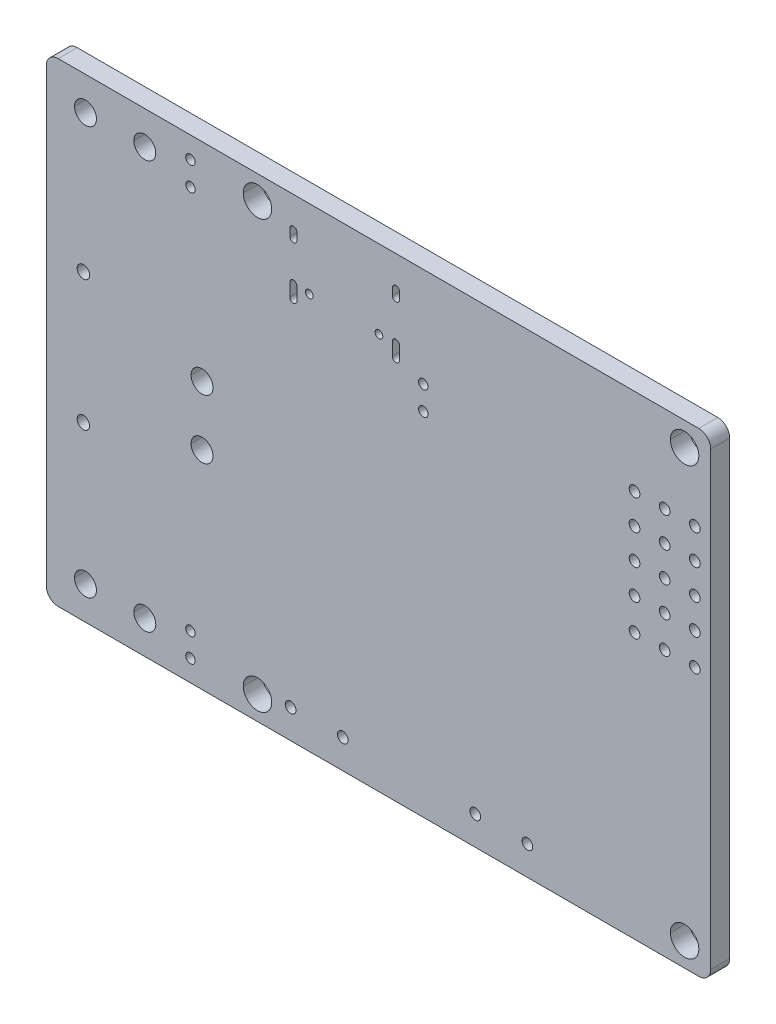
ISO-10303-21;
HEADER;
FILE_DESCRIPTION(('STEP AP214'),'2;1');
FILE_NAME('part.step','',(''),(''),'','','');
FILE_SCHEMA(('AUTOMOTIVE_DESIGN { 1 0 10303 214 1 1 1 1 }'));
ENDSEC;
DATA;
#1=APPLICATION_CONTEXT('core data for automotive mechanical design processes');
#2=APPLICATION_PROTOCOL_DEFINITION('international standard','automotive_design',2000,#1);
#3=PRODUCT_CONTEXT('',#1,'mechanical');
#4=PRODUCT('Part','Part','',(#3));
#5=PRODUCT_RELATED_PRODUCT_CATEGORY('part','',(#4));
#6=PRODUCT_DEFINITION_FORMATION('','',#4);
#7=PRODUCT_DEFINITION_CONTEXT('part definition',#1,'design');
#8=PRODUCT_DEFINITION('design','',#6,#7);
#9=PRODUCT_DEFINITION_SHAPE('','',#8);
#10=(LENGTH_UNIT() NAMED_UNIT(*) SI_UNIT(.MILLI.,.METRE.));
#11=(NAMED_UNIT(*) PLANE_ANGLE_UNIT() SI_UNIT($,.RADIAN.));
#12=(NAMED_UNIT(*) SI_UNIT($,.STERADIAN.) SOLID_ANGLE_UNIT());
#13=UNCERTAINTY_MEASURE_WITH_UNIT(LENGTH_MEASURE(1.E-05),#10,'distance_accuracy_value','');
#14=(GEOMETRIC_REPRESENTATION_CONTEXT(3) GLOBAL_UNCERTAINTY_ASSIGNED_CONTEXT((#13)) GLOBAL_UNIT_ASSIGNED_CONTEXT((#10,
#11,#12)) REPRESENTATION_CONTEXT('',''));
#15=CARTESIAN_POINT('',(0.,0.,0.));
#16=DIRECTION('',(0.,0.,1.));
#17=DIRECTION('',(1.,0.,0.));
#18=AXIS2_PLACEMENT_3D('',#15,#16,#17);
#19=CARTESIAN_POINT('',(1.000363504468,-18.99963649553,0.));
#20=DIRECTION('',(0.,0.,-1.));
#21=DIRECTION('',(0.707106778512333,0.707106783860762,0.));
#22=AXIS2_PLACEMENT_3D('',#19,#20,#21);
#23=CYLINDRICAL_SURFACE('',#22,1.000363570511);
#24=CARTESIAN_POINT('',(1.000363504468,-18.99963649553,0.));
#25=DIRECTION('',(0.,0.,1.));
#26=DIRECTION('',(-0.999999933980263,-0.000363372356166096,0.));
#27=AXIS2_PLACEMENT_3D('',#24,#25,#26);
#28=CIRCLE('',#27,1.000363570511);
#29=CARTESIAN_POINT('',(0.,-19.,0.));
#30=VERTEX_POINT('',#29);
#31=CARTESIAN_POINT('',(1.,-20.,0.));
#32=VERTEX_POINT('',#31);
#33=EDGE_CURVE('E10',#30,#32,#28,.T.);
#34=ORIENTED_EDGE('',*,*,#33,.T.);
#35=DIRECTION('',(0.,0.,1.));
#36=VECTOR('',#35,1.);
#37=CARTESIAN_POINT('',(1.,-20.,0.));
#38=LINE('',#37,#36);
#39=CARTESIAN_POINT('',(1.,-20.,1.60001458));
#40=VERTEX_POINT('',#39);
#41=EDGE_CURVE('E24',#32,#40,#38,.T.);
#42=ORIENTED_EDGE('',*,*,#41,.T.);
#43=CARTESIAN_POINT('',(1.000363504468,-18.99963649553,1.60001458));
#44=DIRECTION('',(0.,0.,1.));
#45=DIRECTION('',(-0.999999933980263,-0.000363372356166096,0.));
#46=AXIS2_PLACEMENT_3D('',#43,#44,#45);
#47=CIRCLE('',#46,1.000363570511);
#48=CARTESIAN_POINT('',(0.,-19.,1.60001458));
#49=VERTEX_POINT('',#48);
#50=EDGE_CURVE('E1626',#49,#40,#47,.T.);
#51=ORIENTED_EDGE('',*,*,#50,.F.);
#52=DIRECTION('',(0.,0.,1.));
#53=VECTOR('',#52,1.);
#54=CARTESIAN_POINT('',(0.,-19.,0.));
#55=LINE('',#54,#53);
#56=EDGE_CURVE('E1621',#30,#49,#55,.T.);
#57=ORIENTED_EDGE('',*,*,#56,.F.);
#58=EDGE_LOOP('',(#34,#42,#51,#57));
#59=FACE_BOUND('',#58,.T.);
#60=ADVANCED_FACE('F16',(#59),#23,.T.);
#61=CARTESIAN_POINT('',(0.,19.,0.));
#62=DIRECTION('',(1.,0.,0.));
#63=DIRECTION('',(0.,-1.,0.));
#64=AXIS2_PLACEMENT_3D('',#61,#62,#63);
#65=PLANE('',#64);
#66=DIRECTION('',(0.,-1.,0.));
#67=VECTOR('',#66,1.);
#68=CARTESIAN_POINT('',(0.,19.,0.));
#69=LINE('',#68,#67);
#70=CARTESIAN_POINT('',(0.,19.,0.));
#71=VERTEX_POINT('',#70);
#72=EDGE_CURVE('E1616',#71,#30,#69,.T.);
#73=ORIENTED_EDGE('',*,*,#72,.T.);
#74=ORIENTED_EDGE('',*,*,#56,.T.);
#75=DIRECTION('',(0.,-1.,0.));
#76=VECTOR('',#75,1.);
#77=CARTESIAN_POINT('',(0.,19.,1.60001458));
#78=LINE('',#77,#76);
#79=CARTESIAN_POINT('',(0.,19.,1.60001458));
#80=VERTEX_POINT('',#79);
#81=EDGE_CURVE('E1611',#80,#49,#78,.T.);
#82=ORIENTED_EDGE('',*,*,#81,.F.);
#83=DIRECTION('',(0.,0.,1.));
#84=VECTOR('',#83,1.);
#85=CARTESIAN_POINT('',(0.,19.,0.));
#86=LINE('',#85,#84);
#87=EDGE_CURVE('E1606',#71,#80,#86,.T.);
#88=ORIENTED_EDGE('',*,*,#87,.F.);
#89=EDGE_LOOP('',(#73,#74,#82,#88));
#90=FACE_BOUND('',#89,.T.);
#91=ADVANCED_FACE('F1640',(#90),#65,.F.);
#92=CARTESIAN_POINT('',(1.000363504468,18.999636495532,0.));
#93=DIRECTION('',(0.,0.,-1.));
#94=DIRECTION('',(0.707106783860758,-0.707106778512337,0.));
#95=AXIS2_PLACEMENT_3D('',#92,#93,#94);
#96=CYLINDRICAL_SURFACE('',#95,1.000363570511);
#97=CARTESIAN_POINT('',(1.000363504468,18.999636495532,0.));
#98=DIRECTION('',(0.,0.,1.));
#99=DIRECTION('',(-0.000363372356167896,0.999999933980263,0.));
#100=AXIS2_PLACEMENT_3D('',#97,#98,#99);
#101=CIRCLE('',#100,1.000363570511);
#102=CARTESIAN_POINT('',(1.,20.,0.));
#103=VERTEX_POINT('',#102);
#104=EDGE_CURVE('E1601',#103,#71,#101,.T.);
#105=ORIENTED_EDGE('',*,*,#104,.T.);
#106=ORIENTED_EDGE('',*,*,#87,.T.);
#107=CARTESIAN_POINT('',(1.000363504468,18.999636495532,1.60001458));
#108=DIRECTION('',(0.,0.,1.));
#109=DIRECTION('',(-0.000363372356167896,0.999999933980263,0.));
#110=AXIS2_PLACEMENT_3D('',#107,#108,#109);
#111=CIRCLE('',#110,1.000363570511);
#112=CARTESIAN_POINT('',(1.,20.,1.60001458));
#113=VERTEX_POINT('',#112);
#114=EDGE_CURVE('E1596',#113,#80,#111,.T.);
#115=ORIENTED_EDGE('',*,*,#114,.F.);
#116=DIRECTION('',(0.,0.,1.));
#117=VECTOR('',#116,1.);
#118=CARTESIAN_POINT('',(1.,20.,0.));
#119=LINE('',#118,#117);
#120=EDGE_CURVE('E1591',#103,#113,#119,.T.);
#121=ORIENTED_EDGE('',*,*,#120,.F.);
#122=EDGE_LOOP('',(#105,#106,#115,#121));
#123=FACE_BOUND('',#122,.T.);
#124=ADVANCED_FACE('F1659',(#123),#96,.T.);
#125=CARTESIAN_POINT('',(55.,20.,0.));
#126=DIRECTION('',(0.,-1.,0.));
#127=DIRECTION('',(-1.,0.,0.));
#128=AXIS2_PLACEMENT_3D('',#125,#126,#127);
#129=PLANE('',#128);
#130=DIRECTION('',(-1.,0.,0.));
#131=VECTOR('',#130,1.);
#132=CARTESIAN_POINT('',(55.,20.,0.));
#133=LINE('',#132,#131);
#134=CARTESIAN_POINT('',(55.,20.,0.));
#135=VERTEX_POINT('',#134);
#136=EDGE_CURVE('E1586',#135,#103,#133,.T.);
#137=ORIENTED_EDGE('',*,*,#136,.T.);
#138=ORIENTED_EDGE('',*,*,#120,.T.);
#139=DIRECTION('',(-1.,0.,0.));
#140=VECTOR('',#139,1.);
#141=CARTESIAN_POINT('',(55.,20.,1.60001458));
#142=LINE('',#141,#140);
#143=CARTESIAN_POINT('',(55.,20.,1.60001458));
#144=VERTEX_POINT('',#143);
#145=EDGE_CURVE('E1581',#144,#113,#142,.T.);
#146=ORIENTED_EDGE('',*,*,#145,.F.);
#147=DIRECTION('',(0.,0.,1.));
#148=VECTOR('',#147,1.);
#149=CARTESIAN_POINT('',(55.,20.,0.));
#150=LINE('',#149,#148);
#151=EDGE_CURVE('E1576',#135,#144,#150,.T.);
#152=ORIENTED_EDGE('',*,*,#151,.F.);
#153=EDGE_LOOP('',(#137,#138,#146,#152));
#154=FACE_BOUND('',#153,.T.);
#155=ADVANCED_FACE('F1657',(#154),#129,.F.);
#156=CARTESIAN_POINT('',(54.99963776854,18.99963776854,0.));
#157=DIRECTION('',(0.,0.,-1.));
#158=DIRECTION('',(-0.707106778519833,-0.707106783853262,0.));
#159=AXIS2_PLACEMENT_3D('',#156,#157,#158);
#160=CYLINDRICAL_SURFACE('',#159,1.000362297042);
#161=CARTESIAN_POINT('',(54.99963776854,18.99963776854,0.));
#162=DIRECTION('',(0.,0.,1.));
#163=DIRECTION('',(0.999999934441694,0.000362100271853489,0.));
#164=AXIS2_PLACEMENT_3D('',#161,#162,#163);
#165=CIRCLE('',#164,1.000362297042);
#166=CARTESIAN_POINT('',(56.,19.,0.));
#167=VERTEX_POINT('',#166);
#168=EDGE_CURVE('E1571',#167,#135,#165,.T.);
#169=ORIENTED_EDGE('',*,*,#168,.T.);
#170=ORIENTED_EDGE('',*,*,#151,.T.);
#171=CARTESIAN_POINT('',(54.99963776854,18.99963776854,1.60001458));
#172=DIRECTION('',(0.,0.,1.));
#173=DIRECTION('',(0.999999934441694,0.000362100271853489,0.));
#174=AXIS2_PLACEMENT_3D('',#171,#172,#173);
#175=CIRCLE('',#174,1.000362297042);
#176=CARTESIAN_POINT('',(56.,19.,1.60001458));
#177=VERTEX_POINT('',#176);
#178=EDGE_CURVE('E1566',#177,#144,#175,.T.);
#179=ORIENTED_EDGE('',*,*,#178,.F.);
#180=DIRECTION('',(0.,0.,1.));
#181=VECTOR('',#180,1.);
#182=CARTESIAN_POINT('',(56.,19.,0.));
#183=LINE('',#182,#181);
#184=EDGE_CURVE('E1561',#167,#177,#183,.T.);
#185=ORIENTED_EDGE('',*,*,#184,.F.);
#186=EDGE_LOOP('',(#169,#170,#179,#185));
#187=FACE_BOUND('',#186,.T.);
#188=ADVANCED_FACE('F1654',(#187),#160,.T.);
#189=CARTESIAN_POINT('',(56.,-19.,0.));
#190=DIRECTION('',(-1.,0.,0.));
#191=DIRECTION('',(0.,1.,0.));
#192=AXIS2_PLACEMENT_3D('',#189,#190,#191);
#193=PLANE('',#192);
#194=DIRECTION('',(0.,1.,0.));
#195=VECTOR('',#194,1.);
#196=CARTESIAN_POINT('',(56.,-19.,0.));
#197=LINE('',#196,#195);
#198=CARTESIAN_POINT('',(56.,-19.,0.));
#199=VERTEX_POINT('',#198);
#200=EDGE_CURVE('E1556',#199,#167,#197,.T.);
#201=ORIENTED_EDGE('',*,*,#200,.T.);
#202=ORIENTED_EDGE('',*,*,#184,.T.);
#203=DIRECTION('',(0.,1.,0.));
#204=VECTOR('',#203,1.);
#205=CARTESIAN_POINT('',(56.,-19.,1.60001458));
#206=LINE('',#205,#204);
#207=CARTESIAN_POINT('',(56.,-19.,1.60001458));
#208=VERTEX_POINT('',#207);
#209=EDGE_CURVE('E1551',#208,#177,#206,.T.);
#210=ORIENTED_EDGE('',*,*,#209,.F.);
#211=DIRECTION('',(0.,0.,1.));
#212=VECTOR('',#211,1.);
#213=CARTESIAN_POINT('',(56.,-19.,0.));
#214=LINE('',#213,#212);
#215=EDGE_CURVE('E1546',#199,#208,#214,.T.);
#216=ORIENTED_EDGE('',*,*,#215,.F.);
#217=EDGE_LOOP('',(#201,#202,#210,#216));
#218=FACE_BOUND('',#217,.T.);
#219=ADVANCED_FACE('F1651',(#218),#193,.F.);
#220=CARTESIAN_POINT('',(54.99963776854,-18.99963776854,0.));
#221=DIRECTION('',(0.,0.,-1.));
#222=DIRECTION('',(-0.707106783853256,0.707106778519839,0.));
#223=AXIS2_PLACEMENT_3D('',#220,#221,#222);
#224=CYLINDRICAL_SURFACE('',#223,1.000362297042);
#225=CARTESIAN_POINT('',(54.99963776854,-18.99963776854,0.));
#226=DIRECTION('',(0.,0.,1.));
#227=DIRECTION('',(0.000362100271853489,-0.999999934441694,0.));
#228=AXIS2_PLACEMENT_3D('',#225,#226,#227);
#229=CIRCLE('',#228,1.000362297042);
#230=CARTESIAN_POINT('',(55.,-20.,0.));
#231=VERTEX_POINT('',#230);
#232=EDGE_CURVE('E1541',#231,#199,#229,.T.);
#233=ORIENTED_EDGE('',*,*,#232,.T.);
#234=ORIENTED_EDGE('',*,*,#215,.T.);
#235=CARTESIAN_POINT('',(54.99963776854,-18.99963776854,1.60001458));
#236=DIRECTION('',(0.,0.,1.));
#237=DIRECTION('',(0.000362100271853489,-0.999999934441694,0.));
#238=AXIS2_PLACEMENT_3D('',#235,#236,#237);
#239=CIRCLE('',#238,1.000362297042);
#240=CARTESIAN_POINT('',(55.,-20.,1.60001458));
#241=VERTEX_POINT('',#240);
#242=EDGE_CURVE('E1536',#241,#208,#239,.T.);
#243=ORIENTED_EDGE('',*,*,#242,.F.);
#244=DIRECTION('',(0.,0.,1.));
#245=VECTOR('',#244,1.);
#246=CARTESIAN_POINT('',(55.,-20.,0.));
#247=LINE('',#246,#245);
#248=EDGE_CURVE('E1531',#231,#241,#247,.T.);
#249=ORIENTED_EDGE('',*,*,#248,.F.);
#250=EDGE_LOOP('',(#233,#234,#243,#249));
#251=FACE_BOUND('',#250,.T.);
#252=ADVANCED_FACE('F1649',(#251),#224,.T.);
#253=CARTESIAN_POINT('',(1.,-20.,0.));
#254=DIRECTION('',(0.,1.,0.));
#255=DIRECTION('',(1.,0.,0.));
#256=AXIS2_PLACEMENT_3D('',#253,#254,#255);
#257=PLANE('',#256);
#258=DIRECTION('',(1.,0.,0.));
#259=VECTOR('',#258,1.);
#260=CARTESIAN_POINT('',(1.,-20.,0.));
#261=LINE('',#260,#259);
#262=EDGE_CURVE('E1526',#32,#231,#261,.T.);
#263=ORIENTED_EDGE('',*,*,#262,.T.);
#264=ORIENTED_EDGE('',*,*,#248,.T.);
#265=DIRECTION('',(1.,0.,0.));
#266=VECTOR('',#265,1.);
#267=CARTESIAN_POINT('',(1.,-20.,1.60001458));
#268=LINE('',#267,#266);
#269=EDGE_CURVE('E1521',#40,#241,#268,.T.);
#270=ORIENTED_EDGE('',*,*,#269,.F.);
#271=ORIENTED_EDGE('',*,*,#41,.F.);
#272=EDGE_LOOP('',(#263,#264,#270,#271));
#273=FACE_BOUND('',#272,.T.);
#274=ADVANCED_FACE('F1647',(#273),#257,.F.);
#275=CARTESIAN_POINT('',(28.000000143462,0.,1.60001458));
#276=DIRECTION('',(0.,0.,1.));
#277=DIRECTION('',(1.,0.,0.));
#278=AXIS2_PLACEMENT_3D('',#275,#276,#277);
#279=PLANE('',#278);
#280=ORIENTED_EDGE('',*,*,#50,.T.);
#281=ORIENTED_EDGE('',*,*,#269,.T.);
#282=ORIENTED_EDGE('',*,*,#242,.T.);
#283=ORIENTED_EDGE('',*,*,#209,.T.);
#284=ORIENTED_EDGE('',*,*,#178,.T.);
#285=ORIENTED_EDGE('',*,*,#145,.T.);
#286=ORIENTED_EDGE('',*,*,#114,.T.);
#287=ORIENTED_EDGE('',*,*,#81,.T.);
#288=EDGE_LOOP('',(#280,#281,#282,#283,#284,#285,#286,#287));
#289=FACE_BOUND('',#288,.T.);
#290=CARTESIAN_POINT('',(3.3,-17.2,1.60001458));
#291=DIRECTION('',(0.,0.,1.));
#292=DIRECTION('',(1.,0.,0.));
#293=AXIS2_PLACEMENT_3D('',#290,#291,#292);
#294=CIRCLE('',#293,0.925);
#295=CARTESIAN_POINT('',(2.375,-17.2,1.60001458));
#296=VERTEX_POINT('',#295);
#297=CARTESIAN_POINT('',(4.225,-17.2,1.60001458));
#298=VERTEX_POINT('',#297);
#299=EDGE_CURVE('E1516',#296,#298,#294,.T.);
#300=ORIENTED_EDGE('',*,*,#299,.F.);
#301=CARTESIAN_POINT('',(3.3,-17.2,1.60001458));
#302=DIRECTION('',(0.,0.,1.));
#303=DIRECTION('',(1.,0.,0.));
#304=AXIS2_PLACEMENT_3D('',#301,#302,#303);
#305=CIRCLE('',#304,0.925);
#306=EDGE_CURVE('E1511',#298,#296,#305,.T.);
#307=ORIENTED_EDGE('',*,*,#306,.F.);
#308=EDGE_LOOP('',(#300,#307));
#309=FACE_BOUND('',#308,.T.);
#310=CARTESIAN_POINT('',(12.15,-18.2,1.60001458));
#311=DIRECTION('',(0.,0.,1.));
#312=DIRECTION('',(1.,0.,0.));
#313=AXIS2_PLACEMENT_3D('',#310,#311,#312);
#314=CIRCLE('',#313,0.4);
#315=CARTESIAN_POINT('',(11.75,-18.2,1.60001458));
#316=VERTEX_POINT('',#315);
#317=CARTESIAN_POINT('',(12.55,-18.2,1.60001458));
#318=VERTEX_POINT('',#317);
#319=EDGE_CURVE('E1506',#316,#318,#314,.T.);
#320=ORIENTED_EDGE('',*,*,#319,.F.);
#321=CARTESIAN_POINT('',(12.15,-18.2,1.60001458));
#322=DIRECTION('',(0.,0.,1.));
#323=DIRECTION('',(1.,0.,0.));
#324=AXIS2_PLACEMENT_3D('',#321,#322,#323);
#325=CIRCLE('',#324,0.4);
#326=EDGE_CURVE('E1501',#318,#316,#325,.T.);
#327=ORIENTED_EDGE('',*,*,#326,.F.);
#328=EDGE_LOOP('',(#320,#327));
#329=FACE_BOUND('',#328,.T.);
#330=CARTESIAN_POINT('',(3.124,-5.5,1.60001458));
#331=DIRECTION('',(0.,0.,1.));
#332=DIRECTION('',(1.,0.,0.));
#333=AXIS2_PLACEMENT_3D('',#330,#331,#332);
#334=CIRCLE('',#333,0.525);
#335=CARTESIAN_POINT('',(2.599,-5.5,1.60001458));
#336=VERTEX_POINT('',#335);
#337=CARTESIAN_POINT('',(3.649,-5.5,1.60001458));
#338=VERTEX_POINT('',#337);
#339=EDGE_CURVE('E1496',#336,#338,#334,.T.);
#340=ORIENTED_EDGE('',*,*,#339,.F.);
#341=CARTESIAN_POINT('',(3.124,-5.5,1.60001458));
#342=DIRECTION('',(0.,0.,1.));
#343=DIRECTION('',(1.,0.,0.));
#344=AXIS2_PLACEMENT_3D('',#341,#342,#343);
#345=CIRCLE('',#344,0.525);
#346=EDGE_CURVE('E1491',#338,#336,#345,.T.);
#347=ORIENTED_EDGE('',*,*,#346,.F.);
#348=EDGE_LOOP('',(#340,#347));
#349=FACE_BOUND('',#348,.T.);
#350=CARTESIAN_POINT('',(8.3,-17.2,1.60001458));
#351=DIRECTION('',(0.,0.,1.));
#352=DIRECTION('',(1.,0.,0.));
#353=AXIS2_PLACEMENT_3D('',#350,#351,#352);
#354=CIRCLE('',#353,0.925);
#355=CARTESIAN_POINT('',(7.375,-17.2,1.60001458));
#356=VERTEX_POINT('',#355);
#357=CARTESIAN_POINT('',(9.225,-17.2,1.60001458));
#358=VERTEX_POINT('',#357);
#359=EDGE_CURVE('E1486',#356,#358,#354,.T.);
#360=ORIENTED_EDGE('',*,*,#359,.F.);
#361=CARTESIAN_POINT('',(8.3,-17.2,1.60001458));
#362=DIRECTION('',(0.,0.,1.));
#363=DIRECTION('',(1.,0.,0.));
#364=AXIS2_PLACEMENT_3D('',#361,#362,#363);
#365=CIRCLE('',#364,0.925);
#366=EDGE_CURVE('E1481',#358,#356,#365,.T.);
#367=ORIENTED_EDGE('',*,*,#366,.F.);
#368=EDGE_LOOP('',(#360,#367));
#369=FACE_BOUND('',#368,.T.);
#370=CARTESIAN_POINT('',(12.15,-16.2,1.60001458));
#371=DIRECTION('',(0.,0.,1.));
#372=DIRECTION('',(1.,0.,0.));
#373=AXIS2_PLACEMENT_3D('',#370,#371,#372);
#374=CIRCLE('',#373,0.4);
#375=CARTESIAN_POINT('',(11.75,-16.2,1.60001458));
#376=VERTEX_POINT('',#375);
#377=CARTESIAN_POINT('',(12.55,-16.2,1.60001458));
#378=VERTEX_POINT('',#377);
#379=EDGE_CURVE('E1476',#376,#378,#374,.T.);
#380=ORIENTED_EDGE('',*,*,#379,.F.);
#381=CARTESIAN_POINT('',(12.15,-16.2,1.60001458));
#382=DIRECTION('',(0.,0.,1.));
#383=DIRECTION('',(1.,0.,0.));
#384=AXIS2_PLACEMENT_3D('',#381,#382,#383);
#385=CIRCLE('',#384,0.4);
#386=EDGE_CURVE('E1471',#378,#376,#385,.T.);
#387=ORIENTED_EDGE('',*,*,#386,.F.);
#388=EDGE_LOOP('',(#380,#387));
#389=FACE_BOUND('',#388,.T.);
#390=CARTESIAN_POINT('',(20.588,-17.561,1.60001458));
#391=DIRECTION('',(0.,0.,1.));
#392=DIRECTION('',(1.,0.,0.));
#393=AXIS2_PLACEMENT_3D('',#390,#391,#392);
#394=CIRCLE('',#393,0.45);
#395=CARTESIAN_POINT('',(20.138,-17.561,1.60001458));
#396=VERTEX_POINT('',#395);
#397=CARTESIAN_POINT('',(21.038,-17.561,1.60001458));
#398=VERTEX_POINT('',#397);
#399=EDGE_CURVE('E1466',#396,#398,#394,.T.);
#400=ORIENTED_EDGE('',*,*,#399,.F.);
#401=CARTESIAN_POINT('',(20.588,-17.561,1.60001458));
#402=DIRECTION('',(0.,0.,1.));
#403=DIRECTION('',(1.,0.,0.));
#404=AXIS2_PLACEMENT_3D('',#401,#402,#403);
#405=CIRCLE('',#404,0.45);
#406=EDGE_CURVE('E1461',#398,#396,#405,.T.);
#407=ORIENTED_EDGE('',*,*,#406,.F.);
#408=EDGE_LOOP('',(#400,#407));
#409=FACE_BOUND('',#408,.T.);
#410=CARTESIAN_POINT('',(24.982,-17.551,1.60001458));
#411=DIRECTION('',(0.,0.,1.));
#412=DIRECTION('',(1.,0.,0.));
#413=AXIS2_PLACEMENT_3D('',#410,#411,#412);
#414=CIRCLE('',#413,0.45);
#415=CARTESIAN_POINT('',(24.532,-17.551,1.60001458));
#416=VERTEX_POINT('',#415);
#417=CARTESIAN_POINT('',(25.432,-17.551,1.60001458));
#418=VERTEX_POINT('',#417);
#419=EDGE_CURVE('E1456',#416,#418,#414,.T.);
#420=ORIENTED_EDGE('',*,*,#419,.F.);
#421=CARTESIAN_POINT('',(24.982,-17.551,1.60001458));
#422=DIRECTION('',(0.,0.,1.));
#423=DIRECTION('',(1.,0.,0.));
#424=AXIS2_PLACEMENT_3D('',#421,#422,#423);
#425=CIRCLE('',#424,0.45);
#426=EDGE_CURVE('E1451',#418,#416,#425,.T.);
#427=ORIENTED_EDGE('',*,*,#426,.F.);
#428=EDGE_LOOP('',(#420,#427));
#429=FACE_BOUND('',#428,.T.);
#430=CARTESIAN_POINT('',(13.124,2.5,1.60001458));
#431=DIRECTION('',(0.,0.,1.));
#432=DIRECTION('',(1.,0.,0.));
#433=AXIS2_PLACEMENT_3D('',#430,#431,#432);
#434=CIRCLE('',#433,0.925);
#435=CARTESIAN_POINT('',(12.199,2.5,1.60001458));
#436=VERTEX_POINT('',#435);
#437=CARTESIAN_POINT('',(14.049,2.5,1.60001458));
#438=VERTEX_POINT('',#437);
#439=EDGE_CURVE('E1446',#436,#438,#434,.T.);
#440=ORIENTED_EDGE('',*,*,#439,.F.);
#441=CARTESIAN_POINT('',(13.124,2.5,1.60001458));
#442=DIRECTION('',(0.,0.,1.));
#443=DIRECTION('',(1.,0.,0.));
#444=AXIS2_PLACEMENT_3D('',#441,#442,#443);
#445=CIRCLE('',#444,0.925);
#446=EDGE_CURVE('E1441',#438,#436,#445,.T.);
#447=ORIENTED_EDGE('',*,*,#446,.F.);
#448=EDGE_LOOP('',(#440,#447));
#449=FACE_BOUND('',#448,.T.);
#450=CARTESIAN_POINT('',(17.8,-18.,1.60001458));
#451=DIRECTION('',(0.,0.,1.));
#452=DIRECTION('',(1.,0.,0.));
#453=AXIS2_PLACEMENT_3D('',#450,#451,#452);
#454=CIRCLE('',#453,1.2);
#455=CARTESIAN_POINT('',(16.6,-18.,1.60001458));
#456=VERTEX_POINT('',#455);
#457=CARTESIAN_POINT('',(19.,-18.,1.60001458));
#458=VERTEX_POINT('',#457);
#459=EDGE_CURVE('E1436',#456,#458,#454,.T.);
#460=ORIENTED_EDGE('',*,*,#459,.F.);
#461=CARTESIAN_POINT('',(17.8,-18.,1.60001458));
#462=DIRECTION('',(0.,0.,1.));
#463=DIRECTION('',(1.,0.,0.));
#464=AXIS2_PLACEMENT_3D('',#461,#462,#463);
#465=CIRCLE('',#464,1.2);
#466=EDGE_CURVE('E1431',#458,#456,#465,.T.);
#467=ORIENTED_EDGE('',*,*,#466,.F.);
#468=EDGE_LOOP('',(#460,#467));
#469=FACE_BOUND('',#468,.T.);
#470=CARTESIAN_POINT('',(13.124,-2.5,1.60001458));
#471=DIRECTION('',(0.,0.,1.));
#472=DIRECTION('',(1.,0.,0.));
#473=AXIS2_PLACEMENT_3D('',#470,#471,#472);
#474=CIRCLE('',#473,0.925);
#475=CARTESIAN_POINT('',(12.199,-2.5,1.60001458));
#476=VERTEX_POINT('',#475);
#477=CARTESIAN_POINT('',(14.049,-2.5,1.60001458));
#478=VERTEX_POINT('',#477);
#479=EDGE_CURVE('E1426',#476,#478,#474,.T.);
#480=ORIENTED_EDGE('',*,*,#479,.F.);
#481=CARTESIAN_POINT('',(13.124,-2.5,1.60001458));
#482=DIRECTION('',(0.,0.,1.));
#483=DIRECTION('',(1.,0.,0.));
#484=AXIS2_PLACEMENT_3D('',#481,#482,#483);
#485=CIRCLE('',#484,0.925);
#486=EDGE_CURVE('E1421',#478,#476,#485,.T.);
#487=ORIENTED_EDGE('',*,*,#486,.F.);
#488=EDGE_LOOP('',(#480,#487));
#489=FACE_BOUND('',#488,.T.);
#490=CARTESIAN_POINT('',(3.124,5.5,1.60001458));
#491=DIRECTION('',(0.,0.,1.));
#492=DIRECTION('',(1.,0.,0.));
#493=AXIS2_PLACEMENT_3D('',#490,#491,#492);
#494=CIRCLE('',#493,0.525);
#495=CARTESIAN_POINT('',(2.599,5.5,1.60001458));
#496=VERTEX_POINT('',#495);
#497=CARTESIAN_POINT('',(3.649,5.5,1.60001458));
#498=VERTEX_POINT('',#497);
#499=EDGE_CURVE('E1416',#496,#498,#494,.T.);
#500=ORIENTED_EDGE('',*,*,#499,.F.);
#501=CARTESIAN_POINT('',(3.124,5.5,1.60001458));
#502=DIRECTION('',(0.,0.,1.));
#503=DIRECTION('',(1.,0.,0.));
#504=AXIS2_PLACEMENT_3D('',#501,#502,#503);
#505=CIRCLE('',#504,0.525);
#506=EDGE_CURVE('E1411',#498,#496,#505,.T.);
#507=ORIENTED_EDGE('',*,*,#506,.F.);
#508=EDGE_LOOP('',(#500,#507));
#509=FACE_BOUND('',#508,.T.);
#510=CARTESIAN_POINT('',(12.15,16.2,1.60001458));
#511=DIRECTION('',(0.,0.,1.));
#512=DIRECTION('',(1.,0.,0.));
#513=AXIS2_PLACEMENT_3D('',#510,#511,#512);
#514=CIRCLE('',#513,0.4);
#515=CARTESIAN_POINT('',(11.75,16.2,1.60001458));
#516=VERTEX_POINT('',#515);
#517=CARTESIAN_POINT('',(12.55,16.2,1.60001458));
#518=VERTEX_POINT('',#517);
#519=EDGE_CURVE('E1406',#516,#518,#514,.T.);
#520=ORIENTED_EDGE('',*,*,#519,.F.);
#521=CARTESIAN_POINT('',(12.15,16.2,1.60001458));
#522=DIRECTION('',(0.,0.,1.));
#523=DIRECTION('',(1.,0.,0.));
#524=AXIS2_PLACEMENT_3D('',#521,#522,#523);
#525=CIRCLE('',#524,0.4);
#526=EDGE_CURVE('E1401',#518,#516,#525,.T.);
#527=ORIENTED_EDGE('',*,*,#526,.F.);
#528=EDGE_LOOP('',(#520,#527));
#529=FACE_BOUND('',#528,.T.);
#530=CARTESIAN_POINT('',(3.3,17.2,1.60001458));
#531=DIRECTION('',(0.,0.,1.));
#532=DIRECTION('',(1.,0.,0.));
#533=AXIS2_PLACEMENT_3D('',#530,#531,#532);
#534=CIRCLE('',#533,0.925);
#535=CARTESIAN_POINT('',(2.375,17.2,1.60001458));
#536=VERTEX_POINT('',#535);
#537=CARTESIAN_POINT('',(4.225,17.2,1.60001458));
#538=VERTEX_POINT('',#537);
#539=EDGE_CURVE('E1396',#536,#538,#534,.T.);
#540=ORIENTED_EDGE('',*,*,#539,.F.);
#541=CARTESIAN_POINT('',(3.3,17.2,1.60001458));
#542=DIRECTION('',(0.,0.,1.));
#543=DIRECTION('',(1.,0.,0.));
#544=AXIS2_PLACEMENT_3D('',#541,#542,#543);
#545=CIRCLE('',#544,0.925);
#546=EDGE_CURVE('E1391',#538,#536,#545,.T.);
#547=ORIENTED_EDGE('',*,*,#546,.F.);
#548=EDGE_LOOP('',(#540,#547));
#549=FACE_BOUND('',#548,.T.);
#550=CARTESIAN_POINT('',(8.3,17.2,1.60001458));
#551=DIRECTION('',(0.,0.,1.));
#552=DIRECTION('',(1.,0.,0.));
#553=AXIS2_PLACEMENT_3D('',#550,#551,#552);
#554=CIRCLE('',#553,0.925);
#555=CARTESIAN_POINT('',(7.375,17.2,1.60001458));
#556=VERTEX_POINT('',#555);
#557=CARTESIAN_POINT('',(9.225,17.2,1.60001458));
#558=VERTEX_POINT('',#557);
#559=EDGE_CURVE('E1386',#556,#558,#554,.T.);
#560=ORIENTED_EDGE('',*,*,#559,.F.);
#561=CARTESIAN_POINT('',(8.3,17.2,1.60001458));
#562=DIRECTION('',(0.,0.,1.));
#563=DIRECTION('',(1.,0.,0.));
#564=AXIS2_PLACEMENT_3D('',#561,#562,#563);
#565=CIRCLE('',#564,0.925);
#566=EDGE_CURVE('E1381',#558,#556,#565,.T.);
#567=ORIENTED_EDGE('',*,*,#566,.F.);
#568=EDGE_LOOP('',(#560,#567));
#569=FACE_BOUND('',#568,.T.);
#570=CARTESIAN_POINT('',(12.15,18.2,1.60001458));
#571=DIRECTION('',(0.,0.,1.));
#572=DIRECTION('',(1.,0.,0.));
#573=AXIS2_PLACEMENT_3D('',#570,#571,#572);
#574=CIRCLE('',#573,0.4);
#575=CARTESIAN_POINT('',(11.75,18.2,1.60001458));
#576=VERTEX_POINT('',#575);
#577=CARTESIAN_POINT('',(12.55,18.2,1.60001458));
#578=VERTEX_POINT('',#577);
#579=EDGE_CURVE('E1376',#576,#578,#574,.T.);
#580=ORIENTED_EDGE('',*,*,#579,.F.);
#581=CARTESIAN_POINT('',(12.15,18.2,1.60001458));
#582=DIRECTION('',(0.,0.,1.));
#583=DIRECTION('',(1.,0.,0.));
#584=AXIS2_PLACEMENT_3D('',#581,#582,#583);
#585=CIRCLE('',#584,0.4);
#586=EDGE_CURVE('E1371',#578,#576,#585,.T.);
#587=ORIENTED_EDGE('',*,*,#586,.F.);
#588=EDGE_LOOP('',(#580,#587));
#589=FACE_BOUND('',#588,.T.);
#590=CARTESIAN_POINT('',(20.82099976,13.44789792,1.60001458));
#591=DIRECTION('',(0.,0.,1.));
#592=DIRECTION('',(1.,0.,0.));
#593=AXIS2_PLACEMENT_3D('',#590,#591,#592);
#594=CIRCLE('',#593,0.2999994);
#595=CARTESIAN_POINT('',(21.12099916,13.44789792,1.60001458));
#596=VERTEX_POINT('',#595);
#597=CARTESIAN_POINT('',(20.52100036,13.44789792,1.60001458));
#598=VERTEX_POINT('',#597);
#599=EDGE_CURVE('E1366',#596,#598,#594,.T.);
#600=ORIENTED_EDGE('',*,*,#599,.F.);
#601=DIRECTION('',(0.,1.,0.));
#602=VECTOR('',#601,1.);
#603=CARTESIAN_POINT('',(21.12099916,12.34790012,1.60001458));
#604=LINE('',#603,#602);
#605=CARTESIAN_POINT('',(21.12099916,12.34790012,1.60001458));
#606=VERTEX_POINT('',#605);
#607=EDGE_CURVE('E1361',#606,#596,#604,.T.);
#608=ORIENTED_EDGE('',*,*,#607,.F.);
#609=CARTESIAN_POINT('',(20.82099976,12.34790012,1.60001458));
#610=DIRECTION('',(0.,0.,1.));
#611=DIRECTION('',(-1.,0.,0.));
#612=AXIS2_PLACEMENT_3D('',#609,#610,#611);
#613=CIRCLE('',#612,0.2999994);
#614=CARTESIAN_POINT('',(20.52100036,12.34790012,1.60001458));
#615=VERTEX_POINT('',#614);
#616=EDGE_CURVE('E1356',#615,#606,#613,.T.);
#617=ORIENTED_EDGE('',*,*,#616,.F.);
#618=DIRECTION('',(0.,-1.,0.));
#619=VECTOR('',#618,1.);
#620=CARTESIAN_POINT('',(20.52100036,13.44789792,1.60001458));
#621=LINE('',#620,#619);
#622=EDGE_CURVE('E1351',#598,#615,#621,.T.);
#623=ORIENTED_EDGE('',*,*,#622,.F.);
#624=EDGE_LOOP('',(#600,#608,#617,#623));
#625=FACE_BOUND('',#624,.T.);
#626=CARTESIAN_POINT('',(28.036,13.398,1.60001458));
#627=DIRECTION('',(0.,0.,1.));
#628=DIRECTION('',(1.,0.,0.));
#629=AXIS2_PLACEMENT_3D('',#626,#627,#628);
#630=CIRCLE('',#629,0.325);
#631=CARTESIAN_POINT('',(27.711,13.398,1.60001458));
#632=VERTEX_POINT('',#631);
#633=CARTESIAN_POINT('',(28.361,13.398,1.60001458));
#634=VERTEX_POINT('',#633);
#635=EDGE_CURVE('E1346',#632,#634,#630,.T.);
#636=ORIENTED_EDGE('',*,*,#635,.F.);
#637=CARTESIAN_POINT('',(28.036,13.398,1.60001458));
#638=DIRECTION('',(0.,0.,1.));
#639=DIRECTION('',(1.,0.,0.));
#640=AXIS2_PLACEMENT_3D('',#637,#638,#639);
#641=CIRCLE('',#640,0.325);
#642=EDGE_CURVE('E1341',#634,#632,#641,.T.);
#643=ORIENTED_EDGE('',*,*,#642,.F.);
#644=EDGE_LOOP('',(#636,#643));
#645=FACE_BOUND('',#644,.T.);
#646=CARTESIAN_POINT('',(22.166,13.398,1.60001458));
#647=DIRECTION('',(0.,0.,1.));
#648=DIRECTION('',(1.,0.,0.));
#649=AXIS2_PLACEMENT_3D('',#646,#647,#648);
#650=CIRCLE('',#649,0.325);
#651=CARTESIAN_POINT('',(21.841,13.398,1.60001458));
#652=VERTEX_POINT('',#651);
#653=CARTESIAN_POINT('',(22.491,13.398,1.60001458));
#654=VERTEX_POINT('',#653);
#655=EDGE_CURVE('E1336',#652,#654,#650,.T.);
#656=ORIENTED_EDGE('',*,*,#655,.F.);
#657=CARTESIAN_POINT('',(22.166,13.398,1.60001458));
#658=DIRECTION('',(0.,0.,1.));
#659=DIRECTION('',(1.,0.,0.));
#660=AXIS2_PLACEMENT_3D('',#657,#658,#659);
#661=CIRCLE('',#660,0.325);
#662=EDGE_CURVE('E1331',#654,#652,#661,.T.);
#663=ORIENTED_EDGE('',*,*,#662,.F.);
#664=EDGE_LOOP('',(#656,#663));
#665=FACE_BOUND('',#664,.T.);
#666=CARTESIAN_POINT('',(17.8,18.,1.60001458));
#667=DIRECTION('',(0.,0.,1.));
#668=DIRECTION('',(1.,0.,0.));
#669=AXIS2_PLACEMENT_3D('',#666,#667,#668);
#670=CIRCLE('',#669,1.2);
#671=CARTESIAN_POINT('',(16.6,18.,1.60001458));
#672=VERTEX_POINT('',#671);
#673=CARTESIAN_POINT('',(19.,18.,1.60001458));
#674=VERTEX_POINT('',#673);
#675=EDGE_CURVE('E1326',#672,#674,#670,.T.);
#676=ORIENTED_EDGE('',*,*,#675,.F.);
#677=CARTESIAN_POINT('',(17.8,18.,1.60001458));
#678=DIRECTION('',(0.,0.,1.));
#679=DIRECTION('',(1.,0.,0.));
#680=AXIS2_PLACEMENT_3D('',#677,#678,#679);
#681=CIRCLE('',#680,1.2);
#682=EDGE_CURVE('E1321',#674,#672,#681,.T.);
#683=ORIENTED_EDGE('',*,*,#682,.F.);
#684=EDGE_LOOP('',(#676,#683));
#685=FACE_BOUND('',#684,.T.);
#686=CARTESIAN_POINT('',(29.47100024,13.44789792,1.60001458));
#687=DIRECTION('',(0.,0.,1.));
#688=DIRECTION('',(1.,0.,0.));
#689=AXIS2_PLACEMENT_3D('',#686,#687,#688);
#690=CIRCLE('',#689,0.2999994);
#691=CARTESIAN_POINT('',(29.77099964,13.44789792,1.60001458));
#692=VERTEX_POINT('',#691);
#693=CARTESIAN_POINT('',(29.17100084,13.44789792,1.60001458));
#694=VERTEX_POINT('',#693);
#695=EDGE_CURVE('E1316',#692,#694,#690,.T.);
#696=ORIENTED_EDGE('',*,*,#695,.F.);
#697=DIRECTION('',(0.,1.,0.));
#698=VECTOR('',#697,1.);
#699=CARTESIAN_POINT('',(29.77099964,12.34790012,1.60001458));
#700=LINE('',#699,#698);
#701=CARTESIAN_POINT('',(29.77099964,12.34790012,1.60001458));
#702=VERTEX_POINT('',#701);
#703=EDGE_CURVE('E1311',#702,#692,#700,.T.);
#704=ORIENTED_EDGE('',*,*,#703,.F.);
#705=CARTESIAN_POINT('',(29.47100024,12.34790012,1.60001458));
#706=DIRECTION('',(0.,0.,1.));
#707=DIRECTION('',(-1.,0.,0.));
#708=AXIS2_PLACEMENT_3D('',#705,#706,#707);
#709=CIRCLE('',#708,0.2999994);
#710=CARTESIAN_POINT('',(29.17100084,12.34790012,1.60001458));
#711=VERTEX_POINT('',#710);
#712=EDGE_CURVE('E1306',#711,#702,#709,.T.);
#713=ORIENTED_EDGE('',*,*,#712,.F.);
#714=DIRECTION('',(0.,-1.,0.));
#715=VECTOR('',#714,1.);
#716=CARTESIAN_POINT('',(29.17100084,13.44789792,1.60001458));
#717=LINE('',#716,#715);
#718=EDGE_CURVE('E1301',#694,#711,#717,.T.);
#719=ORIENTED_EDGE('',*,*,#718,.F.);
#720=EDGE_LOOP('',(#696,#704,#713,#719));
#721=FACE_BOUND('',#720,.T.);
#722=CARTESIAN_POINT('',(20.82099976,17.37789768,1.60001458));
#723=DIRECTION('',(0.,0.,1.));
#724=DIRECTION('',(1.,0.,0.));
#725=AXIS2_PLACEMENT_3D('',#722,#723,#724);
#726=CIRCLE('',#725,0.2999994);
#727=CARTESIAN_POINT('',(21.12099916,17.37789768,1.60001458));
#728=VERTEX_POINT('',#727);
#729=CARTESIAN_POINT('',(20.52100036,17.37789768,1.60001458));
#730=VERTEX_POINT('',#729);
#731=EDGE_CURVE('E1296',#728,#730,#726,.T.);
#732=ORIENTED_EDGE('',*,*,#731,.F.);
#733=DIRECTION('',(0.,1.,0.));
#734=VECTOR('',#733,1.);
#735=CARTESIAN_POINT('',(21.12099916,16.77789888,1.60001458));
#736=LINE('',#735,#734);
#737=CARTESIAN_POINT('',(21.12099916,16.77789888,1.60001458));
#738=VERTEX_POINT('',#737);
#739=EDGE_CURVE('E1291',#738,#728,#736,.T.);
#740=ORIENTED_EDGE('',*,*,#739,.F.);
#741=CARTESIAN_POINT('',(20.82099976,16.77789888,1.60001458));
#742=DIRECTION('',(0.,0.,1.));
#743=DIRECTION('',(-1.,0.,0.));
#744=AXIS2_PLACEMENT_3D('',#741,#742,#743);
#745=CIRCLE('',#744,0.2999994);
#746=CARTESIAN_POINT('',(20.52100036,16.77789888,1.60001458));
#747=VERTEX_POINT('',#746);
#748=EDGE_CURVE('E1286',#747,#738,#745,.T.);
#749=ORIENTED_EDGE('',*,*,#748,.F.);
#750=DIRECTION('',(0.,-1.,0.));
#751=VECTOR('',#750,1.);
#752=CARTESIAN_POINT('',(20.52100036,17.37789768,1.60001458));
#753=LINE('',#752,#751);
#754=EDGE_CURVE('E1281',#730,#747,#753,.T.);
#755=ORIENTED_EDGE('',*,*,#754,.F.);
#756=EDGE_LOOP('',(#732,#740,#749,#755));
#757=FACE_BOUND('',#756,.T.);
#758=CARTESIAN_POINT('',(36.158,-17.561,1.60001458));
#759=DIRECTION('',(0.,0.,1.));
#760=DIRECTION('',(1.,0.,0.));
#761=AXIS2_PLACEMENT_3D('',#758,#759,#760);
#762=CIRCLE('',#761,0.45);
#763=CARTESIAN_POINT('',(35.708,-17.561,1.60001458));
#764=VERTEX_POINT('',#763);
#765=CARTESIAN_POINT('',(36.608,-17.561,1.60001458));
#766=VERTEX_POINT('',#765);
#767=EDGE_CURVE('E1276',#764,#766,#762,.T.);
#768=ORIENTED_EDGE('',*,*,#767,.F.);
#769=CARTESIAN_POINT('',(36.158,-17.561,1.60001458));
#770=DIRECTION('',(0.,0.,1.));
#771=DIRECTION('',(1.,0.,0.));
#772=AXIS2_PLACEMENT_3D('',#769,#770,#771);
#773=CIRCLE('',#772,0.45);
#774=EDGE_CURVE('E1271',#766,#764,#773,.T.);
#775=ORIENTED_EDGE('',*,*,#774,.F.);
#776=EDGE_LOOP('',(#768,#775));
#777=FACE_BOUND('',#776,.T.);
#778=CARTESIAN_POINT('',(40.552,-17.551,1.60001458));
#779=DIRECTION('',(0.,0.,1.));
#780=DIRECTION('',(1.,0.,0.));
#781=AXIS2_PLACEMENT_3D('',#778,#779,#780);
#782=CIRCLE('',#781,0.45);
#783=CARTESIAN_POINT('',(40.102,-17.551,1.60001458));
#784=VERTEX_POINT('',#783);
#785=CARTESIAN_POINT('',(41.002,-17.551,1.60001458));
#786=VERTEX_POINT('',#785);
#787=EDGE_CURVE('E1266',#784,#786,#782,.T.);
#788=ORIENTED_EDGE('',*,*,#787,.F.);
#789=CARTESIAN_POINT('',(40.552,-17.551,1.60001458));
#790=DIRECTION('',(0.,0.,1.));
#791=DIRECTION('',(1.,0.,0.));
#792=AXIS2_PLACEMENT_3D('',#789,#790,#791);
#793=CIRCLE('',#792,0.45);
#794=EDGE_CURVE('E1261',#786,#784,#793,.T.);
#795=ORIENTED_EDGE('',*,*,#794,.F.);
#796=EDGE_LOOP('',(#788,#795));
#797=FACE_BOUND('',#796,.T.);
#798=CARTESIAN_POINT('',(49.581,7.62,1.60001458));
#799=DIRECTION('',(0.,0.,1.));
#800=DIRECTION('',(1.,0.,0.));
#801=AXIS2_PLACEMENT_3D('',#798,#799,#800);
#802=CIRCLE('',#801,0.45);
#803=CARTESIAN_POINT('',(49.131,7.62,1.60001458));
#804=VERTEX_POINT('',#803);
#805=CARTESIAN_POINT('',(50.031,7.62,1.60001458));
#806=VERTEX_POINT('',#805);
#807=EDGE_CURVE('E1256',#804,#806,#802,.T.);
#808=ORIENTED_EDGE('',*,*,#807,.F.);
#809=CARTESIAN_POINT('',(49.581,7.62,1.60001458));
#810=DIRECTION('',(0.,0.,1.));
#811=DIRECTION('',(1.,0.,0.));
#812=AXIS2_PLACEMENT_3D('',#809,#810,#811);
#813=CIRCLE('',#812,0.45);
#814=EDGE_CURVE('E1251',#806,#804,#813,.T.);
#815=ORIENTED_EDGE('',*,*,#814,.F.);
#816=EDGE_LOOP('',(#808,#815));
#817=FACE_BOUND('',#816,.T.);
#818=CARTESIAN_POINT('',(49.581,2.4,1.60001458));
#819=DIRECTION('',(0.,0.,1.));
#820=DIRECTION('',(1.,0.,0.));
#821=AXIS2_PLACEMENT_3D('',#818,#819,#820);
#822=CIRCLE('',#821,0.45);
#823=CARTESIAN_POINT('',(49.131,2.4,1.60001458));
#824=VERTEX_POINT('',#823);
#825=CARTESIAN_POINT('',(50.031,2.4,1.60001458));
#826=VERTEX_POINT('',#825);
#827=EDGE_CURVE('E1246',#824,#826,#822,.T.);
#828=ORIENTED_EDGE('',*,*,#827,.F.);
#829=CARTESIAN_POINT('',(49.581,2.4,1.60001458));
#830=DIRECTION('',(0.,0.,1.));
#831=DIRECTION('',(1.,0.,0.));
#832=AXIS2_PLACEMENT_3D('',#829,#830,#831);
#833=CIRCLE('',#832,0.45);
#834=EDGE_CURVE('E1241',#826,#824,#833,.T.);
#835=ORIENTED_EDGE('',*,*,#834,.F.);
#836=EDGE_LOOP('',(#828,#835));
#837=FACE_BOUND('',#836,.T.);
#838=CARTESIAN_POINT('',(49.581,5.08,1.60001458));
#839=DIRECTION('',(0.,0.,1.));
#840=DIRECTION('',(1.,0.,0.));
#841=AXIS2_PLACEMENT_3D('',#838,#839,#840);
#842=CIRCLE('',#841,0.45);
#843=CARTESIAN_POINT('',(49.131,5.08,1.60001458));
#844=VERTEX_POINT('',#843);
#845=CARTESIAN_POINT('',(50.031,5.08,1.60001458));
#846=VERTEX_POINT('',#845);
#847=EDGE_CURVE('E1236',#844,#846,#842,.T.);
#848=ORIENTED_EDGE('',*,*,#847,.F.);
#849=CARTESIAN_POINT('',(49.581,5.08,1.60001458));
#850=DIRECTION('',(0.,0.,1.));
#851=DIRECTION('',(1.,0.,0.));
#852=AXIS2_PLACEMENT_3D('',#849,#850,#851);
#853=CIRCLE('',#852,0.45);
#854=EDGE_CURVE('E1231',#846,#844,#853,.T.);
#855=ORIENTED_EDGE('',*,*,#854,.F.);
#856=EDGE_LOOP('',(#848,#855));
#857=FACE_BOUND('',#856,.T.);
#858=CARTESIAN_POINT('',(52.121,2.4,1.60001458));
#859=DIRECTION('',(0.,0.,1.));
#860=DIRECTION('',(1.,0.,0.));
#861=AXIS2_PLACEMENT_3D('',#858,#859,#860);
#862=CIRCLE('',#861,0.45);
#863=CARTESIAN_POINT('',(51.671,2.4,1.60001458));
#864=VERTEX_POINT('',#863);
#865=CARTESIAN_POINT('',(52.571,2.4,1.60001458));
#866=VERTEX_POINT('',#865);
#867=EDGE_CURVE('E1226',#864,#866,#862,.T.);
#868=ORIENTED_EDGE('',*,*,#867,.F.);
#869=CARTESIAN_POINT('',(52.121,2.4,1.60001458));
#870=DIRECTION('',(0.,0.,1.));
#871=DIRECTION('',(1.,0.,0.));
#872=AXIS2_PLACEMENT_3D('',#869,#870,#871);
#873=CIRCLE('',#872,0.45);
#874=EDGE_CURVE('E1221',#866,#864,#873,.T.);
#875=ORIENTED_EDGE('',*,*,#874,.F.);
#876=EDGE_LOOP('',(#868,#875));
#877=FACE_BOUND('',#876,.T.);
#878=CARTESIAN_POINT('',(53.8,-18.,1.60001458));
#879=DIRECTION('',(0.,0.,1.));
#880=DIRECTION('',(1.,0.,0.));
#881=AXIS2_PLACEMENT_3D('',#878,#879,#880);
#882=CIRCLE('',#881,1.2);
#883=CARTESIAN_POINT('',(52.6,-18.,1.60001458));
#884=VERTEX_POINT('',#883);
#885=CARTESIAN_POINT('',(55.,-18.,1.60001458));
#886=VERTEX_POINT('',#885);
#887=EDGE_CURVE('E1216',#884,#886,#882,.T.);
#888=ORIENTED_EDGE('',*,*,#887,.F.);
#889=CARTESIAN_POINT('',(53.8,-18.,1.60001458));
#890=DIRECTION('',(0.,0.,1.));
#891=DIRECTION('',(1.,0.,0.));
#892=AXIS2_PLACEMENT_3D('',#889,#890,#891);
#893=CIRCLE('',#892,1.2);
#894=EDGE_CURVE('E1211',#886,#884,#893,.T.);
#895=ORIENTED_EDGE('',*,*,#894,.F.);
#896=EDGE_LOOP('',(#888,#895));
#897=FACE_BOUND('',#896,.T.);
#898=CARTESIAN_POINT('',(54.661,2.4,1.60001458));
#899=DIRECTION('',(0.,0.,1.));
#900=DIRECTION('',(1.,0.,0.));
#901=AXIS2_PLACEMENT_3D('',#898,#899,#900);
#902=CIRCLE('',#901,0.45);
#903=CARTESIAN_POINT('',(54.211,2.4,1.60001458));
#904=VERTEX_POINT('',#903);
#905=CARTESIAN_POINT('',(55.111,2.4,1.60001458));
#906=VERTEX_POINT('',#905);
#907=EDGE_CURVE('E1206',#904,#906,#902,.T.);
#908=ORIENTED_EDGE('',*,*,#907,.F.);
#909=CARTESIAN_POINT('',(54.661,2.4,1.60001458));
#910=DIRECTION('',(0.,0.,1.));
#911=DIRECTION('',(1.,0.,0.));
#912=AXIS2_PLACEMENT_3D('',#909,#910,#911);
#913=CIRCLE('',#912,0.45);
#914=EDGE_CURVE('E1201',#906,#904,#913,.T.);
#915=ORIENTED_EDGE('',*,*,#914,.F.);
#916=EDGE_LOOP('',(#908,#915));
#917=FACE_BOUND('',#916,.T.);
#918=CARTESIAN_POINT('',(52.121,5.08,1.60001458));
#919=DIRECTION('',(0.,0.,1.));
#920=DIRECTION('',(1.,0.,0.));
#921=AXIS2_PLACEMENT_3D('',#918,#919,#920);
#922=CIRCLE('',#921,0.45);
#923=CARTESIAN_POINT('',(51.671,5.08,1.60001458));
#924=VERTEX_POINT('',#923);
#925=CARTESIAN_POINT('',(52.571,5.08,1.60001458));
#926=VERTEX_POINT('',#925);
#927=EDGE_CURVE('E1196',#924,#926,#922,.T.);
#928=ORIENTED_EDGE('',*,*,#927,.F.);
#929=CARTESIAN_POINT('',(52.121,5.08,1.60001458));
#930=DIRECTION('',(0.,0.,1.));
#931=DIRECTION('',(1.,0.,0.));
#932=AXIS2_PLACEMENT_3D('',#929,#930,#931);
#933=CIRCLE('',#932,0.45);
#934=EDGE_CURVE('E1191',#926,#924,#933,.T.);
#935=ORIENTED_EDGE('',*,*,#934,.F.);
#936=EDGE_LOOP('',(#928,#935));
#937=FACE_BOUND('',#936,.T.);
#938=CARTESIAN_POINT('',(54.661,5.08,1.60001458));
#939=DIRECTION('',(0.,0.,1.));
#940=DIRECTION('',(1.,0.,0.));
#941=AXIS2_PLACEMENT_3D('',#938,#939,#940);
#942=CIRCLE('',#941,0.45);
#943=CARTESIAN_POINT('',(54.211,5.08,1.60001458));
#944=VERTEX_POINT('',#943);
#945=CARTESIAN_POINT('',(55.111,5.08,1.60001458));
#946=VERTEX_POINT('',#945);
#947=EDGE_CURVE('E1186',#944,#946,#942,.T.);
#948=ORIENTED_EDGE('',*,*,#947,.F.);
#949=CARTESIAN_POINT('',(54.661,5.08,1.60001458));
#950=DIRECTION('',(0.,0.,1.));
#951=DIRECTION('',(1.,0.,0.));
#952=AXIS2_PLACEMENT_3D('',#949,#950,#951);
#953=CIRCLE('',#952,0.45);
#954=EDGE_CURVE('E1181',#946,#944,#953,.T.);
#955=ORIENTED_EDGE('',*,*,#954,.F.);
#956=EDGE_LOOP('',(#948,#955));
#957=FACE_BOUND('',#956,.T.);
#958=CARTESIAN_POINT('',(52.121,7.62,1.60001458));
#959=DIRECTION('',(0.,0.,1.));
#960=DIRECTION('',(1.,0.,0.));
#961=AXIS2_PLACEMENT_3D('',#958,#959,#960);
#962=CIRCLE('',#961,0.45);
#963=CARTESIAN_POINT('',(51.671,7.62,1.60001458));
#964=VERTEX_POINT('',#963);
#965=CARTESIAN_POINT('',(52.571,7.62,1.60001458));
#966=VERTEX_POINT('',#965);
#967=EDGE_CURVE('E1176',#964,#966,#962,.T.);
#968=ORIENTED_EDGE('',*,*,#967,.F.);
#969=CARTESIAN_POINT('',(52.121,7.62,1.60001458));
#970=DIRECTION('',(0.,0.,1.));
#971=DIRECTION('',(1.,0.,0.));
#972=AXIS2_PLACEMENT_3D('',#969,#970,#971);
#973=CIRCLE('',#972,0.45);
#974=EDGE_CURVE('E1171',#966,#964,#973,.T.);
#975=ORIENTED_EDGE('',*,*,#974,.F.);
#976=EDGE_LOOP('',(#968,#975));
#977=FACE_BOUND('',#976,.T.);
#978=CARTESIAN_POINT('',(31.775,9.627,1.60001458));
#979=DIRECTION('',(0.,0.,1.));
#980=DIRECTION('',(1.,0.,0.));
#981=AXIS2_PLACEMENT_3D('',#978,#979,#980);
#982=CIRCLE('',#981,0.4);
#983=CARTESIAN_POINT('',(31.375,9.627,1.60001458));
#984=VERTEX_POINT('',#983);
#985=CARTESIAN_POINT('',(32.175,9.627,1.60001458));
#986=VERTEX_POINT('',#985);
#987=EDGE_CURVE('E1166',#984,#986,#982,.T.);
#988=ORIENTED_EDGE('',*,*,#987,.F.);
#989=CARTESIAN_POINT('',(31.775,9.627,1.60001458));
#990=DIRECTION('',(0.,0.,1.));
#991=DIRECTION('',(1.,0.,0.));
#992=AXIS2_PLACEMENT_3D('',#989,#990,#991);
#993=CIRCLE('',#992,0.4);
#994=EDGE_CURVE('E1161',#986,#984,#993,.T.);
#995=ORIENTED_EDGE('',*,*,#994,.F.);
#996=EDGE_LOOP('',(#988,#995));
#997=FACE_BOUND('',#996,.T.);
#998=CARTESIAN_POINT('',(49.581,10.16,1.60001458));
#999=DIRECTION('',(0.,0.,1.));
#1000=DIRECTION('',(1.,0.,0.));
#1001=AXIS2_PLACEMENT_3D('',#998,#999,#1000);
#1002=CIRCLE('',#1001,0.45);
#1003=CARTESIAN_POINT('',(49.131,10.16,1.60001458));
#1004=VERTEX_POINT('',#1003);
#1005=CARTESIAN_POINT('',(50.031,10.16,1.60001458));
#1006=VERTEX_POINT('',#1005);
#1007=EDGE_CURVE('E1156',#1004,#1006,#1002,.T.);
#1008=ORIENTED_EDGE('',*,*,#1007,.F.);
#1009=CARTESIAN_POINT('',(49.581,10.16,1.60001458));
#1010=DIRECTION('',(0.,0.,1.));
#1011=DIRECTION('',(1.,0.,0.));
#1012=AXIS2_PLACEMENT_3D('',#1009,#1010,#1011);
#1013=CIRCLE('',#1012,0.45);
#1014=EDGE_CURVE('E1151',#1006,#1004,#1013,.T.);
#1015=ORIENTED_EDGE('',*,*,#1014,.F.);
#1016=EDGE_LOOP('',(#1008,#1015));
#1017=FACE_BOUND('',#1016,.T.);
#1018=CARTESIAN_POINT('',(29.47100024,17.37789768,1.60001458));
#1019=DIRECTION('',(0.,0.,1.));
#1020=DIRECTION('',(1.,0.,0.));
#1021=AXIS2_PLACEMENT_3D('',#1018,#1019,#1020);
#1022=CIRCLE('',#1021,0.2999994);
#1023=CARTESIAN_POINT('',(29.77099964,17.37789768,1.60001458));
#1024=VERTEX_POINT('',#1023);
#1025=CARTESIAN_POINT('',(29.17100084,17.37789768,1.60001458));
#1026=VERTEX_POINT('',#1025);
#1027=EDGE_CURVE('E1146',#1024,#1026,#1022,.T.);
#1028=ORIENTED_EDGE('',*,*,#1027,.F.);
#1029=DIRECTION('',(0.,1.,0.));
#1030=VECTOR('',#1029,1.);
#1031=CARTESIAN_POINT('',(29.77099964,16.77789888,1.60001458));
#1032=LINE('',#1031,#1030);
#1033=CARTESIAN_POINT('',(29.77099964,16.77789888,1.60001458));
#1034=VERTEX_POINT('',#1033);
#1035=EDGE_CURVE('E1141',#1034,#1024,#1032,.T.);
#1036=ORIENTED_EDGE('',*,*,#1035,.F.);
#1037=CARTESIAN_POINT('',(29.47100024,16.77789888,1.60001458));
#1038=DIRECTION('',(0.,0.,1.));
#1039=DIRECTION('',(-1.,0.,0.));
#1040=AXIS2_PLACEMENT_3D('',#1037,#1038,#1039);
#1041=CIRCLE('',#1040,0.2999994);
#1042=CARTESIAN_POINT('',(29.17100084,16.77789888,1.60001458));
#1043=VERTEX_POINT('',#1042);
#1044=EDGE_CURVE('E1136',#1043,#1034,#1041,.T.);
#1045=ORIENTED_EDGE('',*,*,#1044,.F.);
#1046=DIRECTION('',(0.,-1.,0.));
#1047=VECTOR('',#1046,1.);
#1048=CARTESIAN_POINT('',(29.17100084,17.37789768,1.60001458));
#1049=LINE('',#1048,#1047);
#1050=EDGE_CURVE('E1131',#1026,#1043,#1049,.T.);
#1051=ORIENTED_EDGE('',*,*,#1050,.F.);
#1052=EDGE_LOOP('',(#1028,#1036,#1045,#1051));
#1053=FACE_BOUND('',#1052,.T.);
#1054=CARTESIAN_POINT('',(31.775,11.627,1.60001458));
#1055=DIRECTION('',(0.,0.,1.));
#1056=DIRECTION('',(1.,0.,0.));
#1057=AXIS2_PLACEMENT_3D('',#1054,#1055,#1056);
#1058=CIRCLE('',#1057,0.4);
#1059=CARTESIAN_POINT('',(31.375,11.627,1.60001458));
#1060=VERTEX_POINT('',#1059);
#1061=CARTESIAN_POINT('',(32.175,11.627,1.60001458));
#1062=VERTEX_POINT('',#1061);
#1063=EDGE_CURVE('E1126',#1060,#1062,#1058,.T.);
#1064=ORIENTED_EDGE('',*,*,#1063,.F.);
#1065=CARTESIAN_POINT('',(31.775,11.627,1.60001458));
#1066=DIRECTION('',(0.,0.,1.));
#1067=DIRECTION('',(1.,0.,0.));
#1068=AXIS2_PLACEMENT_3D('',#1065,#1066,#1067);
#1069=CIRCLE('',#1068,0.4);
#1070=EDGE_CURVE('E1121',#1062,#1060,#1069,.T.);
#1071=ORIENTED_EDGE('',*,*,#1070,.F.);
#1072=EDGE_LOOP('',(#1064,#1071));
#1073=FACE_BOUND('',#1072,.T.);
#1074=CARTESIAN_POINT('',(49.581,12.7,1.60001458));
#1075=DIRECTION('',(0.,0.,1.));
#1076=DIRECTION('',(1.,0.,0.));
#1077=AXIS2_PLACEMENT_3D('',#1074,#1075,#1076);
#1078=CIRCLE('',#1077,0.45);
#1079=CARTESIAN_POINT('',(49.131,12.7,1.60001458));
#1080=VERTEX_POINT('',#1079);
#1081=CARTESIAN_POINT('',(50.031,12.7,1.60001458));
#1082=VERTEX_POINT('',#1081);
#1083=EDGE_CURVE('E1116',#1080,#1082,#1078,.T.);
#1084=ORIENTED_EDGE('',*,*,#1083,.F.);
#1085=CARTESIAN_POINT('',(49.581,12.7,1.60001458));
#1086=DIRECTION('',(0.,0.,1.));
#1087=DIRECTION('',(1.,0.,0.));
#1088=AXIS2_PLACEMENT_3D('',#1085,#1086,#1087);
#1089=CIRCLE('',#1088,0.45);
#1090=EDGE_CURVE('E1111',#1082,#1080,#1089,.T.);
#1091=ORIENTED_EDGE('',*,*,#1090,.F.);
#1092=EDGE_LOOP('',(#1084,#1091));
#1093=FACE_BOUND('',#1092,.T.);
#1094=CARTESIAN_POINT('',(52.121,10.16,1.60001458));
#1095=DIRECTION('',(0.,0.,1.));
#1096=DIRECTION('',(1.,0.,0.));
#1097=AXIS2_PLACEMENT_3D('',#1094,#1095,#1096);
#1098=CIRCLE('',#1097,0.45);
#1099=CARTESIAN_POINT('',(51.671,10.16,1.60001458));
#1100=VERTEX_POINT('',#1099);
#1101=CARTESIAN_POINT('',(52.571,10.16,1.60001458));
#1102=VERTEX_POINT('',#1101);
#1103=EDGE_CURVE('E1106',#1100,#1102,#1098,.T.);
#1104=ORIENTED_EDGE('',*,*,#1103,.F.);
#1105=CARTESIAN_POINT('',(52.121,10.16,1.60001458));
#1106=DIRECTION('',(0.,0.,1.));
#1107=DIRECTION('',(1.,0.,0.));
#1108=AXIS2_PLACEMENT_3D('',#1105,#1106,#1107);
#1109=CIRCLE('',#1108,0.45);
#1110=EDGE_CURVE('E1101',#1102,#1100,#1109,.T.);
#1111=ORIENTED_EDGE('',*,*,#1110,.F.);
#1112=EDGE_LOOP('',(#1104,#1111));
#1113=FACE_BOUND('',#1112,.T.);
#1114=CARTESIAN_POINT('',(54.661,7.62,1.60001458));
#1115=DIRECTION('',(0.,0.,1.));
#1116=DIRECTION('',(1.,0.,0.));
#1117=AXIS2_PLACEMENT_3D('',#1114,#1115,#1116);
#1118=CIRCLE('',#1117,0.45);
#1119=CARTESIAN_POINT('',(54.211,7.62,1.60001458));
#1120=VERTEX_POINT('',#1119);
#1121=CARTESIAN_POINT('',(55.111,7.62,1.60001458));
#1122=VERTEX_POINT('',#1121);
#1123=EDGE_CURVE('E1096',#1120,#1122,#1118,.T.);
#1124=ORIENTED_EDGE('',*,*,#1123,.F.);
#1125=CARTESIAN_POINT('',(54.661,7.62,1.60001458));
#1126=DIRECTION('',(0.,0.,1.));
#1127=DIRECTION('',(1.,0.,0.));
#1128=AXIS2_PLACEMENT_3D('',#1125,#1126,#1127);
#1129=CIRCLE('',#1128,0.45);
#1130=EDGE_CURVE('E1091',#1122,#1120,#1129,.T.);
#1131=ORIENTED_EDGE('',*,*,#1130,.F.);
#1132=EDGE_LOOP('',(#1124,#1131));
#1133=FACE_BOUND('',#1132,.T.);
#1134=CARTESIAN_POINT('',(54.661,10.16,1.60001458));
#1135=DIRECTION('',(0.,0.,1.));
#1136=DIRECTION('',(1.,0.,0.));
#1137=AXIS2_PLACEMENT_3D('',#1134,#1135,#1136);
#1138=CIRCLE('',#1137,0.45);
#1139=CARTESIAN_POINT('',(54.211,10.16,1.60001458));
#1140=VERTEX_POINT('',#1139);
#1141=CARTESIAN_POINT('',(55.111,10.16,1.60001458));
#1142=VERTEX_POINT('',#1141);
#1143=EDGE_CURVE('E1086',#1140,#1142,#1138,.T.);
#1144=ORIENTED_EDGE('',*,*,#1143,.F.);
#1145=CARTESIAN_POINT('',(54.661,10.16,1.60001458));
#1146=DIRECTION('',(0.,0.,1.));
#1147=DIRECTION('',(1.,0.,0.));
#1148=AXIS2_PLACEMENT_3D('',#1145,#1146,#1147);
#1149=CIRCLE('',#1148,0.45);
#1150=EDGE_CURVE('E1081',#1142,#1140,#1149,.T.);
#1151=ORIENTED_EDGE('',*,*,#1150,.F.);
#1152=EDGE_LOOP('',(#1144,#1151));
#1153=FACE_BOUND('',#1152,.T.);
#1154=CARTESIAN_POINT('',(52.121,12.7,1.60001458));
#1155=DIRECTION('',(0.,0.,1.));
#1156=DIRECTION('',(1.,0.,0.));
#1157=AXIS2_PLACEMENT_3D('',#1154,#1155,#1156);
#1158=CIRCLE('',#1157,0.45);
#1159=CARTESIAN_POINT('',(51.671,12.7,1.60001458));
#1160=VERTEX_POINT('',#1159);
#1161=CARTESIAN_POINT('',(52.571,12.7,1.60001458));
#1162=VERTEX_POINT('',#1161);
#1163=EDGE_CURVE('E1076',#1160,#1162,#1158,.T.);
#1164=ORIENTED_EDGE('',*,*,#1163,.F.);
#1165=CARTESIAN_POINT('',(52.121,12.7,1.60001458));
#1166=DIRECTION('',(0.,0.,1.));
#1167=DIRECTION('',(1.,0.,0.));
#1168=AXIS2_PLACEMENT_3D('',#1165,#1166,#1167);
#1169=CIRCLE('',#1168,0.45);
#1170=EDGE_CURVE('E1071',#1162,#1160,#1169,.T.);
#1171=ORIENTED_EDGE('',*,*,#1170,.F.);
#1172=EDGE_LOOP('',(#1164,#1171));
#1173=FACE_BOUND('',#1172,.T.);
#1174=CARTESIAN_POINT('',(54.661,12.7,1.60001458));
#1175=DIRECTION('',(0.,0.,1.));
#1176=DIRECTION('',(1.,0.,0.));
#1177=AXIS2_PLACEMENT_3D('',#1174,#1175,#1176);
#1178=CIRCLE('',#1177,0.45);
#1179=CARTESIAN_POINT('',(54.211,12.7,1.60001458));
#1180=VERTEX_POINT('',#1179);
#1181=CARTESIAN_POINT('',(55.111,12.7,1.60001458));
#1182=VERTEX_POINT('',#1181);
#1183=EDGE_CURVE('E660',#1180,#1182,#1178,.T.);
#1184=ORIENTED_EDGE('',*,*,#1183,.F.);
#1185=CARTESIAN_POINT('',(54.661,12.7,1.60001458));
#1186=DIRECTION('',(0.,0.,1.));
#1187=DIRECTION('',(1.,0.,0.));
#1188=AXIS2_PLACEMENT_3D('',#1185,#1186,#1187);
#1189=CIRCLE('',#1188,0.45);
#1190=EDGE_CURVE('E1064',#1182,#1180,#1189,.T.);
#1191=ORIENTED_EDGE('',*,*,#1190,.F.);
#1192=EDGE_LOOP('',(#1184,#1191));
#1193=FACE_BOUND('',#1192,.T.);
#1194=CARTESIAN_POINT('',(53.8,18.,1.60001458));
#1195=DIRECTION('',(0.,0.,1.));
#1196=DIRECTION('',(1.,0.,0.));
#1197=AXIS2_PLACEMENT_3D('',#1194,#1195,#1196);
#1198=CIRCLE('',#1197,1.2);
#1199=CARTESIAN_POINT('',(52.6,18.,1.60001458));
#1200=VERTEX_POINT('',#1199);
#1201=CARTESIAN_POINT('',(55.,18.,1.60001458));
#1202=VERTEX_POINT('',#1201);
#1203=EDGE_CURVE('E1059',#1200,#1202,#1198,.T.);
#1204=ORIENTED_EDGE('',*,*,#1203,.F.);
#1205=CARTESIAN_POINT('',(53.8,18.,1.60001458));
#1206=DIRECTION('',(0.,0.,1.));
#1207=DIRECTION('',(1.,0.,0.));
#1208=AXIS2_PLACEMENT_3D('',#1205,#1206,#1207);
#1209=CIRCLE('',#1208,1.2);
#1210=EDGE_CURVE('E1054',#1202,#1200,#1209,.T.);
#1211=ORIENTED_EDGE('',*,*,#1210,.F.);
#1212=EDGE_LOOP('',(#1204,#1211));
#1213=FACE_BOUND('',#1212,.T.);
#1214=ADVANCED_FACE('F1636',(#289,#309,#329,#349,#369,#389,#409,#429,#449,#469,#489,#509,#529,
#549,#569,#589,#625,#645,#665,#685,#721,#757,#777,#797,#817,#837,#857,#877,#897,#917,#937,#957,
#977,#997,#1017,#1053,#1073,#1093,#1113,#1133,#1153,#1173,#1193,#1213),#279,.T.);
#1215=CARTESIAN_POINT('',(53.8,18.,0.));
#1216=DIRECTION('',(0.,0.,-1.));
#1217=DIRECTION('',(0.,-1.,0.));
#1218=AXIS2_PLACEMENT_3D('',#1215,#1216,#1217);
#1219=CYLINDRICAL_SURFACE('',#1218,1.2);
#1220=DIRECTION('',(0.,0.,-1.));
#1221=VECTOR('',#1220,1.);
#1222=CARTESIAN_POINT('',(52.6,18.,1.60001458));
#1223=LINE('',#1222,#1221);
#1224=CARTESIAN_POINT('',(52.6,18.,0.));
#1225=VERTEX_POINT('',#1224);
#1226=EDGE_CURVE('E1050',#1200,#1225,#1223,.T.);
#1227=ORIENTED_EDGE('',*,*,#1226,.T.);
#1228=CARTESIAN_POINT('',(53.8,18.,0.));
#1229=DIRECTION('',(0.,0.,1.));
#1230=DIRECTION('',(1.,0.,0.));
#1231=AXIS2_PLACEMENT_3D('',#1228,#1229,#1230);
#1232=CIRCLE('',#1231,1.2);
#1233=CARTESIAN_POINT('',(55.,18.,0.));
#1234=VERTEX_POINT('',#1233);
#1235=EDGE_CURVE('E1045',#1234,#1225,#1232,.T.);
#1236=ORIENTED_EDGE('',*,*,#1235,.F.);
#1237=DIRECTION('',(0.,0.,-1.));
#1238=VECTOR('',#1237,1.);
#1239=CARTESIAN_POINT('',(55.,18.,1.60001458));
#1240=LINE('',#1239,#1238);
#1241=EDGE_CURVE('E1040',#1202,#1234,#1240,.T.);
#1242=ORIENTED_EDGE('',*,*,#1241,.F.);
#1243=ORIENTED_EDGE('',*,*,#1210,.T.);
#1244=EDGE_LOOP('',(#1227,#1236,#1242,#1243));
#1245=FACE_BOUND('',#1244,.T.);
#1246=ADVANCED_FACE('F1738',(#1245),#1219,.F.);
#1247=CARTESIAN_POINT('',(53.8,18.,0.));
#1248=DIRECTION('',(0.,0.,-1.));
#1249=DIRECTION('',(0.,1.,0.));
#1250=AXIS2_PLACEMENT_3D('',#1247,#1248,#1249);
#1251=CYLINDRICAL_SURFACE('',#1250,1.2);
#1252=ORIENTED_EDGE('',*,*,#1226,.F.);
#1253=ORIENTED_EDGE('',*,*,#1203,.T.);
#1254=ORIENTED_EDGE('',*,*,#1241,.T.);
#1255=CARTESIAN_POINT('',(53.8,18.,0.));
#1256=DIRECTION('',(0.,0.,1.));
#1257=DIRECTION('',(1.,0.,0.));
#1258=AXIS2_PLACEMENT_3D('',#1255,#1256,#1257);
#1259=CIRCLE('',#1258,1.2);
#1260=EDGE_CURVE('E1035',#1225,#1234,#1259,.T.);
#1261=ORIENTED_EDGE('',*,*,#1260,.F.);
#1262=EDGE_LOOP('',(#1252,#1253,#1254,#1261));
#1263=FACE_BOUND('',#1262,.T.);
#1264=ADVANCED_FACE('F1748',(#1263),#1251,.F.);
#1265=CARTESIAN_POINT('',(28.000000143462,0.,0.));
#1266=DIRECTION('',(0.,0.,1.));
#1267=DIRECTION('',(1.,0.,0.));
#1268=AXIS2_PLACEMENT_3D('',#1265,#1266,#1267);
#1269=PLANE('',#1268);
#1270=ORIENTED_EDGE('',*,*,#72,.F.);
#1271=ORIENTED_EDGE('',*,*,#104,.F.);
#1272=ORIENTED_EDGE('',*,*,#136,.F.);
#1273=ORIENTED_EDGE('',*,*,#168,.F.);
#1274=ORIENTED_EDGE('',*,*,#200,.F.);
#1275=ORIENTED_EDGE('',*,*,#232,.F.);
#1276=ORIENTED_EDGE('',*,*,#262,.F.);
#1277=ORIENTED_EDGE('',*,*,#33,.F.);
#1278=EDGE_LOOP('',(#1270,#1271,#1272,#1273,#1274,#1275,#1276,#1277));
#1279=FACE_BOUND('',#1278,.T.);
#1280=CARTESIAN_POINT('',(3.3,-17.2,0.));
#1281=DIRECTION('',(0.,0.,1.));
#1282=DIRECTION('',(1.,0.,0.));
#1283=AXIS2_PLACEMENT_3D('',#1280,#1281,#1282);
#1284=CIRCLE('',#1283,0.925);
#1285=CARTESIAN_POINT('',(4.225,-17.2,0.));
#1286=VERTEX_POINT('',#1285);
#1287=CARTESIAN_POINT('',(2.375,-17.2,0.));
#1288=VERTEX_POINT('',#1287);
#1289=EDGE_CURVE('E1031',#1286,#1288,#1284,.T.);
#1290=ORIENTED_EDGE('',*,*,#1289,.T.);
#1291=CARTESIAN_POINT('',(3.3,-17.2,0.));
#1292=DIRECTION('',(0.,0.,1.));
#1293=DIRECTION('',(1.,0.,0.));
#1294=AXIS2_PLACEMENT_3D('',#1291,#1292,#1293);
#1295=CIRCLE('',#1294,0.925);
#1296=EDGE_CURVE('E1027',#1288,#1286,#1295,.T.);
#1297=ORIENTED_EDGE('',*,*,#1296,.T.);
#1298=EDGE_LOOP('',(#1290,#1297));
#1299=FACE_BOUND('',#1298,.T.);
#1300=CARTESIAN_POINT('',(12.15,-18.2,0.));
#1301=DIRECTION('',(0.,0.,1.));
#1302=DIRECTION('',(1.,0.,0.));
#1303=AXIS2_PLACEMENT_3D('',#1300,#1301,#1302);
#1304=CIRCLE('',#1303,0.4);
#1305=CARTESIAN_POINT('',(12.55,-18.2,0.));
#1306=VERTEX_POINT('',#1305);
#1307=CARTESIAN_POINT('',(11.75,-18.2,0.));
#1308=VERTEX_POINT('',#1307);
#1309=EDGE_CURVE('E1023',#1306,#1308,#1304,.T.);
#1310=ORIENTED_EDGE('',*,*,#1309,.T.);
#1311=CARTESIAN_POINT('',(12.15,-18.2,0.));
#1312=DIRECTION('',(0.,0.,1.));
#1313=DIRECTION('',(1.,0.,0.));
#1314=AXIS2_PLACEMENT_3D('',#1311,#1312,#1313);
#1315=CIRCLE('',#1314,0.4);
#1316=EDGE_CURVE('E1019',#1308,#1306,#1315,.T.);
#1317=ORIENTED_EDGE('',*,*,#1316,.T.);
#1318=EDGE_LOOP('',(#1310,#1317));
#1319=FACE_BOUND('',#1318,.T.);
#1320=CARTESIAN_POINT('',(3.124,-5.5,0.));
#1321=DIRECTION('',(0.,0.,1.));
#1322=DIRECTION('',(1.,0.,0.));
#1323=AXIS2_PLACEMENT_3D('',#1320,#1321,#1322);
#1324=CIRCLE('',#1323,0.525);
#1325=CARTESIAN_POINT('',(3.649,-5.5,0.));
#1326=VERTEX_POINT('',#1325);
#1327=CARTESIAN_POINT('',(2.599,-5.5,0.));
#1328=VERTEX_POINT('',#1327);
#1329=EDGE_CURVE('E1015',#1326,#1328,#1324,.T.);
#1330=ORIENTED_EDGE('',*,*,#1329,.T.);
#1331=CARTESIAN_POINT('',(3.124,-5.5,0.));
#1332=DIRECTION('',(0.,0.,1.));
#1333=DIRECTION('',(1.,0.,0.));
#1334=AXIS2_PLACEMENT_3D('',#1331,#1332,#1333);
#1335=CIRCLE('',#1334,0.525);
#1336=EDGE_CURVE('E1011',#1328,#1326,#1335,.T.);
#1337=ORIENTED_EDGE('',*,*,#1336,.T.);
#1338=EDGE_LOOP('',(#1330,#1337));
#1339=FACE_BOUND('',#1338,.T.);
#1340=CARTESIAN_POINT('',(8.3,-17.2,0.));
#1341=DIRECTION('',(0.,0.,1.));
#1342=DIRECTION('',(1.,0.,0.));
#1343=AXIS2_PLACEMENT_3D('',#1340,#1341,#1342);
#1344=CIRCLE('',#1343,0.925);
#1345=CARTESIAN_POINT('',(9.225,-17.2,0.));
#1346=VERTEX_POINT('',#1345);
#1347=CARTESIAN_POINT('',(7.375,-17.2,0.));
#1348=VERTEX_POINT('',#1347);
#1349=EDGE_CURVE('E1007',#1346,#1348,#1344,.T.);
#1350=ORIENTED_EDGE('',*,*,#1349,.T.);
#1351=CARTESIAN_POINT('',(8.3,-17.2,0.));
#1352=DIRECTION('',(0.,0.,1.));
#1353=DIRECTION('',(1.,0.,0.));
#1354=AXIS2_PLACEMENT_3D('',#1351,#1352,#1353);
#1355=CIRCLE('',#1354,0.925);
#1356=EDGE_CURVE('E1003',#1348,#1346,#1355,.T.);
#1357=ORIENTED_EDGE('',*,*,#1356,.T.);
#1358=EDGE_LOOP('',(#1350,#1357));
#1359=FACE_BOUND('',#1358,.T.);
#1360=CARTESIAN_POINT('',(12.15,-16.2,0.));
#1361=DIRECTION('',(0.,0.,1.));
#1362=DIRECTION('',(1.,0.,0.));
#1363=AXIS2_PLACEMENT_3D('',#1360,#1361,#1362);
#1364=CIRCLE('',#1363,0.4);
#1365=CARTESIAN_POINT('',(12.55,-16.2,0.));
#1366=VERTEX_POINT('',#1365);
#1367=CARTESIAN_POINT('',(11.75,-16.2,0.));
#1368=VERTEX_POINT('',#1367);
#1369=EDGE_CURVE('E999',#1366,#1368,#1364,.T.);
#1370=ORIENTED_EDGE('',*,*,#1369,.T.);
#1371=CARTESIAN_POINT('',(12.15,-16.2,0.));
#1372=DIRECTION('',(0.,0.,1.));
#1373=DIRECTION('',(1.,0.,0.));
#1374=AXIS2_PLACEMENT_3D('',#1371,#1372,#1373);
#1375=CIRCLE('',#1374,0.4);
#1376=EDGE_CURVE('E995',#1368,#1366,#1375,.T.);
#1377=ORIENTED_EDGE('',*,*,#1376,.T.);
#1378=EDGE_LOOP('',(#1370,#1377));
#1379=FACE_BOUND('',#1378,.T.);
#1380=CARTESIAN_POINT('',(20.588,-17.561,0.));
#1381=DIRECTION('',(0.,0.,1.));
#1382=DIRECTION('',(1.,0.,0.));
#1383=AXIS2_PLACEMENT_3D('',#1380,#1381,#1382);
#1384=CIRCLE('',#1383,0.45);
#1385=CARTESIAN_POINT('',(21.038,-17.561,0.));
#1386=VERTEX_POINT('',#1385);
#1387=CARTESIAN_POINT('',(20.138,-17.561,0.));
#1388=VERTEX_POINT('',#1387);
#1389=EDGE_CURVE('E991',#1386,#1388,#1384,.T.);
#1390=ORIENTED_EDGE('',*,*,#1389,.T.);
#1391=CARTESIAN_POINT('',(20.588,-17.561,0.));
#1392=DIRECTION('',(0.,0.,1.));
#1393=DIRECTION('',(1.,0.,0.));
#1394=AXIS2_PLACEMENT_3D('',#1391,#1392,#1393);
#1395=CIRCLE('',#1394,0.45);
#1396=EDGE_CURVE('E987',#1388,#1386,#1395,.T.);
#1397=ORIENTED_EDGE('',*,*,#1396,.T.);
#1398=EDGE_LOOP('',(#1390,#1397));
#1399=FACE_BOUND('',#1398,.T.);
#1400=CARTESIAN_POINT('',(24.982,-17.551,0.));
#1401=DIRECTION('',(0.,0.,1.));
#1402=DIRECTION('',(1.,0.,0.));
#1403=AXIS2_PLACEMENT_3D('',#1400,#1401,#1402);
#1404=CIRCLE('',#1403,0.45);
#1405=CARTESIAN_POINT('',(25.432,-17.551,0.));
#1406=VERTEX_POINT('',#1405);
#1407=CARTESIAN_POINT('',(24.532,-17.551,0.));
#1408=VERTEX_POINT('',#1407);
#1409=EDGE_CURVE('E983',#1406,#1408,#1404,.T.);
#1410=ORIENTED_EDGE('',*,*,#1409,.T.);
#1411=CARTESIAN_POINT('',(24.982,-17.551,0.));
#1412=DIRECTION('',(0.,0.,1.));
#1413=DIRECTION('',(1.,0.,0.));
#1414=AXIS2_PLACEMENT_3D('',#1411,#1412,#1413);
#1415=CIRCLE('',#1414,0.45);
#1416=EDGE_CURVE('E979',#1408,#1406,#1415,.T.);
#1417=ORIENTED_EDGE('',*,*,#1416,.T.);
#1418=EDGE_LOOP('',(#1410,#1417));
#1419=FACE_BOUND('',#1418,.T.);
#1420=CARTESIAN_POINT('',(13.124,2.5,0.));
#1421=DIRECTION('',(0.,0.,1.));
#1422=DIRECTION('',(1.,0.,0.));
#1423=AXIS2_PLACEMENT_3D('',#1420,#1421,#1422);
#1424=CIRCLE('',#1423,0.925);
#1425=CARTESIAN_POINT('',(14.049,2.5,0.));
#1426=VERTEX_POINT('',#1425);
#1427=CARTESIAN_POINT('',(12.199,2.5,0.));
#1428=VERTEX_POINT('',#1427);
#1429=EDGE_CURVE('E975',#1426,#1428,#1424,.T.);
#1430=ORIENTED_EDGE('',*,*,#1429,.T.);
#1431=CARTESIAN_POINT('',(13.124,2.5,0.));
#1432=DIRECTION('',(0.,0.,1.));
#1433=DIRECTION('',(1.,0.,0.));
#1434=AXIS2_PLACEMENT_3D('',#1431,#1432,#1433);
#1435=CIRCLE('',#1434,0.925);
#1436=EDGE_CURVE('E971',#1428,#1426,#1435,.T.);
#1437=ORIENTED_EDGE('',*,*,#1436,.T.);
#1438=EDGE_LOOP('',(#1430,#1437));
#1439=FACE_BOUND('',#1438,.T.);
#1440=CARTESIAN_POINT('',(17.8,-18.,0.));
#1441=DIRECTION('',(0.,0.,1.));
#1442=DIRECTION('',(1.,0.,0.));
#1443=AXIS2_PLACEMENT_3D('',#1440,#1441,#1442);
#1444=CIRCLE('',#1443,1.2);
#1445=CARTESIAN_POINT('',(19.,-18.,0.));
#1446=VERTEX_POINT('',#1445);
#1447=CARTESIAN_POINT('',(16.6,-18.,0.));
#1448=VERTEX_POINT('',#1447);
#1449=EDGE_CURVE('E967',#1446,#1448,#1444,.T.);
#1450=ORIENTED_EDGE('',*,*,#1449,.T.);
#1451=CARTESIAN_POINT('',(17.8,-18.,0.));
#1452=DIRECTION('',(0.,0.,1.));
#1453=DIRECTION('',(1.,0.,0.));
#1454=AXIS2_PLACEMENT_3D('',#1451,#1452,#1453);
#1455=CIRCLE('',#1454,1.2);
#1456=EDGE_CURVE('E963',#1448,#1446,#1455,.T.);
#1457=ORIENTED_EDGE('',*,*,#1456,.T.);
#1458=EDGE_LOOP('',(#1450,#1457));
#1459=FACE_BOUND('',#1458,.T.);
#1460=CARTESIAN_POINT('',(13.124,-2.5,0.));
#1461=DIRECTION('',(0.,0.,1.));
#1462=DIRECTION('',(1.,0.,0.));
#1463=AXIS2_PLACEMENT_3D('',#1460,#1461,#1462);
#1464=CIRCLE('',#1463,0.925);
#1465=CARTESIAN_POINT('',(14.049,-2.5,0.));
#1466=VERTEX_POINT('',#1465);
#1467=CARTESIAN_POINT('',(12.199,-2.5,0.));
#1468=VERTEX_POINT('',#1467);
#1469=EDGE_CURVE('E959',#1466,#1468,#1464,.T.);
#1470=ORIENTED_EDGE('',*,*,#1469,.T.);
#1471=CARTESIAN_POINT('',(13.124,-2.5,0.));
#1472=DIRECTION('',(0.,0.,1.));
#1473=DIRECTION('',(1.,0.,0.));
#1474=AXIS2_PLACEMENT_3D('',#1471,#1472,#1473);
#1475=CIRCLE('',#1474,0.925);
#1476=EDGE_CURVE('E955',#1468,#1466,#1475,.T.);
#1477=ORIENTED_EDGE('',*,*,#1476,.T.);
#1478=EDGE_LOOP('',(#1470,#1477));
#1479=FACE_BOUND('',#1478,.T.);
#1480=CARTESIAN_POINT('',(3.124,5.5,0.));
#1481=DIRECTION('',(0.,0.,1.));
#1482=DIRECTION('',(1.,0.,0.));
#1483=AXIS2_PLACEMENT_3D('',#1480,#1481,#1482);
#1484=CIRCLE('',#1483,0.525);
#1485=CARTESIAN_POINT('',(3.649,5.5,0.));
#1486=VERTEX_POINT('',#1485);
#1487=CARTESIAN_POINT('',(2.599,5.5,0.));
#1488=VERTEX_POINT('',#1487);
#1489=EDGE_CURVE('E951',#1486,#1488,#1484,.T.);
#1490=ORIENTED_EDGE('',*,*,#1489,.T.);
#1491=CARTESIAN_POINT('',(3.124,5.5,0.));
#1492=DIRECTION('',(0.,0.,1.));
#1493=DIRECTION('',(1.,0.,0.));
#1494=AXIS2_PLACEMENT_3D('',#1491,#1492,#1493);
#1495=CIRCLE('',#1494,0.525);
#1496=EDGE_CURVE('E947',#1488,#1486,#1495,.T.);
#1497=ORIENTED_EDGE('',*,*,#1496,.T.);
#1498=EDGE_LOOP('',(#1490,#1497));
#1499=FACE_BOUND('',#1498,.T.);
#1500=CARTESIAN_POINT('',(12.15,16.2,0.));
#1501=DIRECTION('',(0.,0.,1.));
#1502=DIRECTION('',(1.,0.,0.));
#1503=AXIS2_PLACEMENT_3D('',#1500,#1501,#1502);
#1504=CIRCLE('',#1503,0.4);
#1505=CARTESIAN_POINT('',(12.55,16.2,0.));
#1506=VERTEX_POINT('',#1505);
#1507=CARTESIAN_POINT('',(11.75,16.2,0.));
#1508=VERTEX_POINT('',#1507);
#1509=EDGE_CURVE('E943',#1506,#1508,#1504,.T.);
#1510=ORIENTED_EDGE('',*,*,#1509,.T.);
#1511=CARTESIAN_POINT('',(12.15,16.2,0.));
#1512=DIRECTION('',(0.,0.,1.));
#1513=DIRECTION('',(1.,0.,0.));
#1514=AXIS2_PLACEMENT_3D('',#1511,#1512,#1513);
#1515=CIRCLE('',#1514,0.4);
#1516=EDGE_CURVE('E939',#1508,#1506,#1515,.T.);
#1517=ORIENTED_EDGE('',*,*,#1516,.T.);
#1518=EDGE_LOOP('',(#1510,#1517));
#1519=FACE_BOUND('',#1518,.T.);
#1520=CARTESIAN_POINT('',(3.3,17.2,0.));
#1521=DIRECTION('',(0.,0.,1.));
#1522=DIRECTION('',(1.,0.,0.));
#1523=AXIS2_PLACEMENT_3D('',#1520,#1521,#1522);
#1524=CIRCLE('',#1523,0.925);
#1525=CARTESIAN_POINT('',(4.225,17.2,0.));
#1526=VERTEX_POINT('',#1525);
#1527=CARTESIAN_POINT('',(2.375,17.2,0.));
#1528=VERTEX_POINT('',#1527);
#1529=EDGE_CURVE('E935',#1526,#1528,#1524,.T.);
#1530=ORIENTED_EDGE('',*,*,#1529,.T.);
#1531=CARTESIAN_POINT('',(3.3,17.2,0.));
#1532=DIRECTION('',(0.,0.,1.));
#1533=DIRECTION('',(1.,0.,0.));
#1534=AXIS2_PLACEMENT_3D('',#1531,#1532,#1533);
#1535=CIRCLE('',#1534,0.925);
#1536=EDGE_CURVE('E931',#1528,#1526,#1535,.T.);
#1537=ORIENTED_EDGE('',*,*,#1536,.T.);
#1538=EDGE_LOOP('',(#1530,#1537));
#1539=FACE_BOUND('',#1538,.T.);
#1540=CARTESIAN_POINT('',(8.3,17.2,0.));
#1541=DIRECTION('',(0.,0.,1.));
#1542=DIRECTION('',(1.,0.,0.));
#1543=AXIS2_PLACEMENT_3D('',#1540,#1541,#1542);
#1544=CIRCLE('',#1543,0.925);
#1545=CARTESIAN_POINT('',(9.225,17.2,0.));
#1546=VERTEX_POINT('',#1545);
#1547=CARTESIAN_POINT('',(7.375,17.2,0.));
#1548=VERTEX_POINT('',#1547);
#1549=EDGE_CURVE('E927',#1546,#1548,#1544,.T.);
#1550=ORIENTED_EDGE('',*,*,#1549,.T.);
#1551=CARTESIAN_POINT('',(8.3,17.2,0.));
#1552=DIRECTION('',(0.,0.,1.));
#1553=DIRECTION('',(1.,0.,0.));
#1554=AXIS2_PLACEMENT_3D('',#1551,#1552,#1553);
#1555=CIRCLE('',#1554,0.925);
#1556=EDGE_CURVE('E923',#1548,#1546,#1555,.T.);
#1557=ORIENTED_EDGE('',*,*,#1556,.T.);
#1558=EDGE_LOOP('',(#1550,#1557));
#1559=FACE_BOUND('',#1558,.T.);
#1560=CARTESIAN_POINT('',(12.15,18.2,0.));
#1561=DIRECTION('',(0.,0.,1.));
#1562=DIRECTION('',(1.,0.,0.));
#1563=AXIS2_PLACEMENT_3D('',#1560,#1561,#1562);
#1564=CIRCLE('',#1563,0.4);
#1565=CARTESIAN_POINT('',(12.55,18.2,0.));
#1566=VERTEX_POINT('',#1565);
#1567=CARTESIAN_POINT('',(11.75,18.2,0.));
#1568=VERTEX_POINT('',#1567);
#1569=EDGE_CURVE('E919',#1566,#1568,#1564,.T.);
#1570=ORIENTED_EDGE('',*,*,#1569,.T.);
#1571=CARTESIAN_POINT('',(12.15,18.2,0.));
#1572=DIRECTION('',(0.,0.,1.));
#1573=DIRECTION('',(1.,0.,0.));
#1574=AXIS2_PLACEMENT_3D('',#1571,#1572,#1573);
#1575=CIRCLE('',#1574,0.4);
#1576=EDGE_CURVE('E915',#1568,#1566,#1575,.T.);
#1577=ORIENTED_EDGE('',*,*,#1576,.T.);
#1578=EDGE_LOOP('',(#1570,#1577));
#1579=FACE_BOUND('',#1578,.T.);
#1580=DIRECTION('',(0.,-1.,0.));
#1581=VECTOR('',#1580,1.);
#1582=CARTESIAN_POINT('',(20.52100036,13.44789792,0.));
#1583=LINE('',#1582,#1581);
#1584=CARTESIAN_POINT('',(20.52100036,13.44789792,0.));
#1585=VERTEX_POINT('',#1584);
#1586=CARTESIAN_POINT('',(20.52100036,12.34790012,0.));
#1587=VERTEX_POINT('',#1586);
#1588=EDGE_CURVE('E911',#1585,#1587,#1583,.T.);
#1589=ORIENTED_EDGE('',*,*,#1588,.T.);
#1590=CARTESIAN_POINT('',(20.82099976,12.34790012,0.));
#1591=DIRECTION('',(0.,0.,1.));
#1592=DIRECTION('',(-1.,0.,0.));
#1593=AXIS2_PLACEMENT_3D('',#1590,#1591,#1592);
#1594=CIRCLE('',#1593,0.2999994);
#1595=CARTESIAN_POINT('',(21.12099916,12.34790012,0.));
#1596=VERTEX_POINT('',#1595);
#1597=EDGE_CURVE('E907',#1587,#1596,#1594,.T.);
#1598=ORIENTED_EDGE('',*,*,#1597,.T.);
#1599=DIRECTION('',(0.,1.,0.));
#1600=VECTOR('',#1599,1.);
#1601=CARTESIAN_POINT('',(21.12099916,12.34790012,0.));
#1602=LINE('',#1601,#1600);
#1603=CARTESIAN_POINT('',(21.12099916,13.44789792,0.));
#1604=VERTEX_POINT('',#1603);
#1605=EDGE_CURVE('E903',#1596,#1604,#1602,.T.);
#1606=ORIENTED_EDGE('',*,*,#1605,.T.);
#1607=CARTESIAN_POINT('',(20.82099976,13.44789792,0.));
#1608=DIRECTION('',(0.,0.,1.));
#1609=DIRECTION('',(1.,0.,0.));
#1610=AXIS2_PLACEMENT_3D('',#1607,#1608,#1609);
#1611=CIRCLE('',#1610,0.2999994);
#1612=EDGE_CURVE('E899',#1604,#1585,#1611,.T.);
#1613=ORIENTED_EDGE('',*,*,#1612,.T.);
#1614=EDGE_LOOP('',(#1589,#1598,#1606,#1613));
#1615=FACE_BOUND('',#1614,.T.);
#1616=CARTESIAN_POINT('',(28.036,13.398,0.));
#1617=DIRECTION('',(0.,0.,1.));
#1618=DIRECTION('',(1.,0.,0.));
#1619=AXIS2_PLACEMENT_3D('',#1616,#1617,#1618);
#1620=CIRCLE('',#1619,0.325);
#1621=CARTESIAN_POINT('',(28.361,13.398,0.));
#1622=VERTEX_POINT('',#1621);
#1623=CARTESIAN_POINT('',(27.711,13.398,0.));
#1624=VERTEX_POINT('',#1623);
#1625=EDGE_CURVE('E895',#1622,#1624,#1620,.T.);
#1626=ORIENTED_EDGE('',*,*,#1625,.T.);
#1627=CARTESIAN_POINT('',(28.036,13.398,0.));
#1628=DIRECTION('',(0.,0.,1.));
#1629=DIRECTION('',(1.,0.,0.));
#1630=AXIS2_PLACEMENT_3D('',#1627,#1628,#1629);
#1631=CIRCLE('',#1630,0.325);
#1632=EDGE_CURVE('E891',#1624,#1622,#1631,.T.);
#1633=ORIENTED_EDGE('',*,*,#1632,.T.);
#1634=EDGE_LOOP('',(#1626,#1633));
#1635=FACE_BOUND('',#1634,.T.);
#1636=CARTESIAN_POINT('',(22.166,13.398,0.));
#1637=DIRECTION('',(0.,0.,1.));
#1638=DIRECTION('',(1.,0.,0.));
#1639=AXIS2_PLACEMENT_3D('',#1636,#1637,#1638);
#1640=CIRCLE('',#1639,0.325);
#1641=CARTESIAN_POINT('',(22.491,13.398,0.));
#1642=VERTEX_POINT('',#1641);
#1643=CARTESIAN_POINT('',(21.841,13.398,0.));
#1644=VERTEX_POINT('',#1643);
#1645=EDGE_CURVE('E887',#1642,#1644,#1640,.T.);
#1646=ORIENTED_EDGE('',*,*,#1645,.T.);
#1647=CARTESIAN_POINT('',(22.166,13.398,0.));
#1648=DIRECTION('',(0.,0.,1.));
#1649=DIRECTION('',(1.,0.,0.));
#1650=AXIS2_PLACEMENT_3D('',#1647,#1648,#1649);
#1651=CIRCLE('',#1650,0.325);
#1652=EDGE_CURVE('E883',#1644,#1642,#1651,.T.);
#1653=ORIENTED_EDGE('',*,*,#1652,.T.);
#1654=EDGE_LOOP('',(#1646,#1653));
#1655=FACE_BOUND('',#1654,.T.);
#1656=CARTESIAN_POINT('',(17.8,18.,0.));
#1657=DIRECTION('',(0.,0.,1.));
#1658=DIRECTION('',(1.,0.,0.));
#1659=AXIS2_PLACEMENT_3D('',#1656,#1657,#1658);
#1660=CIRCLE('',#1659,1.2);
#1661=CARTESIAN_POINT('',(19.,18.,0.));
#1662=VERTEX_POINT('',#1661);
#1663=CARTESIAN_POINT('',(16.6,18.,0.));
#1664=VERTEX_POINT('',#1663);
#1665=EDGE_CURVE('E879',#1662,#1664,#1660,.T.);
#1666=ORIENTED_EDGE('',*,*,#1665,.T.);
#1667=CARTESIAN_POINT('',(17.8,18.,0.));
#1668=DIRECTION('',(0.,0.,1.));
#1669=DIRECTION('',(1.,0.,0.));
#1670=AXIS2_PLACEMENT_3D('',#1667,#1668,#1669);
#1671=CIRCLE('',#1670,1.2);
#1672=EDGE_CURVE('E875',#1664,#1662,#1671,.T.);
#1673=ORIENTED_EDGE('',*,*,#1672,.T.);
#1674=EDGE_LOOP('',(#1666,#1673));
#1675=FACE_BOUND('',#1674,.T.);
#1676=DIRECTION('',(0.,-1.,0.));
#1677=VECTOR('',#1676,1.);
#1678=CARTESIAN_POINT('',(29.17100084,13.44789792,0.));
#1679=LINE('',#1678,#1677);
#1680=CARTESIAN_POINT('',(29.17100084,13.44789792,0.));
#1681=VERTEX_POINT('',#1680);
#1682=CARTESIAN_POINT('',(29.17100084,12.34790012,0.));
#1683=VERTEX_POINT('',#1682);
#1684=EDGE_CURVE('E871',#1681,#1683,#1679,.T.);
#1685=ORIENTED_EDGE('',*,*,#1684,.T.);
#1686=CARTESIAN_POINT('',(29.47100024,12.34790012,0.));
#1687=DIRECTION('',(0.,0.,1.));
#1688=DIRECTION('',(-1.,0.,0.));
#1689=AXIS2_PLACEMENT_3D('',#1686,#1687,#1688);
#1690=CIRCLE('',#1689,0.2999994);
#1691=CARTESIAN_POINT('',(29.77099964,12.34790012,0.));
#1692=VERTEX_POINT('',#1691);
#1693=EDGE_CURVE('E867',#1683,#1692,#1690,.T.);
#1694=ORIENTED_EDGE('',*,*,#1693,.T.);
#1695=DIRECTION('',(0.,1.,0.));
#1696=VECTOR('',#1695,1.);
#1697=CARTESIAN_POINT('',(29.77099964,12.34790012,0.));
#1698=LINE('',#1697,#1696);
#1699=CARTESIAN_POINT('',(29.77099964,13.44789792,0.));
#1700=VERTEX_POINT('',#1699);
#1701=EDGE_CURVE('E863',#1692,#1700,#1698,.T.);
#1702=ORIENTED_EDGE('',*,*,#1701,.T.);
#1703=CARTESIAN_POINT('',(29.47100024,13.44789792,0.));
#1704=DIRECTION('',(0.,0.,1.));
#1705=DIRECTION('',(1.,0.,0.));
#1706=AXIS2_PLACEMENT_3D('',#1703,#1704,#1705);
#1707=CIRCLE('',#1706,0.2999994);
#1708=EDGE_CURVE('E859',#1700,#1681,#1707,.T.);
#1709=ORIENTED_EDGE('',*,*,#1708,.T.);
#1710=EDGE_LOOP('',(#1685,#1694,#1702,#1709));
#1711=FACE_BOUND('',#1710,.T.);
#1712=DIRECTION('',(0.,-1.,0.));
#1713=VECTOR('',#1712,1.);
#1714=CARTESIAN_POINT('',(20.52100036,17.37789768,0.));
#1715=LINE('',#1714,#1713);
#1716=CARTESIAN_POINT('',(20.52100036,17.37789768,0.));
#1717=VERTEX_POINT('',#1716);
#1718=CARTESIAN_POINT('',(20.52100036,16.77789888,0.));
#1719=VERTEX_POINT('',#1718);
#1720=EDGE_CURVE('E855',#1717,#1719,#1715,.T.);
#1721=ORIENTED_EDGE('',*,*,#1720,.T.);
#1722=CARTESIAN_POINT('',(20.82099976,16.77789888,0.));
#1723=DIRECTION('',(0.,0.,1.));
#1724=DIRECTION('',(-1.,0.,0.));
#1725=AXIS2_PLACEMENT_3D('',#1722,#1723,#1724);
#1726=CIRCLE('',#1725,0.2999994);
#1727=CARTESIAN_POINT('',(21.12099916,16.77789888,0.));
#1728=VERTEX_POINT('',#1727);
#1729=EDGE_CURVE('E851',#1719,#1728,#1726,.T.);
#1730=ORIENTED_EDGE('',*,*,#1729,.T.);
#1731=DIRECTION('',(0.,1.,0.));
#1732=VECTOR('',#1731,1.);
#1733=CARTESIAN_POINT('',(21.12099916,16.77789888,0.));
#1734=LINE('',#1733,#1732);
#1735=CARTESIAN_POINT('',(21.12099916,17.37789768,0.));
#1736=VERTEX_POINT('',#1735);
#1737=EDGE_CURVE('E847',#1728,#1736,#1734,.T.);
#1738=ORIENTED_EDGE('',*,*,#1737,.T.);
#1739=CARTESIAN_POINT('',(20.82099976,17.37789768,0.));
#1740=DIRECTION('',(0.,0.,1.));
#1741=DIRECTION('',(1.,0.,0.));
#1742=AXIS2_PLACEMENT_3D('',#1739,#1740,#1741);
#1743=CIRCLE('',#1742,0.2999994);
#1744=EDGE_CURVE('E843',#1736,#1717,#1743,.T.);
#1745=ORIENTED_EDGE('',*,*,#1744,.T.);
#1746=EDGE_LOOP('',(#1721,#1730,#1738,#1745));
#1747=FACE_BOUND('',#1746,.T.);
#1748=CARTESIAN_POINT('',(36.158,-17.561,0.));
#1749=DIRECTION('',(0.,0.,1.));
#1750=DIRECTION('',(1.,0.,0.));
#1751=AXIS2_PLACEMENT_3D('',#1748,#1749,#1750);
#1752=CIRCLE('',#1751,0.45);
#1753=CARTESIAN_POINT('',(36.608,-17.561,0.));
#1754=VERTEX_POINT('',#1753);
#1755=CARTESIAN_POINT('',(35.708,-17.561,0.));
#1756=VERTEX_POINT('',#1755);
#1757=EDGE_CURVE('E839',#1754,#1756,#1752,.T.);
#1758=ORIENTED_EDGE('',*,*,#1757,.T.);
#1759=CARTESIAN_POINT('',(36.158,-17.561,0.));
#1760=DIRECTION('',(0.,0.,1.));
#1761=DIRECTION('',(1.,0.,0.));
#1762=AXIS2_PLACEMENT_3D('',#1759,#1760,#1761);
#1763=CIRCLE('',#1762,0.45);
#1764=EDGE_CURVE('E835',#1756,#1754,#1763,.T.);
#1765=ORIENTED_EDGE('',*,*,#1764,.T.);
#1766=EDGE_LOOP('',(#1758,#1765));
#1767=FACE_BOUND('',#1766,.T.);
#1768=CARTESIAN_POINT('',(40.552,-17.551,0.));
#1769=DIRECTION('',(0.,0.,1.));
#1770=DIRECTION('',(1.,0.,0.));
#1771=AXIS2_PLACEMENT_3D('',#1768,#1769,#1770);
#1772=CIRCLE('',#1771,0.45);
#1773=CARTESIAN_POINT('',(41.002,-17.551,0.));
#1774=VERTEX_POINT('',#1773);
#1775=CARTESIAN_POINT('',(40.102,-17.551,0.));
#1776=VERTEX_POINT('',#1775);
#1777=EDGE_CURVE('E831',#1774,#1776,#1772,.T.);
#1778=ORIENTED_EDGE('',*,*,#1777,.T.);
#1779=CARTESIAN_POINT('',(40.552,-17.551,0.));
#1780=DIRECTION('',(0.,0.,1.));
#1781=DIRECTION('',(1.,0.,0.));
#1782=AXIS2_PLACEMENT_3D('',#1779,#1780,#1781);
#1783=CIRCLE('',#1782,0.45);
#1784=EDGE_CURVE('E827',#1776,#1774,#1783,.T.);
#1785=ORIENTED_EDGE('',*,*,#1784,.T.);
#1786=EDGE_LOOP('',(#1778,#1785));
#1787=FACE_BOUND('',#1786,.T.);
#1788=CARTESIAN_POINT('',(49.581,7.62,0.));
#1789=DIRECTION('',(0.,0.,1.));
#1790=DIRECTION('',(1.,0.,0.));
#1791=AXIS2_PLACEMENT_3D('',#1788,#1789,#1790);
#1792=CIRCLE('',#1791,0.45);
#1793=CARTESIAN_POINT('',(50.031,7.62,0.));
#1794=VERTEX_POINT('',#1793);
#1795=CARTESIAN_POINT('',(49.131,7.62,0.));
#1796=VERTEX_POINT('',#1795);
#1797=EDGE_CURVE('E823',#1794,#1796,#1792,.T.);
#1798=ORIENTED_EDGE('',*,*,#1797,.T.);
#1799=CARTESIAN_POINT('',(49.581,7.62,0.));
#1800=DIRECTION('',(0.,0.,1.));
#1801=DIRECTION('',(1.,0.,0.));
#1802=AXIS2_PLACEMENT_3D('',#1799,#1800,#1801);
#1803=CIRCLE('',#1802,0.45);
#1804=EDGE_CURVE('E819',#1796,#1794,#1803,.T.);
#1805=ORIENTED_EDGE('',*,*,#1804,.T.);
#1806=EDGE_LOOP('',(#1798,#1805));
#1807=FACE_BOUND('',#1806,.T.);
#1808=CARTESIAN_POINT('',(49.581,2.4,0.));
#1809=DIRECTION('',(0.,0.,1.));
#1810=DIRECTION('',(1.,0.,0.));
#1811=AXIS2_PLACEMENT_3D('',#1808,#1809,#1810);
#1812=CIRCLE('',#1811,0.45);
#1813=CARTESIAN_POINT('',(50.031,2.4,0.));
#1814=VERTEX_POINT('',#1813);
#1815=CARTESIAN_POINT('',(49.131,2.4,0.));
#1816=VERTEX_POINT('',#1815);
#1817=EDGE_CURVE('E815',#1814,#1816,#1812,.T.);
#1818=ORIENTED_EDGE('',*,*,#1817,.T.);
#1819=CARTESIAN_POINT('',(49.581,2.4,0.));
#1820=DIRECTION('',(0.,0.,1.));
#1821=DIRECTION('',(1.,0.,0.));
#1822=AXIS2_PLACEMENT_3D('',#1819,#1820,#1821);
#1823=CIRCLE('',#1822,0.45);
#1824=EDGE_CURVE('E811',#1816,#1814,#1823,.T.);
#1825=ORIENTED_EDGE('',*,*,#1824,.T.);
#1826=EDGE_LOOP('',(#1818,#1825));
#1827=FACE_BOUND('',#1826,.T.);
#1828=CARTESIAN_POINT('',(49.581,5.08,0.));
#1829=DIRECTION('',(0.,0.,1.));
#1830=DIRECTION('',(1.,0.,0.));
#1831=AXIS2_PLACEMENT_3D('',#1828,#1829,#1830);
#1832=CIRCLE('',#1831,0.45);
#1833=CARTESIAN_POINT('',(50.031,5.08,0.));
#1834=VERTEX_POINT('',#1833);
#1835=CARTESIAN_POINT('',(49.131,5.08,0.));
#1836=VERTEX_POINT('',#1835);
#1837=EDGE_CURVE('E807',#1834,#1836,#1832,.T.);
#1838=ORIENTED_EDGE('',*,*,#1837,.T.);
#1839=CARTESIAN_POINT('',(49.581,5.08,0.));
#1840=DIRECTION('',(0.,0.,1.));
#1841=DIRECTION('',(1.,0.,0.));
#1842=AXIS2_PLACEMENT_3D('',#1839,#1840,#1841);
#1843=CIRCLE('',#1842,0.45);
#1844=EDGE_CURVE('E803',#1836,#1834,#1843,.T.);
#1845=ORIENTED_EDGE('',*,*,#1844,.T.);
#1846=EDGE_LOOP('',(#1838,#1845));
#1847=FACE_BOUND('',#1846,.T.);
#1848=CARTESIAN_POINT('',(52.121,2.4,0.));
#1849=DIRECTION('',(0.,0.,1.));
#1850=DIRECTION('',(1.,0.,0.));
#1851=AXIS2_PLACEMENT_3D('',#1848,#1849,#1850);
#1852=CIRCLE('',#1851,0.45);
#1853=CARTESIAN_POINT('',(52.571,2.4,0.));
#1854=VERTEX_POINT('',#1853);
#1855=CARTESIAN_POINT('',(51.671,2.4,0.));
#1856=VERTEX_POINT('',#1855);
#1857=EDGE_CURVE('E799',#1854,#1856,#1852,.T.);
#1858=ORIENTED_EDGE('',*,*,#1857,.T.);
#1859=CARTESIAN_POINT('',(52.121,2.4,0.));
#1860=DIRECTION('',(0.,0.,1.));
#1861=DIRECTION('',(1.,0.,0.));
#1862=AXIS2_PLACEMENT_3D('',#1859,#1860,#1861);
#1863=CIRCLE('',#1862,0.45);
#1864=EDGE_CURVE('E795',#1856,#1854,#1863,.T.);
#1865=ORIENTED_EDGE('',*,*,#1864,.T.);
#1866=EDGE_LOOP('',(#1858,#1865));
#1867=FACE_BOUND('',#1866,.T.);
#1868=CARTESIAN_POINT('',(53.8,-18.,0.));
#1869=DIRECTION('',(0.,0.,1.));
#1870=DIRECTION('',(1.,0.,0.));
#1871=AXIS2_PLACEMENT_3D('',#1868,#1869,#1870);
#1872=CIRCLE('',#1871,1.2);
#1873=CARTESIAN_POINT('',(55.,-18.,0.));
#1874=VERTEX_POINT('',#1873);
#1875=CARTESIAN_POINT('',(52.6,-18.,0.));
#1876=VERTEX_POINT('',#1875);
#1877=EDGE_CURVE('E791',#1874,#1876,#1872,.T.);
#1878=ORIENTED_EDGE('',*,*,#1877,.T.);
#1879=CARTESIAN_POINT('',(53.8,-18.,0.));
#1880=DIRECTION('',(0.,0.,1.));
#1881=DIRECTION('',(1.,0.,0.));
#1882=AXIS2_PLACEMENT_3D('',#1879,#1880,#1881);
#1883=CIRCLE('',#1882,1.2);
#1884=EDGE_CURVE('E787',#1876,#1874,#1883,.T.);
#1885=ORIENTED_EDGE('',*,*,#1884,.T.);
#1886=EDGE_LOOP('',(#1878,#1885));
#1887=FACE_BOUND('',#1886,.T.);
#1888=CARTESIAN_POINT('',(54.661,2.4,0.));
#1889=DIRECTION('',(0.,0.,1.));
#1890=DIRECTION('',(1.,0.,0.));
#1891=AXIS2_PLACEMENT_3D('',#1888,#1889,#1890);
#1892=CIRCLE('',#1891,0.45);
#1893=CARTESIAN_POINT('',(55.111,2.4,0.));
#1894=VERTEX_POINT('',#1893);
#1895=CARTESIAN_POINT('',(54.211,2.4,0.));
#1896=VERTEX_POINT('',#1895);
#1897=EDGE_CURVE('E783',#1894,#1896,#1892,.T.);
#1898=ORIENTED_EDGE('',*,*,#1897,.T.);
#1899=CARTESIAN_POINT('',(54.661,2.4,0.));
#1900=DIRECTION('',(0.,0.,1.));
#1901=DIRECTION('',(1.,0.,0.));
#1902=AXIS2_PLACEMENT_3D('',#1899,#1900,#1901);
#1903=CIRCLE('',#1902,0.45);
#1904=EDGE_CURVE('E779',#1896,#1894,#1903,.T.);
#1905=ORIENTED_EDGE('',*,*,#1904,.T.);
#1906=EDGE_LOOP('',(#1898,#1905));
#1907=FACE_BOUND('',#1906,.T.);
#1908=CARTESIAN_POINT('',(52.121,5.08,0.));
#1909=DIRECTION('',(0.,0.,1.));
#1910=DIRECTION('',(1.,0.,0.));
#1911=AXIS2_PLACEMENT_3D('',#1908,#1909,#1910);
#1912=CIRCLE('',#1911,0.45);
#1913=CARTESIAN_POINT('',(52.571,5.08,0.));
#1914=VERTEX_POINT('',#1913);
#1915=CARTESIAN_POINT('',(51.671,5.08,0.));
#1916=VERTEX_POINT('',#1915);
#1917=EDGE_CURVE('E775',#1914,#1916,#1912,.T.);
#1918=ORIENTED_EDGE('',*,*,#1917,.T.);
#1919=CARTESIAN_POINT('',(52.121,5.08,0.));
#1920=DIRECTION('',(0.,0.,1.));
#1921=DIRECTION('',(1.,0.,0.));
#1922=AXIS2_PLACEMENT_3D('',#1919,#1920,#1921);
#1923=CIRCLE('',#1922,0.45);
#1924=EDGE_CURVE('E771',#1916,#1914,#1923,.T.);
#1925=ORIENTED_EDGE('',*,*,#1924,.T.);
#1926=EDGE_LOOP('',(#1918,#1925));
#1927=FACE_BOUND('',#1926,.T.);
#1928=CARTESIAN_POINT('',(54.661,5.08,0.));
#1929=DIRECTION('',(0.,0.,1.));
#1930=DIRECTION('',(1.,0.,0.));
#1931=AXIS2_PLACEMENT_3D('',#1928,#1929,#1930);
#1932=CIRCLE('',#1931,0.45);
#1933=CARTESIAN_POINT('',(55.111,5.08,0.));
#1934=VERTEX_POINT('',#1933);
#1935=CARTESIAN_POINT('',(54.211,5.08,0.));
#1936=VERTEX_POINT('',#1935);
#1937=EDGE_CURVE('E767',#1934,#1936,#1932,.T.);
#1938=ORIENTED_EDGE('',*,*,#1937,.T.);
#1939=CARTESIAN_POINT('',(54.661,5.08,0.));
#1940=DIRECTION('',(0.,0.,1.));
#1941=DIRECTION('',(1.,0.,0.));
#1942=AXIS2_PLACEMENT_3D('',#1939,#1940,#1941);
#1943=CIRCLE('',#1942,0.45);
#1944=EDGE_CURVE('E763',#1936,#1934,#1943,.T.);
#1945=ORIENTED_EDGE('',*,*,#1944,.T.);
#1946=EDGE_LOOP('',(#1938,#1945));
#1947=FACE_BOUND('',#1946,.T.);
#1948=CARTESIAN_POINT('',(52.121,7.62,0.));
#1949=DIRECTION('',(0.,0.,1.));
#1950=DIRECTION('',(1.,0.,0.));
#1951=AXIS2_PLACEMENT_3D('',#1948,#1949,#1950);
#1952=CIRCLE('',#1951,0.45);
#1953=CARTESIAN_POINT('',(52.571,7.62,0.));
#1954=VERTEX_POINT('',#1953);
#1955=CARTESIAN_POINT('',(51.671,7.62,0.));
#1956=VERTEX_POINT('',#1955);
#1957=EDGE_CURVE('E759',#1954,#1956,#1952,.T.);
#1958=ORIENTED_EDGE('',*,*,#1957,.T.);
#1959=CARTESIAN_POINT('',(52.121,7.62,0.));
#1960=DIRECTION('',(0.,0.,1.));
#1961=DIRECTION('',(1.,0.,0.));
#1962=AXIS2_PLACEMENT_3D('',#1959,#1960,#1961);
#1963=CIRCLE('',#1962,0.45);
#1964=EDGE_CURVE('E755',#1956,#1954,#1963,.T.);
#1965=ORIENTED_EDGE('',*,*,#1964,.T.);
#1966=EDGE_LOOP('',(#1958,#1965));
#1967=FACE_BOUND('',#1966,.T.);
#1968=CARTESIAN_POINT('',(31.775,9.627,0.));
#1969=DIRECTION('',(0.,0.,1.));
#1970=DIRECTION('',(1.,0.,0.));
#1971=AXIS2_PLACEMENT_3D('',#1968,#1969,#1970);
#1972=CIRCLE('',#1971,0.4);
#1973=CARTESIAN_POINT('',(32.175,9.627,0.));
#1974=VERTEX_POINT('',#1973);
#1975=CARTESIAN_POINT('',(31.375,9.627,0.));
#1976=VERTEX_POINT('',#1975);
#1977=EDGE_CURVE('E751',#1974,#1976,#1972,.T.);
#1978=ORIENTED_EDGE('',*,*,#1977,.T.);
#1979=CARTESIAN_POINT('',(31.775,9.627,0.));
#1980=DIRECTION('',(0.,0.,1.));
#1981=DIRECTION('',(1.,0.,0.));
#1982=AXIS2_PLACEMENT_3D('',#1979,#1980,#1981);
#1983=CIRCLE('',#1982,0.4);
#1984=EDGE_CURVE('E747',#1976,#1974,#1983,.T.);
#1985=ORIENTED_EDGE('',*,*,#1984,.T.);
#1986=EDGE_LOOP('',(#1978,#1985));
#1987=FACE_BOUND('',#1986,.T.);
#1988=CARTESIAN_POINT('',(49.581,10.16,0.));
#1989=DIRECTION('',(0.,0.,1.));
#1990=DIRECTION('',(1.,0.,0.));
#1991=AXIS2_PLACEMENT_3D('',#1988,#1989,#1990);
#1992=CIRCLE('',#1991,0.45);
#1993=CARTESIAN_POINT('',(50.031,10.16,0.));
#1994=VERTEX_POINT('',#1993);
#1995=CARTESIAN_POINT('',(49.131,10.16,0.));
#1996=VERTEX_POINT('',#1995);
#1997=EDGE_CURVE('E743',#1994,#1996,#1992,.T.);
#1998=ORIENTED_EDGE('',*,*,#1997,.T.);
#1999=CARTESIAN_POINT('',(49.581,10.16,0.));
#2000=DIRECTION('',(0.,0.,1.));
#2001=DIRECTION('',(1.,0.,0.));
#2002=AXIS2_PLACEMENT_3D('',#1999,#2000,#2001);
#2003=CIRCLE('',#2002,0.45);
#2004=EDGE_CURVE('E739',#1996,#1994,#2003,.T.);
#2005=ORIENTED_EDGE('',*,*,#2004,.T.);
#2006=EDGE_LOOP('',(#1998,#2005));
#2007=FACE_BOUND('',#2006,.T.);
#2008=DIRECTION('',(0.,-1.,0.));
#2009=VECTOR('',#2008,1.);
#2010=CARTESIAN_POINT('',(29.17100084,17.37789768,0.));
#2011=LINE('',#2010,#2009);
#2012=CARTESIAN_POINT('',(29.17100084,17.37789768,0.));
#2013=VERTEX_POINT('',#2012);
#2014=CARTESIAN_POINT('',(29.17100084,16.77789888,0.));
#2015=VERTEX_POINT('',#2014);
#2016=EDGE_CURVE('E735',#2013,#2015,#2011,.T.);
#2017=ORIENTED_EDGE('',*,*,#2016,.T.);
#2018=CARTESIAN_POINT('',(29.47100024,16.77789888,0.));
#2019=DIRECTION('',(0.,0.,1.));
#2020=DIRECTION('',(-1.,0.,0.));
#2021=AXIS2_PLACEMENT_3D('',#2018,#2019,#2020);
#2022=CIRCLE('',#2021,0.2999994);
#2023=CARTESIAN_POINT('',(29.77099964,16.77789888,0.));
#2024=VERTEX_POINT('',#2023);
#2025=EDGE_CURVE('E731',#2015,#2024,#2022,.T.);
#2026=ORIENTED_EDGE('',*,*,#2025,.T.);
#2027=DIRECTION('',(0.,1.,0.));
#2028=VECTOR('',#2027,1.);
#2029=CARTESIAN_POINT('',(29.77099964,16.77789888,0.));
#2030=LINE('',#2029,#2028);
#2031=CARTESIAN_POINT('',(29.77099964,17.37789768,0.));
#2032=VERTEX_POINT('',#2031);
#2033=EDGE_CURVE('E727',#2024,#2032,#2030,.T.);
#2034=ORIENTED_EDGE('',*,*,#2033,.T.);
#2035=CARTESIAN_POINT('',(29.47100024,17.37789768,0.));
#2036=DIRECTION('',(0.,0.,1.));
#2037=DIRECTION('',(1.,0.,0.));
#2038=AXIS2_PLACEMENT_3D('',#2035,#2036,#2037);
#2039=CIRCLE('',#2038,0.2999994);
#2040=EDGE_CURVE('E723',#2032,#2013,#2039,.T.);
#2041=ORIENTED_EDGE('',*,*,#2040,.T.);
#2042=EDGE_LOOP('',(#2017,#2026,#2034,#2041));
#2043=FACE_BOUND('',#2042,.T.);
#2044=CARTESIAN_POINT('',(31.775,11.627,0.));
#2045=DIRECTION('',(0.,0.,1.));
#2046=DIRECTION('',(1.,0.,0.));
#2047=AXIS2_PLACEMENT_3D('',#2044,#2045,#2046);
#2048=CIRCLE('',#2047,0.4);
#2049=CARTESIAN_POINT('',(32.175,11.627,0.));
#2050=VERTEX_POINT('',#2049);
#2051=CARTESIAN_POINT('',(31.375,11.627,0.));
#2052=VERTEX_POINT('',#2051);
#2053=EDGE_CURVE('E719',#2050,#2052,#2048,.T.);
#2054=ORIENTED_EDGE('',*,*,#2053,.T.);
#2055=CARTESIAN_POINT('',(31.775,11.627,0.));
#2056=DIRECTION('',(0.,0.,1.));
#2057=DIRECTION('',(1.,0.,0.));
#2058=AXIS2_PLACEMENT_3D('',#2055,#2056,#2057);
#2059=CIRCLE('',#2058,0.4);
#2060=EDGE_CURVE('E715',#2052,#2050,#2059,.T.);
#2061=ORIENTED_EDGE('',*,*,#2060,.T.);
#2062=EDGE_LOOP('',(#2054,#2061));
#2063=FACE_BOUND('',#2062,.T.);
#2064=CARTESIAN_POINT('',(49.581,12.7,0.));
#2065=DIRECTION('',(0.,0.,1.));
#2066=DIRECTION('',(1.,0.,0.));
#2067=AXIS2_PLACEMENT_3D('',#2064,#2065,#2066);
#2068=CIRCLE('',#2067,0.45);
#2069=CARTESIAN_POINT('',(50.031,12.7,0.));
#2070=VERTEX_POINT('',#2069);
#2071=CARTESIAN_POINT('',(49.131,12.7,0.));
#2072=VERTEX_POINT('',#2071);
#2073=EDGE_CURVE('E711',#2070,#2072,#2068,.T.);
#2074=ORIENTED_EDGE('',*,*,#2073,.T.);
#2075=CARTESIAN_POINT('',(49.581,12.7,0.));
#2076=DIRECTION('',(0.,0.,1.));
#2077=DIRECTION('',(1.,0.,0.));
#2078=AXIS2_PLACEMENT_3D('',#2075,#2076,#2077);
#2079=CIRCLE('',#2078,0.45);
#2080=EDGE_CURVE('E707',#2072,#2070,#2079,.T.);
#2081=ORIENTED_EDGE('',*,*,#2080,.T.);
#2082=EDGE_LOOP('',(#2074,#2081));
#2083=FACE_BOUND('',#2082,.T.);
#2084=CARTESIAN_POINT('',(52.121,10.16,0.));
#2085=DIRECTION('',(0.,0.,1.));
#2086=DIRECTION('',(1.,0.,0.));
#2087=AXIS2_PLACEMENT_3D('',#2084,#2085,#2086);
#2088=CIRCLE('',#2087,0.45);
#2089=CARTESIAN_POINT('',(52.571,10.16,0.));
#2090=VERTEX_POINT('',#2089);
#2091=CARTESIAN_POINT('',(51.671,10.16,0.));
#2092=VERTEX_POINT('',#2091);
#2093=EDGE_CURVE('E703',#2090,#2092,#2088,.T.);
#2094=ORIENTED_EDGE('',*,*,#2093,.T.);
#2095=CARTESIAN_POINT('',(52.121,10.16,0.));
#2096=DIRECTION('',(0.,0.,1.));
#2097=DIRECTION('',(1.,0.,0.));
#2098=AXIS2_PLACEMENT_3D('',#2095,#2096,#2097);
#2099=CIRCLE('',#2098,0.45);
#2100=EDGE_CURVE('E699',#2092,#2090,#2099,.T.);
#2101=ORIENTED_EDGE('',*,*,#2100,.T.);
#2102=EDGE_LOOP('',(#2094,#2101));
#2103=FACE_BOUND('',#2102,.T.);
#2104=CARTESIAN_POINT('',(54.661,7.62,0.));
#2105=DIRECTION('',(0.,0.,1.));
#2106=DIRECTION('',(1.,0.,0.));
#2107=AXIS2_PLACEMENT_3D('',#2104,#2105,#2106);
#2108=CIRCLE('',#2107,0.45);
#2109=CARTESIAN_POINT('',(55.111,7.62,0.));
#2110=VERTEX_POINT('',#2109);
#2111=CARTESIAN_POINT('',(54.211,7.62,0.));
#2112=VERTEX_POINT('',#2111);
#2113=EDGE_CURVE('E695',#2110,#2112,#2108,.T.);
#2114=ORIENTED_EDGE('',*,*,#2113,.T.);
#2115=CARTESIAN_POINT('',(54.661,7.62,0.));
#2116=DIRECTION('',(0.,0.,1.));
#2117=DIRECTION('',(1.,0.,0.));
#2118=AXIS2_PLACEMENT_3D('',#2115,#2116,#2117);
#2119=CIRCLE('',#2118,0.45);
#2120=EDGE_CURVE('E691',#2112,#2110,#2119,.T.);
#2121=ORIENTED_EDGE('',*,*,#2120,.T.);
#2122=EDGE_LOOP('',(#2114,#2121));
#2123=FACE_BOUND('',#2122,.T.);
#2124=CARTESIAN_POINT('',(54.661,10.16,0.));
#2125=DIRECTION('',(0.,0.,1.));
#2126=DIRECTION('',(1.,0.,0.));
#2127=AXIS2_PLACEMENT_3D('',#2124,#2125,#2126);
#2128=CIRCLE('',#2127,0.45);
#2129=CARTESIAN_POINT('',(55.111,10.16,0.));
#2130=VERTEX_POINT('',#2129);
#2131=CARTESIAN_POINT('',(54.211,10.16,0.));
#2132=VERTEX_POINT('',#2131);
#2133=EDGE_CURVE('E687',#2130,#2132,#2128,.T.);
#2134=ORIENTED_EDGE('',*,*,#2133,.T.);
#2135=CARTESIAN_POINT('',(54.661,10.16,0.));
#2136=DIRECTION('',(0.,0.,1.));
#2137=DIRECTION('',(1.,0.,0.));
#2138=AXIS2_PLACEMENT_3D('',#2135,#2136,#2137);
#2139=CIRCLE('',#2138,0.45);
#2140=EDGE_CURVE('E683',#2132,#2130,#2139,.T.);
#2141=ORIENTED_EDGE('',*,*,#2140,.T.);
#2142=EDGE_LOOP('',(#2134,#2141));
#2143=FACE_BOUND('',#2142,.T.);
#2144=CARTESIAN_POINT('',(52.121,12.7,0.));
#2145=DIRECTION('',(0.,0.,1.));
#2146=DIRECTION('',(1.,0.,0.));
#2147=AXIS2_PLACEMENT_3D('',#2144,#2145,#2146);
#2148=CIRCLE('',#2147,0.45);
#2149=CARTESIAN_POINT('',(52.571,12.7,0.));
#2150=VERTEX_POINT('',#2149);
#2151=CARTESIAN_POINT('',(51.671,12.7,0.));
#2152=VERTEX_POINT('',#2151);
#2153=EDGE_CURVE('E679',#2150,#2152,#2148,.T.);
#2154=ORIENTED_EDGE('',*,*,#2153,.T.);
#2155=CARTESIAN_POINT('',(52.121,12.7,0.));
#2156=DIRECTION('',(0.,0.,1.));
#2157=DIRECTION('',(1.,0.,0.));
#2158=AXIS2_PLACEMENT_3D('',#2155,#2156,#2157);
#2159=CIRCLE('',#2158,0.45);
#2160=EDGE_CURVE('E657',#2152,#2150,#2159,.T.);
#2161=ORIENTED_EDGE('',*,*,#2160,.T.);
#2162=EDGE_LOOP('',(#2154,#2161));
#2163=FACE_BOUND('',#2162,.T.);
#2164=CARTESIAN_POINT('',(54.661,12.7,0.));
#2165=DIRECTION('',(0.,0.,1.));
#2166=DIRECTION('',(1.,0.,0.));
#2167=AXIS2_PLACEMENT_3D('',#2164,#2165,#2166);
#2168=CIRCLE('',#2167,0.45);
#2169=CARTESIAN_POINT('',(55.111,12.7,0.));
#2170=VERTEX_POINT('',#2169);
#2171=CARTESIAN_POINT('',(54.211,12.7,0.));
#2172=VERTEX_POINT('',#2171);
#2173=EDGE_CURVE('E644',#2170,#2172,#2168,.T.);
#2174=ORIENTED_EDGE('',*,*,#2173,.T.);
#2175=CARTESIAN_POINT('',(54.661,12.7,0.));
#2176=DIRECTION('',(0.,0.,1.));
#2177=DIRECTION('',(1.,0.,0.));
#2178=AXIS2_PLACEMENT_3D('',#2175,#2176,#2177);
#2179=CIRCLE('',#2178,0.45);
#2180=EDGE_CURVE('E640',#2172,#2170,#2179,.T.);
#2181=ORIENTED_EDGE('',*,*,#2180,.T.);
#2182=EDGE_LOOP('',(#2174,#2181));
#2183=FACE_BOUND('',#2182,.T.);
#2184=ORIENTED_EDGE('',*,*,#1235,.T.);
#2185=ORIENTED_EDGE('',*,*,#1260,.T.);
#2186=EDGE_LOOP('',(#2184,#2185));
#2187=FACE_BOUND('',#2186,.T.);
#2188=ADVANCED_FACE('F642',(#1279,#1299,#1319,#1339,#1359,#1379,#1399,#1419,#1439,#1459,#1479,
#1499,#1519,#1539,#1559,#1579,#1615,#1635,#1655,#1675,#1711,#1747,#1767,#1787,#1807,#1827,#1847,
#1867,#1887,#1907,#1927,#1947,#1967,#1987,#2007,#2043,#2063,#2083,#2103,#2123,#2143,#2163,#2183,
#2187),#1269,.F.);
#2189=CARTESIAN_POINT('',(54.661,12.7,0.));
#2190=DIRECTION('',(0.,0.,-1.));
#2191=DIRECTION('',(0.,1.,0.));
#2192=AXIS2_PLACEMENT_3D('',#2189,#2190,#2191);
#2193=CYLINDRICAL_SURFACE('',#2192,0.45);
#2194=DIRECTION('',(0.,0.,-1.));
#2195=VECTOR('',#2194,1.);
#2196=CARTESIAN_POINT('',(54.211,12.7,1.60001458));
#2197=LINE('',#2196,#2195);
#2198=EDGE_CURVE('E649',#1180,#2172,#2197,.T.);
#2199=ORIENTED_EDGE('',*,*,#2198,.F.);
#2200=ORIENTED_EDGE('',*,*,#1183,.T.);
#2201=DIRECTION('',(0.,0.,-1.));
#2202=VECTOR('',#2201,1.);
#2203=CARTESIAN_POINT('',(55.111,12.7,1.60001458));
#2204=LINE('',#2203,#2202);
#2205=EDGE_CURVE('E655',#1182,#2170,#2204,.T.);
#2206=ORIENTED_EDGE('',*,*,#2205,.T.);
#2207=ORIENTED_EDGE('',*,*,#2180,.F.);
#2208=EDGE_LOOP('',(#2199,#2200,#2206,#2207));
#2209=FACE_BOUND('',#2208,.T.);
#2210=ADVANCED_FACE('F659',(#2209),#2193,.F.);
#2211=CARTESIAN_POINT('',(54.661,12.7,0.));
#2212=DIRECTION('',(0.,0.,-1.));
#2213=DIRECTION('',(0.,-1.,0.));
#2214=AXIS2_PLACEMENT_3D('',#2211,#2212,#2213);
#2215=CYLINDRICAL_SURFACE('',#2214,0.45);
#2216=ORIENTED_EDGE('',*,*,#2198,.T.);
#2217=ORIENTED_EDGE('',*,*,#2173,.F.);
#2218=ORIENTED_EDGE('',*,*,#2205,.F.);
#2219=ORIENTED_EDGE('',*,*,#1190,.T.);
#2220=EDGE_LOOP('',(#2216,#2217,#2218,#2219));
#2221=FACE_BOUND('',#2220,.T.);
#2222=ADVANCED_FACE('F653',(#2221),#2215,.F.);
#2223=CARTESIAN_POINT('',(52.121,12.7,0.));
#2224=DIRECTION('',(0.,0.,-1.));
#2225=DIRECTION('',(0.,1.,0.));
#2226=AXIS2_PLACEMENT_3D('',#2223,#2224,#2225);
#2227=CYLINDRICAL_SURFACE('',#2226,0.45);
#2228=DIRECTION('',(0.,0.,-1.));
#2229=VECTOR('',#2228,1.);
#2230=CARTESIAN_POINT('',(51.671,12.7,1.60001458));
#2231=LINE('',#2230,#2229);
#2232=EDGE_CURVE('E661',#1160,#2152,#2231,.T.);
#2233=ORIENTED_EDGE('',*,*,#2232,.F.);
#2234=ORIENTED_EDGE('',*,*,#1163,.T.);
#2235=DIRECTION('',(0.,0.,-1.));
#2236=VECTOR('',#2235,1.);
#2237=CARTESIAN_POINT('',(52.571,12.7,1.60001458));
#2238=LINE('',#2237,#2236);
#2239=EDGE_CURVE('E665',#1162,#2150,#2238,.T.);
#2240=ORIENTED_EDGE('',*,*,#2239,.T.);
#2241=ORIENTED_EDGE('',*,*,#2160,.F.);
#2242=EDGE_LOOP('',(#2233,#2234,#2240,#2241));
#2243=FACE_BOUND('',#2242,.T.);
#2244=ADVANCED_FACE('F1787',(#2243),#2227,.F.);
#2245=CARTESIAN_POINT('',(52.121,12.7,0.));
#2246=DIRECTION('',(0.,0.,-1.));
#2247=DIRECTION('',(0.,-1.,0.));
#2248=AXIS2_PLACEMENT_3D('',#2245,#2246,#2247);
#2249=CYLINDRICAL_SURFACE('',#2248,0.45);
#2250=ORIENTED_EDGE('',*,*,#2232,.T.);
#2251=ORIENTED_EDGE('',*,*,#2153,.F.);
#2252=ORIENTED_EDGE('',*,*,#2239,.F.);
#2253=ORIENTED_EDGE('',*,*,#1170,.T.);
#2254=EDGE_LOOP('',(#2250,#2251,#2252,#2253));
#2255=FACE_BOUND('',#2254,.T.);
#2256=ADVANCED_FACE('F1797',(#2255),#2249,.F.);
#2257=CARTESIAN_POINT('',(54.661,10.16,0.));
#2258=DIRECTION('',(0.,0.,-1.));
#2259=DIRECTION('',(0.,1.,0.));
#2260=AXIS2_PLACEMENT_3D('',#2257,#2258,#2259);
#2261=CYLINDRICAL_SURFACE('',#2260,0.45);
#2262=DIRECTION('',(0.,0.,-1.));
#2263=VECTOR('',#2262,1.);
#2264=CARTESIAN_POINT('',(54.211,10.16,1.60001458));
#2265=LINE('',#2264,#2263);
#2266=EDGE_CURVE('E3330',#1140,#2132,#2265,.T.);
#2267=ORIENTED_EDGE('',*,*,#2266,.F.);
#2268=ORIENTED_EDGE('',*,*,#1143,.T.);
#2269=DIRECTION('',(0.,0.,-1.));
#2270=VECTOR('',#2269,1.);
#2271=CARTESIAN_POINT('',(55.111,10.16,1.60001458));
#2272=LINE('',#2271,#2270);
#2273=EDGE_CURVE('E3325',#1142,#2130,#2272,.T.);
#2274=ORIENTED_EDGE('',*,*,#2273,.T.);
#2275=ORIENTED_EDGE('',*,*,#2140,.F.);
#2276=EDGE_LOOP('',(#2267,#2268,#2274,#2275));
#2277=FACE_BOUND('',#2276,.T.);
#2278=ADVANCED_FACE('F1808',(#2277),#2261,.F.);
#2279=CARTESIAN_POINT('',(54.661,10.16,0.));
#2280=DIRECTION('',(0.,0.,-1.));
#2281=DIRECTION('',(0.,-1.,0.));
#2282=AXIS2_PLACEMENT_3D('',#2279,#2280,#2281);
#2283=CYLINDRICAL_SURFACE('',#2282,0.45);
#2284=ORIENTED_EDGE('',*,*,#2266,.T.);
#2285=ORIENTED_EDGE('',*,*,#2133,.F.);
#2286=ORIENTED_EDGE('',*,*,#2273,.F.);
#2287=ORIENTED_EDGE('',*,*,#1150,.T.);
#2288=EDGE_LOOP('',(#2284,#2285,#2286,#2287));
#2289=FACE_BOUND('',#2288,.T.);
#2290=ADVANCED_FACE('F1819',(#2289),#2283,.F.);
#2291=CARTESIAN_POINT('',(54.661,7.62,0.));
#2292=DIRECTION('',(0.,0.,-1.));
#2293=DIRECTION('',(0.,1.,0.));
#2294=AXIS2_PLACEMENT_3D('',#2291,#2292,#2293);
#2295=CYLINDRICAL_SURFACE('',#2294,0.45);
#2296=DIRECTION('',(0.,0.,-1.));
#2297=VECTOR('',#2296,1.);
#2298=CARTESIAN_POINT('',(54.211,7.62,1.60001458));
#2299=LINE('',#2298,#2297);
#2300=EDGE_CURVE('E3320',#1120,#2112,#2299,.T.);
#2301=ORIENTED_EDGE('',*,*,#2300,.F.);
#2302=ORIENTED_EDGE('',*,*,#1123,.T.);
#2303=DIRECTION('',(0.,0.,-1.));
#2304=VECTOR('',#2303,1.);
#2305=CARTESIAN_POINT('',(55.111,7.62,1.60001458));
#2306=LINE('',#2305,#2304);
#2307=EDGE_CURVE('E3315',#1122,#2110,#2306,.T.);
#2308=ORIENTED_EDGE('',*,*,#2307,.T.);
#2309=ORIENTED_EDGE('',*,*,#2120,.F.);
#2310=EDGE_LOOP('',(#2301,#2302,#2308,#2309));
#2311=FACE_BOUND('',#2310,.T.);
#2312=ADVANCED_FACE('F1830',(#2311),#2295,.F.);
#2313=CARTESIAN_POINT('',(54.661,7.62,0.));
#2314=DIRECTION('',(0.,0.,-1.));
#2315=DIRECTION('',(0.,-1.,0.));
#2316=AXIS2_PLACEMENT_3D('',#2313,#2314,#2315);
#2317=CYLINDRICAL_SURFACE('',#2316,0.45);
#2318=ORIENTED_EDGE('',*,*,#2300,.T.);
#2319=ORIENTED_EDGE('',*,*,#2113,.F.);
#2320=ORIENTED_EDGE('',*,*,#2307,.F.);
#2321=ORIENTED_EDGE('',*,*,#1130,.T.);
#2322=EDGE_LOOP('',(#2318,#2319,#2320,#2321));
#2323=FACE_BOUND('',#2322,.T.);
#2324=ADVANCED_FACE('F1841',(#2323),#2317,.F.);
#2325=CARTESIAN_POINT('',(52.121,10.16,0.));
#2326=DIRECTION('',(0.,0.,-1.));
#2327=DIRECTION('',(0.,1.,0.));
#2328=AXIS2_PLACEMENT_3D('',#2325,#2326,#2327);
#2329=CYLINDRICAL_SURFACE('',#2328,0.45);
#2330=DIRECTION('',(0.,0.,-1.));
#2331=VECTOR('',#2330,1.);
#2332=CARTESIAN_POINT('',(51.671,10.16,1.60001458));
#2333=LINE('',#2332,#2331);
#2334=EDGE_CURVE('E3310',#1100,#2092,#2333,.T.);
#2335=ORIENTED_EDGE('',*,*,#2334,.F.);
#2336=ORIENTED_EDGE('',*,*,#1103,.T.);
#2337=DIRECTION('',(0.,0.,-1.));
#2338=VECTOR('',#2337,1.);
#2339=CARTESIAN_POINT('',(52.571,10.16,1.60001458));
#2340=LINE('',#2339,#2338);
#2341=EDGE_CURVE('E3305',#1102,#2090,#2340,.T.);
#2342=ORIENTED_EDGE('',*,*,#2341,.T.);
#2343=ORIENTED_EDGE('',*,*,#2100,.F.);
#2344=EDGE_LOOP('',(#2335,#2336,#2342,#2343));
#2345=FACE_BOUND('',#2344,.T.);
#2346=ADVANCED_FACE('F1852',(#2345),#2329,.F.);
#2347=CARTESIAN_POINT('',(52.121,10.16,0.));
#2348=DIRECTION('',(0.,0.,-1.));
#2349=DIRECTION('',(0.,-1.,0.));
#2350=AXIS2_PLACEMENT_3D('',#2347,#2348,#2349);
#2351=CYLINDRICAL_SURFACE('',#2350,0.45);
#2352=ORIENTED_EDGE('',*,*,#2334,.T.);
#2353=ORIENTED_EDGE('',*,*,#2093,.F.);
#2354=ORIENTED_EDGE('',*,*,#2341,.F.);
#2355=ORIENTED_EDGE('',*,*,#1110,.T.);
#2356=EDGE_LOOP('',(#2352,#2353,#2354,#2355));
#2357=FACE_BOUND('',#2356,.T.);
#2358=ADVANCED_FACE('F1863',(#2357),#2351,.F.);
#2359=CARTESIAN_POINT('',(49.581,12.7,0.));
#2360=DIRECTION('',(0.,0.,-1.));
#2361=DIRECTION('',(0.,1.,0.));
#2362=AXIS2_PLACEMENT_3D('',#2359,#2360,#2361);
#2363=CYLINDRICAL_SURFACE('',#2362,0.45);
#2364=DIRECTION('',(0.,0.,-1.));
#2365=VECTOR('',#2364,1.);
#2366=CARTESIAN_POINT('',(49.131,12.7,1.60001458));
#2367=LINE('',#2366,#2365);
#2368=EDGE_CURVE('E3300',#1080,#2072,#2367,.T.);
#2369=ORIENTED_EDGE('',*,*,#2368,.F.);
#2370=ORIENTED_EDGE('',*,*,#1083,.T.);
#2371=DIRECTION('',(0.,0.,-1.));
#2372=VECTOR('',#2371,1.);
#2373=CARTESIAN_POINT('',(50.031,12.7,1.60001458));
#2374=LINE('',#2373,#2372);
#2375=EDGE_CURVE('E3295',#1082,#2070,#2374,.T.);
#2376=ORIENTED_EDGE('',*,*,#2375,.T.);
#2377=ORIENTED_EDGE('',*,*,#2080,.F.);
#2378=EDGE_LOOP('',(#2369,#2370,#2376,#2377));
#2379=FACE_BOUND('',#2378,.T.);
#2380=ADVANCED_FACE('F1874',(#2379),#2363,.F.);
#2381=CARTESIAN_POINT('',(49.581,12.7,0.));
#2382=DIRECTION('',(0.,0.,-1.));
#2383=DIRECTION('',(0.,-1.,0.));
#2384=AXIS2_PLACEMENT_3D('',#2381,#2382,#2383);
#2385=CYLINDRICAL_SURFACE('',#2384,0.45);
#2386=ORIENTED_EDGE('',*,*,#2368,.T.);
#2387=ORIENTED_EDGE('',*,*,#2073,.F.);
#2388=ORIENTED_EDGE('',*,*,#2375,.F.);
#2389=ORIENTED_EDGE('',*,*,#1090,.T.);
#2390=EDGE_LOOP('',(#2386,#2387,#2388,#2389));
#2391=FACE_BOUND('',#2390,.T.);
#2392=ADVANCED_FACE('F1885',(#2391),#2385,.F.);
#2393=CARTESIAN_POINT('',(31.775,11.627,0.));
#2394=DIRECTION('',(0.,0.,-1.));
#2395=DIRECTION('',(0.,1.,0.));
#2396=AXIS2_PLACEMENT_3D('',#2393,#2394,#2395);
#2397=CYLINDRICAL_SURFACE('',#2396,0.4);
#2398=DIRECTION('',(0.,0.,-1.));
#2399=VECTOR('',#2398,1.);
#2400=CARTESIAN_POINT('',(31.375,11.627,1.60001458));
#2401=LINE('',#2400,#2399);
#2402=EDGE_CURVE('E3290',#1060,#2052,#2401,.T.);
#2403=ORIENTED_EDGE('',*,*,#2402,.F.);
#2404=ORIENTED_EDGE('',*,*,#1063,.T.);
#2405=DIRECTION('',(0.,0.,-1.));
#2406=VECTOR('',#2405,1.);
#2407=CARTESIAN_POINT('',(32.175,11.627,1.60001458));
#2408=LINE('',#2407,#2406);
#2409=EDGE_CURVE('E3285',#1062,#2050,#2408,.T.);
#2410=ORIENTED_EDGE('',*,*,#2409,.T.);
#2411=ORIENTED_EDGE('',*,*,#2060,.F.);
#2412=EDGE_LOOP('',(#2403,#2404,#2410,#2411));
#2413=FACE_BOUND('',#2412,.T.);
#2414=ADVANCED_FACE('F1896',(#2413),#2397,.F.);
#2415=CARTESIAN_POINT('',(31.775,11.627,0.));
#2416=DIRECTION('',(0.,0.,-1.));
#2417=DIRECTION('',(0.,-1.,0.));
#2418=AXIS2_PLACEMENT_3D('',#2415,#2416,#2417);
#2419=CYLINDRICAL_SURFACE('',#2418,0.4);
#2420=ORIENTED_EDGE('',*,*,#2402,.T.);
#2421=ORIENTED_EDGE('',*,*,#2053,.F.);
#2422=ORIENTED_EDGE('',*,*,#2409,.F.);
#2423=ORIENTED_EDGE('',*,*,#1070,.T.);
#2424=EDGE_LOOP('',(#2420,#2421,#2422,#2423));
#2425=FACE_BOUND('',#2424,.T.);
#2426=ADVANCED_FACE('F1907',(#2425),#2419,.F.);
#2427=CARTESIAN_POINT('',(29.47100024,17.37789768,0.));
#2428=DIRECTION('',(0.,0.,-1.));
#2429=DIRECTION('',(0.,-1.,0.));
#2430=AXIS2_PLACEMENT_3D('',#2427,#2428,#2429);
#2431=CYLINDRICAL_SURFACE('',#2430,0.2999994);
#2432=DIRECTION('',(0.,0.,1.));
#2433=VECTOR('',#2432,1.);
#2434=CARTESIAN_POINT('',(29.77099964,17.37789768,0.));
#2435=LINE('',#2434,#2433);
#2436=EDGE_CURVE('E3280',#2032,#1024,#2435,.T.);
#2437=ORIENTED_EDGE('',*,*,#2436,.T.);
#2438=ORIENTED_EDGE('',*,*,#1027,.T.);
#2439=DIRECTION('',(0.,0.,1.));
#2440=VECTOR('',#2439,1.);
#2441=CARTESIAN_POINT('',(29.17100084,17.37789768,0.));
#2442=LINE('',#2441,#2440);
#2443=EDGE_CURVE('E3275',#2013,#1026,#2442,.T.);
#2444=ORIENTED_EDGE('',*,*,#2443,.F.);
#2445=ORIENTED_EDGE('',*,*,#2040,.F.);
#2446=EDGE_LOOP('',(#2437,#2438,#2444,#2445));
#2447=FACE_BOUND('',#2446,.T.);
#2448=ADVANCED_FACE('F1918',(#2447),#2431,.F.);
#2449=CARTESIAN_POINT('',(29.17100084,17.37789768,0.));
#2450=DIRECTION('',(1.,0.,0.));
#2451=DIRECTION('',(0.,-1.,0.));
#2452=AXIS2_PLACEMENT_3D('',#2449,#2450,#2451);
#2453=PLANE('',#2452);
#2454=ORIENTED_EDGE('',*,*,#2443,.T.);
#2455=ORIENTED_EDGE('',*,*,#1050,.T.);
#2456=DIRECTION('',(0.,0.,1.));
#2457=VECTOR('',#2456,1.);
#2458=CARTESIAN_POINT('',(29.17100084,16.77789888,0.));
#2459=LINE('',#2458,#2457);
#2460=EDGE_CURVE('E3270',#2015,#1043,#2459,.T.);
#2461=ORIENTED_EDGE('',*,*,#2460,.F.);
#2462=ORIENTED_EDGE('',*,*,#2016,.F.);
#2463=EDGE_LOOP('',(#2454,#2455,#2461,#2462));
#2464=FACE_BOUND('',#2463,.T.);
#2465=ADVANCED_FACE('F1929',(#2464),#2453,.T.);
#2466=CARTESIAN_POINT('',(29.47100024,16.77789888,0.));
#2467=DIRECTION('',(0.,0.,-1.));
#2468=DIRECTION('',(0.,1.,0.));
#2469=AXIS2_PLACEMENT_3D('',#2466,#2467,#2468);
#2470=CYLINDRICAL_SURFACE('',#2469,0.2999994);
#2471=ORIENTED_EDGE('',*,*,#2460,.T.);
#2472=ORIENTED_EDGE('',*,*,#1044,.T.);
#2473=DIRECTION('',(0.,0.,1.));
#2474=VECTOR('',#2473,1.);
#2475=CARTESIAN_POINT('',(29.77099964,16.77789888,0.));
#2476=LINE('',#2475,#2474);
#2477=EDGE_CURVE('E3265',#2024,#1034,#2476,.T.);
#2478=ORIENTED_EDGE('',*,*,#2477,.F.);
#2479=ORIENTED_EDGE('',*,*,#2025,.F.);
#2480=EDGE_LOOP('',(#2471,#2472,#2478,#2479));
#2481=FACE_BOUND('',#2480,.T.);
#2482=ADVANCED_FACE('F1940',(#2481),#2470,.F.);
#2483=CARTESIAN_POINT('',(29.77099964,16.77789888,0.));
#2484=DIRECTION('',(-1.,0.,0.));
#2485=DIRECTION('',(0.,1.,0.));
#2486=AXIS2_PLACEMENT_3D('',#2483,#2484,#2485);
#2487=PLANE('',#2486);
#2488=ORIENTED_EDGE('',*,*,#2477,.T.);
#2489=ORIENTED_EDGE('',*,*,#1035,.T.);
#2490=ORIENTED_EDGE('',*,*,#2436,.F.);
#2491=ORIENTED_EDGE('',*,*,#2033,.F.);
#2492=EDGE_LOOP('',(#2488,#2489,#2490,#2491));
#2493=FACE_BOUND('',#2492,.T.);
#2494=ADVANCED_FACE('F1951',(#2493),#2487,.T.);
#2495=CARTESIAN_POINT('',(49.581,10.16,0.));
#2496=DIRECTION('',(0.,0.,-1.));
#2497=DIRECTION('',(0.,1.,0.));
#2498=AXIS2_PLACEMENT_3D('',#2495,#2496,#2497);
#2499=CYLINDRICAL_SURFACE('',#2498,0.45);
#2500=DIRECTION('',(0.,0.,-1.));
#2501=VECTOR('',#2500,1.);
#2502=CARTESIAN_POINT('',(49.131,10.16,1.60001458));
#2503=LINE('',#2502,#2501);
#2504=EDGE_CURVE('E3260',#1004,#1996,#2503,.T.);
#2505=ORIENTED_EDGE('',*,*,#2504,.F.);
#2506=ORIENTED_EDGE('',*,*,#1007,.T.);
#2507=DIRECTION('',(0.,0.,-1.));
#2508=VECTOR('',#2507,1.);
#2509=CARTESIAN_POINT('',(50.031,10.16,1.60001458));
#2510=LINE('',#2509,#2508);
#2511=EDGE_CURVE('E3255',#1006,#1994,#2510,.T.);
#2512=ORIENTED_EDGE('',*,*,#2511,.T.);
#2513=ORIENTED_EDGE('',*,*,#2004,.F.);
#2514=EDGE_LOOP('',(#2505,#2506,#2512,#2513));
#2515=FACE_BOUND('',#2514,.T.);
#2516=ADVANCED_FACE('F1962',(#2515),#2499,.F.);
#2517=CARTESIAN_POINT('',(49.581,10.16,0.));
#2518=DIRECTION('',(0.,0.,-1.));
#2519=DIRECTION('',(0.,-1.,0.));
#2520=AXIS2_PLACEMENT_3D('',#2517,#2518,#2519);
#2521=CYLINDRICAL_SURFACE('',#2520,0.45);
#2522=ORIENTED_EDGE('',*,*,#2504,.T.);
#2523=ORIENTED_EDGE('',*,*,#1997,.F.);
#2524=ORIENTED_EDGE('',*,*,#2511,.F.);
#2525=ORIENTED_EDGE('',*,*,#1014,.T.);
#2526=EDGE_LOOP('',(#2522,#2523,#2524,#2525));
#2527=FACE_BOUND('',#2526,.T.);
#2528=ADVANCED_FACE('F1973',(#2527),#2521,.F.);
#2529=CARTESIAN_POINT('',(31.775,9.627,0.));
#2530=DIRECTION('',(0.,0.,-1.));
#2531=DIRECTION('',(0.,1.,0.));
#2532=AXIS2_PLACEMENT_3D('',#2529,#2530,#2531);
#2533=CYLINDRICAL_SURFACE('',#2532,0.4);
#2534=DIRECTION('',(0.,0.,-1.));
#2535=VECTOR('',#2534,1.);
#2536=CARTESIAN_POINT('',(31.375,9.627,1.60001458));
#2537=LINE('',#2536,#2535);
#2538=EDGE_CURVE('E3250',#984,#1976,#2537,.T.);
#2539=ORIENTED_EDGE('',*,*,#2538,.F.);
#2540=ORIENTED_EDGE('',*,*,#987,.T.);
#2541=DIRECTION('',(0.,0.,-1.));
#2542=VECTOR('',#2541,1.);
#2543=CARTESIAN_POINT('',(32.175,9.627,1.60001458));
#2544=LINE('',#2543,#2542);
#2545=EDGE_CURVE('E3245',#986,#1974,#2544,.T.);
#2546=ORIENTED_EDGE('',*,*,#2545,.T.);
#2547=ORIENTED_EDGE('',*,*,#1984,.F.);
#2548=EDGE_LOOP('',(#2539,#2540,#2546,#2547));
#2549=FACE_BOUND('',#2548,.T.);
#2550=ADVANCED_FACE('F1984',(#2549),#2533,.F.);
#2551=CARTESIAN_POINT('',(31.775,9.627,0.));
#2552=DIRECTION('',(0.,0.,-1.));
#2553=DIRECTION('',(0.,-1.,0.));
#2554=AXIS2_PLACEMENT_3D('',#2551,#2552,#2553);
#2555=CYLINDRICAL_SURFACE('',#2554,0.4);
#2556=ORIENTED_EDGE('',*,*,#2538,.T.);
#2557=ORIENTED_EDGE('',*,*,#1977,.F.);
#2558=ORIENTED_EDGE('',*,*,#2545,.F.);
#2559=ORIENTED_EDGE('',*,*,#994,.T.);
#2560=EDGE_LOOP('',(#2556,#2557,#2558,#2559));
#2561=FACE_BOUND('',#2560,.T.);
#2562=ADVANCED_FACE('F1995',(#2561),#2555,.F.);
#2563=CARTESIAN_POINT('',(52.121,7.62,0.));
#2564=DIRECTION('',(0.,0.,-1.));
#2565=DIRECTION('',(0.,1.,0.));
#2566=AXIS2_PLACEMENT_3D('',#2563,#2564,#2565);
#2567=CYLINDRICAL_SURFACE('',#2566,0.45);
#2568=DIRECTION('',(0.,0.,-1.));
#2569=VECTOR('',#2568,1.);
#2570=CARTESIAN_POINT('',(51.671,7.62,1.60001458));
#2571=LINE('',#2570,#2569);
#2572=EDGE_CURVE('E3240',#964,#1956,#2571,.T.);
#2573=ORIENTED_EDGE('',*,*,#2572,.F.);
#2574=ORIENTED_EDGE('',*,*,#967,.T.);
#2575=DIRECTION('',(0.,0.,-1.));
#2576=VECTOR('',#2575,1.);
#2577=CARTESIAN_POINT('',(52.571,7.62,1.60001458));
#2578=LINE('',#2577,#2576);
#2579=EDGE_CURVE('E3235',#966,#1954,#2578,.T.);
#2580=ORIENTED_EDGE('',*,*,#2579,.T.);
#2581=ORIENTED_EDGE('',*,*,#1964,.F.);
#2582=EDGE_LOOP('',(#2573,#2574,#2580,#2581));
#2583=FACE_BOUND('',#2582,.T.);
#2584=ADVANCED_FACE('F2006',(#2583),#2567,.F.);
#2585=CARTESIAN_POINT('',(52.121,7.62,0.));
#2586=DIRECTION('',(0.,0.,-1.));
#2587=DIRECTION('',(0.,-1.,0.));
#2588=AXIS2_PLACEMENT_3D('',#2585,#2586,#2587);
#2589=CYLINDRICAL_SURFACE('',#2588,0.45);
#2590=ORIENTED_EDGE('',*,*,#2572,.T.);
#2591=ORIENTED_EDGE('',*,*,#1957,.F.);
#2592=ORIENTED_EDGE('',*,*,#2579,.F.);
#2593=ORIENTED_EDGE('',*,*,#974,.T.);
#2594=EDGE_LOOP('',(#2590,#2591,#2592,#2593));
#2595=FACE_BOUND('',#2594,.T.);
#2596=ADVANCED_FACE('F2017',(#2595),#2589,.F.);
#2597=CARTESIAN_POINT('',(54.661,5.08,0.));
#2598=DIRECTION('',(0.,0.,-1.));
#2599=DIRECTION('',(0.,1.,0.));
#2600=AXIS2_PLACEMENT_3D('',#2597,#2598,#2599);
#2601=CYLINDRICAL_SURFACE('',#2600,0.45);
#2602=DIRECTION('',(0.,0.,-1.));
#2603=VECTOR('',#2602,1.);
#2604=CARTESIAN_POINT('',(54.211,5.08,1.60001458));
#2605=LINE('',#2604,#2603);
#2606=EDGE_CURVE('E3230',#944,#1936,#2605,.T.);
#2607=ORIENTED_EDGE('',*,*,#2606,.F.);
#2608=ORIENTED_EDGE('',*,*,#947,.T.);
#2609=DIRECTION('',(0.,0.,-1.));
#2610=VECTOR('',#2609,1.);
#2611=CARTESIAN_POINT('',(55.111,5.08,1.60001458));
#2612=LINE('',#2611,#2610);
#2613=EDGE_CURVE('E3225',#946,#1934,#2612,.T.);
#2614=ORIENTED_EDGE('',*,*,#2613,.T.);
#2615=ORIENTED_EDGE('',*,*,#1944,.F.);
#2616=EDGE_LOOP('',(#2607,#2608,#2614,#2615));
#2617=FACE_BOUND('',#2616,.T.);
#2618=ADVANCED_FACE('F2028',(#2617),#2601,.F.);
#2619=CARTESIAN_POINT('',(54.661,5.08,0.));
#2620=DIRECTION('',(0.,0.,-1.));
#2621=DIRECTION('',(0.,-1.,0.));
#2622=AXIS2_PLACEMENT_3D('',#2619,#2620,#2621);
#2623=CYLINDRICAL_SURFACE('',#2622,0.45);
#2624=ORIENTED_EDGE('',*,*,#2606,.T.);
#2625=ORIENTED_EDGE('',*,*,#1937,.F.);
#2626=ORIENTED_EDGE('',*,*,#2613,.F.);
#2627=ORIENTED_EDGE('',*,*,#954,.T.);
#2628=EDGE_LOOP('',(#2624,#2625,#2626,#2627));
#2629=FACE_BOUND('',#2628,.T.);
#2630=ADVANCED_FACE('F2039',(#2629),#2623,.F.);
#2631=CARTESIAN_POINT('',(52.121,5.08,0.));
#2632=DIRECTION('',(0.,0.,-1.));
#2633=DIRECTION('',(0.,1.,0.));
#2634=AXIS2_PLACEMENT_3D('',#2631,#2632,#2633);
#2635=CYLINDRICAL_SURFACE('',#2634,0.45);
#2636=DIRECTION('',(0.,0.,-1.));
#2637=VECTOR('',#2636,1.);
#2638=CARTESIAN_POINT('',(51.671,5.08,1.60001458));
#2639=LINE('',#2638,#2637);
#2640=EDGE_CURVE('E3220',#924,#1916,#2639,.T.);
#2641=ORIENTED_EDGE('',*,*,#2640,.F.);
#2642=ORIENTED_EDGE('',*,*,#927,.T.);
#2643=DIRECTION('',(0.,0.,-1.));
#2644=VECTOR('',#2643,1.);
#2645=CARTESIAN_POINT('',(52.571,5.08,1.60001458));
#2646=LINE('',#2645,#2644);
#2647=EDGE_CURVE('E3215',#926,#1914,#2646,.T.);
#2648=ORIENTED_EDGE('',*,*,#2647,.T.);
#2649=ORIENTED_EDGE('',*,*,#1924,.F.);
#2650=EDGE_LOOP('',(#2641,#2642,#2648,#2649));
#2651=FACE_BOUND('',#2650,.T.);
#2652=ADVANCED_FACE('F2050',(#2651),#2635,.F.);
#2653=CARTESIAN_POINT('',(52.121,5.08,0.));
#2654=DIRECTION('',(0.,0.,-1.));
#2655=DIRECTION('',(0.,-1.,0.));
#2656=AXIS2_PLACEMENT_3D('',#2653,#2654,#2655);
#2657=CYLINDRICAL_SURFACE('',#2656,0.45);
#2658=ORIENTED_EDGE('',*,*,#2640,.T.);
#2659=ORIENTED_EDGE('',*,*,#1917,.F.);
#2660=ORIENTED_EDGE('',*,*,#2647,.F.);
#2661=ORIENTED_EDGE('',*,*,#934,.T.);
#2662=EDGE_LOOP('',(#2658,#2659,#2660,#2661));
#2663=FACE_BOUND('',#2662,.T.);
#2664=ADVANCED_FACE('F2061',(#2663),#2657,.F.);
#2665=CARTESIAN_POINT('',(54.661,2.4,0.));
#2666=DIRECTION('',(0.,0.,-1.));
#2667=DIRECTION('',(0.,1.,0.));
#2668=AXIS2_PLACEMENT_3D('',#2665,#2666,#2667);
#2669=CYLINDRICAL_SURFACE('',#2668,0.45);
#2670=DIRECTION('',(0.,0.,-1.));
#2671=VECTOR('',#2670,1.);
#2672=CARTESIAN_POINT('',(54.211,2.4,1.60001458));
#2673=LINE('',#2672,#2671);
#2674=EDGE_CURVE('E3210',#904,#1896,#2673,.T.);
#2675=ORIENTED_EDGE('',*,*,#2674,.F.);
#2676=ORIENTED_EDGE('',*,*,#907,.T.);
#2677=DIRECTION('',(0.,0.,-1.));
#2678=VECTOR('',#2677,1.);
#2679=CARTESIAN_POINT('',(55.111,2.4,1.60001458));
#2680=LINE('',#2679,#2678);
#2681=EDGE_CURVE('E3205',#906,#1894,#2680,.T.);
#2682=ORIENTED_EDGE('',*,*,#2681,.T.);
#2683=ORIENTED_EDGE('',*,*,#1904,.F.);
#2684=EDGE_LOOP('',(#2675,#2676,#2682,#2683));
#2685=FACE_BOUND('',#2684,.T.);
#2686=ADVANCED_FACE('F2072',(#2685),#2669,.F.);
#2687=CARTESIAN_POINT('',(54.661,2.4,0.));
#2688=DIRECTION('',(0.,0.,-1.));
#2689=DIRECTION('',(0.,-1.,0.));
#2690=AXIS2_PLACEMENT_3D('',#2687,#2688,#2689);
#2691=CYLINDRICAL_SURFACE('',#2690,0.45);
#2692=ORIENTED_EDGE('',*,*,#2674,.T.);
#2693=ORIENTED_EDGE('',*,*,#1897,.F.);
#2694=ORIENTED_EDGE('',*,*,#2681,.F.);
#2695=ORIENTED_EDGE('',*,*,#914,.T.);
#2696=EDGE_LOOP('',(#2692,#2693,#2694,#2695));
#2697=FACE_BOUND('',#2696,.T.);
#2698=ADVANCED_FACE('F2083',(#2697),#2691,.F.);
#2699=CARTESIAN_POINT('',(53.8,-18.,0.));
#2700=DIRECTION('',(0.,0.,-1.));
#2701=DIRECTION('',(0.,1.,0.));
#2702=AXIS2_PLACEMENT_3D('',#2699,#2700,#2701);
#2703=CYLINDRICAL_SURFACE('',#2702,1.2);
#2704=DIRECTION('',(0.,0.,-1.));
#2705=VECTOR('',#2704,1.);
#2706=CARTESIAN_POINT('',(52.6,-18.,1.60001458));
#2707=LINE('',#2706,#2705);
#2708=EDGE_CURVE('E3200',#884,#1876,#2707,.T.);
#2709=ORIENTED_EDGE('',*,*,#2708,.F.);
#2710=ORIENTED_EDGE('',*,*,#887,.T.);
#2711=DIRECTION('',(0.,0.,-1.));
#2712=VECTOR('',#2711,1.);
#2713=CARTESIAN_POINT('',(55.,-18.,1.60001458));
#2714=LINE('',#2713,#2712);
#2715=EDGE_CURVE('E3195',#886,#1874,#2714,.T.);
#2716=ORIENTED_EDGE('',*,*,#2715,.T.);
#2717=ORIENTED_EDGE('',*,*,#1884,.F.);
#2718=EDGE_LOOP('',(#2709,#2710,#2716,#2717));
#2719=FACE_BOUND('',#2718,.T.);
#2720=ADVANCED_FACE('F2094',(#2719),#2703,.F.);
#2721=CARTESIAN_POINT('',(53.8,-18.,0.));
#2722=DIRECTION('',(0.,0.,-1.));
#2723=DIRECTION('',(0.,-1.,0.));
#2724=AXIS2_PLACEMENT_3D('',#2721,#2722,#2723);
#2725=CYLINDRICAL_SURFACE('',#2724,1.2);
#2726=ORIENTED_EDGE('',*,*,#2708,.T.);
#2727=ORIENTED_EDGE('',*,*,#1877,.F.);
#2728=ORIENTED_EDGE('',*,*,#2715,.F.);
#2729=ORIENTED_EDGE('',*,*,#894,.T.);
#2730=EDGE_LOOP('',(#2726,#2727,#2728,#2729));
#2731=FACE_BOUND('',#2730,.T.);
#2732=ADVANCED_FACE('F2105',(#2731),#2725,.F.);
#2733=CARTESIAN_POINT('',(52.121,2.4,0.));
#2734=DIRECTION('',(0.,0.,-1.));
#2735=DIRECTION('',(0.,1.,0.));
#2736=AXIS2_PLACEMENT_3D('',#2733,#2734,#2735);
#2737=CYLINDRICAL_SURFACE('',#2736,0.45);
#2738=DIRECTION('',(0.,0.,-1.));
#2739=VECTOR('',#2738,1.);
#2740=CARTESIAN_POINT('',(51.671,2.4,1.60001458));
#2741=LINE('',#2740,#2739);
#2742=EDGE_CURVE('E3190',#864,#1856,#2741,.T.);
#2743=ORIENTED_EDGE('',*,*,#2742,.F.);
#2744=ORIENTED_EDGE('',*,*,#867,.T.);
#2745=DIRECTION('',(0.,0.,-1.));
#2746=VECTOR('',#2745,1.);
#2747=CARTESIAN_POINT('',(52.571,2.4,1.60001458));
#2748=LINE('',#2747,#2746);
#2749=EDGE_CURVE('E3185',#866,#1854,#2748,.T.);
#2750=ORIENTED_EDGE('',*,*,#2749,.T.);
#2751=ORIENTED_EDGE('',*,*,#1864,.F.);
#2752=EDGE_LOOP('',(#2743,#2744,#2750,#2751));
#2753=FACE_BOUND('',#2752,.T.);
#2754=ADVANCED_FACE('F2116',(#2753),#2737,.F.);
#2755=CARTESIAN_POINT('',(52.121,2.4,0.));
#2756=DIRECTION('',(0.,0.,-1.));
#2757=DIRECTION('',(0.,-1.,0.));
#2758=AXIS2_PLACEMENT_3D('',#2755,#2756,#2757);
#2759=CYLINDRICAL_SURFACE('',#2758,0.45);
#2760=ORIENTED_EDGE('',*,*,#2742,.T.);
#2761=ORIENTED_EDGE('',*,*,#1857,.F.);
#2762=ORIENTED_EDGE('',*,*,#2749,.F.);
#2763=ORIENTED_EDGE('',*,*,#874,.T.);
#2764=EDGE_LOOP('',(#2760,#2761,#2762,#2763));
#2765=FACE_BOUND('',#2764,.T.);
#2766=ADVANCED_FACE('F2127',(#2765),#2759,.F.);
#2767=CARTESIAN_POINT('',(49.581,5.08,0.));
#2768=DIRECTION('',(0.,0.,-1.));
#2769=DIRECTION('',(0.,1.,0.));
#2770=AXIS2_PLACEMENT_3D('',#2767,#2768,#2769);
#2771=CYLINDRICAL_SURFACE('',#2770,0.45);
#2772=DIRECTION('',(0.,0.,-1.));
#2773=VECTOR('',#2772,1.);
#2774=CARTESIAN_POINT('',(49.131,5.08,1.60001458));
#2775=LINE('',#2774,#2773);
#2776=EDGE_CURVE('E3180',#844,#1836,#2775,.T.);
#2777=ORIENTED_EDGE('',*,*,#2776,.F.);
#2778=ORIENTED_EDGE('',*,*,#847,.T.);
#2779=DIRECTION('',(0.,0.,-1.));
#2780=VECTOR('',#2779,1.);
#2781=CARTESIAN_POINT('',(50.031,5.08,1.60001458));
#2782=LINE('',#2781,#2780);
#2783=EDGE_CURVE('E3175',#846,#1834,#2782,.T.);
#2784=ORIENTED_EDGE('',*,*,#2783,.T.);
#2785=ORIENTED_EDGE('',*,*,#1844,.F.);
#2786=EDGE_LOOP('',(#2777,#2778,#2784,#2785));
#2787=FACE_BOUND('',#2786,.T.);
#2788=ADVANCED_FACE('F2138',(#2787),#2771,.F.);
#2789=CARTESIAN_POINT('',(49.581,5.08,0.));
#2790=DIRECTION('',(0.,0.,-1.));
#2791=DIRECTION('',(0.,-1.,0.));
#2792=AXIS2_PLACEMENT_3D('',#2789,#2790,#2791);
#2793=CYLINDRICAL_SURFACE('',#2792,0.45);
#2794=ORIENTED_EDGE('',*,*,#2776,.T.);
#2795=ORIENTED_EDGE('',*,*,#1837,.F.);
#2796=ORIENTED_EDGE('',*,*,#2783,.F.);
#2797=ORIENTED_EDGE('',*,*,#854,.T.);
#2798=EDGE_LOOP('',(#2794,#2795,#2796,#2797));
#2799=FACE_BOUND('',#2798,.T.);
#2800=ADVANCED_FACE('F2149',(#2799),#2793,.F.);
#2801=CARTESIAN_POINT('',(49.581,2.4,0.));
#2802=DIRECTION('',(0.,0.,-1.));
#2803=DIRECTION('',(0.,1.,0.));
#2804=AXIS2_PLACEMENT_3D('',#2801,#2802,#2803);
#2805=CYLINDRICAL_SURFACE('',#2804,0.45);
#2806=DIRECTION('',(0.,0.,-1.));
#2807=VECTOR('',#2806,1.);
#2808=CARTESIAN_POINT('',(49.131,2.4,1.60001458));
#2809=LINE('',#2808,#2807);
#2810=EDGE_CURVE('E3170',#824,#1816,#2809,.T.);
#2811=ORIENTED_EDGE('',*,*,#2810,.F.);
#2812=ORIENTED_EDGE('',*,*,#827,.T.);
#2813=DIRECTION('',(0.,0.,-1.));
#2814=VECTOR('',#2813,1.);
#2815=CARTESIAN_POINT('',(50.031,2.4,1.60001458));
#2816=LINE('',#2815,#2814);
#2817=EDGE_CURVE('E3165',#826,#1814,#2816,.T.);
#2818=ORIENTED_EDGE('',*,*,#2817,.T.);
#2819=ORIENTED_EDGE('',*,*,#1824,.F.);
#2820=EDGE_LOOP('',(#2811,#2812,#2818,#2819));
#2821=FACE_BOUND('',#2820,.T.);
#2822=ADVANCED_FACE('F2160',(#2821),#2805,.F.);
#2823=CARTESIAN_POINT('',(49.581,2.4,0.));
#2824=DIRECTION('',(0.,0.,-1.));
#2825=DIRECTION('',(0.,-1.,0.));
#2826=AXIS2_PLACEMENT_3D('',#2823,#2824,#2825);
#2827=CYLINDRICAL_SURFACE('',#2826,0.45);
#2828=ORIENTED_EDGE('',*,*,#2810,.T.);
#2829=ORIENTED_EDGE('',*,*,#1817,.F.);
#2830=ORIENTED_EDGE('',*,*,#2817,.F.);
#2831=ORIENTED_EDGE('',*,*,#834,.T.);
#2832=EDGE_LOOP('',(#2828,#2829,#2830,#2831));
#2833=FACE_BOUND('',#2832,.T.);
#2834=ADVANCED_FACE('F2171',(#2833),#2827,.F.);
#2835=CARTESIAN_POINT('',(49.581,7.62,0.));
#2836=DIRECTION('',(0.,0.,-1.));
#2837=DIRECTION('',(0.,1.,0.));
#2838=AXIS2_PLACEMENT_3D('',#2835,#2836,#2837);
#2839=CYLINDRICAL_SURFACE('',#2838,0.45);
#2840=DIRECTION('',(0.,0.,-1.));
#2841=VECTOR('',#2840,1.);
#2842=CARTESIAN_POINT('',(49.131,7.62,1.60001458));
#2843=LINE('',#2842,#2841);
#2844=EDGE_CURVE('E3160',#804,#1796,#2843,.T.);
#2845=ORIENTED_EDGE('',*,*,#2844,.F.);
#2846=ORIENTED_EDGE('',*,*,#807,.T.);
#2847=DIRECTION('',(0.,0.,-1.));
#2848=VECTOR('',#2847,1.);
#2849=CARTESIAN_POINT('',(50.031,7.62,1.60001458));
#2850=LINE('',#2849,#2848);
#2851=EDGE_CURVE('E3155',#806,#1794,#2850,.T.);
#2852=ORIENTED_EDGE('',*,*,#2851,.T.);
#2853=ORIENTED_EDGE('',*,*,#1804,.F.);
#2854=EDGE_LOOP('',(#2845,#2846,#2852,#2853));
#2855=FACE_BOUND('',#2854,.T.);
#2856=ADVANCED_FACE('F2182',(#2855),#2839,.F.);
#2857=CARTESIAN_POINT('',(49.581,7.62,0.));
#2858=DIRECTION('',(0.,0.,-1.));
#2859=DIRECTION('',(0.,-1.,0.));
#2860=AXIS2_PLACEMENT_3D('',#2857,#2858,#2859);
#2861=CYLINDRICAL_SURFACE('',#2860,0.45);
#2862=ORIENTED_EDGE('',*,*,#2844,.T.);
#2863=ORIENTED_EDGE('',*,*,#1797,.F.);
#2864=ORIENTED_EDGE('',*,*,#2851,.F.);
#2865=ORIENTED_EDGE('',*,*,#814,.T.);
#2866=EDGE_LOOP('',(#2862,#2863,#2864,#2865));
#2867=FACE_BOUND('',#2866,.T.);
#2868=ADVANCED_FACE('F2193',(#2867),#2861,.F.);
#2869=CARTESIAN_POINT('',(40.552,-17.551,0.));
#2870=DIRECTION('',(0.,0.,-1.));
#2871=DIRECTION('',(0.,1.,0.));
#2872=AXIS2_PLACEMENT_3D('',#2869,#2870,#2871);
#2873=CYLINDRICAL_SURFACE('',#2872,0.45);
#2874=DIRECTION('',(0.,0.,-1.));
#2875=VECTOR('',#2874,1.);
#2876=CARTESIAN_POINT('',(40.102,-17.551,1.60001458));
#2877=LINE('',#2876,#2875);
#2878=EDGE_CURVE('E3150',#784,#1776,#2877,.T.);
#2879=ORIENTED_EDGE('',*,*,#2878,.F.);
#2880=ORIENTED_EDGE('',*,*,#787,.T.);
#2881=DIRECTION('',(0.,0.,-1.));
#2882=VECTOR('',#2881,1.);
#2883=CARTESIAN_POINT('',(41.002,-17.551,1.60001458));
#2884=LINE('',#2883,#2882);
#2885=EDGE_CURVE('E3145',#786,#1774,#2884,.T.);
#2886=ORIENTED_EDGE('',*,*,#2885,.T.);
#2887=ORIENTED_EDGE('',*,*,#1784,.F.);
#2888=EDGE_LOOP('',(#2879,#2880,#2886,#2887));
#2889=FACE_BOUND('',#2888,.T.);
#2890=ADVANCED_FACE('F2204',(#2889),#2873,.F.);
#2891=CARTESIAN_POINT('',(40.552,-17.551,0.));
#2892=DIRECTION('',(0.,0.,-1.));
#2893=DIRECTION('',(0.,-1.,0.));
#2894=AXIS2_PLACEMENT_3D('',#2891,#2892,#2893);
#2895=CYLINDRICAL_SURFACE('',#2894,0.45);
#2896=ORIENTED_EDGE('',*,*,#2878,.T.);
#2897=ORIENTED_EDGE('',*,*,#1777,.F.);
#2898=ORIENTED_EDGE('',*,*,#2885,.F.);
#2899=ORIENTED_EDGE('',*,*,#794,.T.);
#2900=EDGE_LOOP('',(#2896,#2897,#2898,#2899));
#2901=FACE_BOUND('',#2900,.T.);
#2902=ADVANCED_FACE('F2215',(#2901),#2895,.F.);
#2903=CARTESIAN_POINT('',(36.158,-17.561,0.));
#2904=DIRECTION('',(0.,0.,-1.));
#2905=DIRECTION('',(0.,1.,0.));
#2906=AXIS2_PLACEMENT_3D('',#2903,#2904,#2905);
#2907=CYLINDRICAL_SURFACE('',#2906,0.45);
#2908=DIRECTION('',(0.,0.,-1.));
#2909=VECTOR('',#2908,1.);
#2910=CARTESIAN_POINT('',(35.708,-17.561,1.60001458));
#2911=LINE('',#2910,#2909);
#2912=EDGE_CURVE('E3140',#764,#1756,#2911,.T.);
#2913=ORIENTED_EDGE('',*,*,#2912,.F.);
#2914=ORIENTED_EDGE('',*,*,#767,.T.);
#2915=DIRECTION('',(0.,0.,-1.));
#2916=VECTOR('',#2915,1.);
#2917=CARTESIAN_POINT('',(36.608,-17.561,1.60001458));
#2918=LINE('',#2917,#2916);
#2919=EDGE_CURVE('E3135',#766,#1754,#2918,.T.);
#2920=ORIENTED_EDGE('',*,*,#2919,.T.);
#2921=ORIENTED_EDGE('',*,*,#1764,.F.);
#2922=EDGE_LOOP('',(#2913,#2914,#2920,#2921));
#2923=FACE_BOUND('',#2922,.T.);
#2924=ADVANCED_FACE('F2226',(#2923),#2907,.F.);
#2925=CARTESIAN_POINT('',(36.158,-17.561,0.));
#2926=DIRECTION('',(0.,0.,-1.));
#2927=DIRECTION('',(0.,-1.,0.));
#2928=AXIS2_PLACEMENT_3D('',#2925,#2926,#2927);
#2929=CYLINDRICAL_SURFACE('',#2928,0.45);
#2930=ORIENTED_EDGE('',*,*,#2912,.T.);
#2931=ORIENTED_EDGE('',*,*,#1757,.F.);
#2932=ORIENTED_EDGE('',*,*,#2919,.F.);
#2933=ORIENTED_EDGE('',*,*,#774,.T.);
#2934=EDGE_LOOP('',(#2930,#2931,#2932,#2933));
#2935=FACE_BOUND('',#2934,.T.);
#2936=ADVANCED_FACE('F2237',(#2935),#2929,.F.);
#2937=CARTESIAN_POINT('',(20.82099976,17.37789768,0.));
#2938=DIRECTION('',(0.,0.,-1.));
#2939=DIRECTION('',(0.,-1.,0.));
#2940=AXIS2_PLACEMENT_3D('',#2937,#2938,#2939);
#2941=CYLINDRICAL_SURFACE('',#2940,0.2999994);
#2942=DIRECTION('',(0.,0.,1.));
#2943=VECTOR('',#2942,1.);
#2944=CARTESIAN_POINT('',(21.12099916,17.37789768,0.));
#2945=LINE('',#2944,#2943);
#2946=EDGE_CURVE('E3130',#1736,#728,#2945,.T.);
#2947=ORIENTED_EDGE('',*,*,#2946,.T.);
#2948=ORIENTED_EDGE('',*,*,#731,.T.);
#2949=DIRECTION('',(0.,0.,1.));
#2950=VECTOR('',#2949,1.);
#2951=CARTESIAN_POINT('',(20.52100036,17.37789768,0.));
#2952=LINE('',#2951,#2950);
#2953=EDGE_CURVE('E3125',#1717,#730,#2952,.T.);
#2954=ORIENTED_EDGE('',*,*,#2953,.F.);
#2955=ORIENTED_EDGE('',*,*,#1744,.F.);
#2956=EDGE_LOOP('',(#2947,#2948,#2954,#2955));
#2957=FACE_BOUND('',#2956,.T.);
#2958=ADVANCED_FACE('F2248',(#2957),#2941,.F.);
#2959=CARTESIAN_POINT('',(20.52100036,17.37789768,0.));
#2960=DIRECTION('',(1.,0.,0.));
#2961=DIRECTION('',(0.,-1.,0.));
#2962=AXIS2_PLACEMENT_3D('',#2959,#2960,#2961);
#2963=PLANE('',#2962);
#2964=ORIENTED_EDGE('',*,*,#2953,.T.);
#2965=ORIENTED_EDGE('',*,*,#754,.T.);
#2966=DIRECTION('',(0.,0.,1.));
#2967=VECTOR('',#2966,1.);
#2968=CARTESIAN_POINT('',(20.52100036,16.77789888,0.));
#2969=LINE('',#2968,#2967);
#2970=EDGE_CURVE('E3120',#1719,#747,#2969,.T.);
#2971=ORIENTED_EDGE('',*,*,#2970,.F.);
#2972=ORIENTED_EDGE('',*,*,#1720,.F.);
#2973=EDGE_LOOP('',(#2964,#2965,#2971,#2972));
#2974=FACE_BOUND('',#2973,.T.);
#2975=ADVANCED_FACE('F2259',(#2974),#2963,.T.);
#2976=CARTESIAN_POINT('',(20.82099976,16.77789888,0.));
#2977=DIRECTION('',(0.,0.,-1.));
#2978=DIRECTION('',(0.,1.,0.));
#2979=AXIS2_PLACEMENT_3D('',#2976,#2977,#2978);
#2980=CYLINDRICAL_SURFACE('',#2979,0.2999994);
#2981=ORIENTED_EDGE('',*,*,#2970,.T.);
#2982=ORIENTED_EDGE('',*,*,#748,.T.);
#2983=DIRECTION('',(0.,0.,1.));
#2984=VECTOR('',#2983,1.);
#2985=CARTESIAN_POINT('',(21.12099916,16.77789888,0.));
#2986=LINE('',#2985,#2984);
#2987=EDGE_CURVE('E3115',#1728,#738,#2986,.T.);
#2988=ORIENTED_EDGE('',*,*,#2987,.F.);
#2989=ORIENTED_EDGE('',*,*,#1729,.F.);
#2990=EDGE_LOOP('',(#2981,#2982,#2988,#2989));
#2991=FACE_BOUND('',#2990,.T.);
#2992=ADVANCED_FACE('F2270',(#2991),#2980,.F.);
#2993=CARTESIAN_POINT('',(21.12099916,16.77789888,0.));
#2994=DIRECTION('',(-1.,0.,0.));
#2995=DIRECTION('',(0.,1.,0.));
#2996=AXIS2_PLACEMENT_3D('',#2993,#2994,#2995);
#2997=PLANE('',#2996);
#2998=ORIENTED_EDGE('',*,*,#2987,.T.);
#2999=ORIENTED_EDGE('',*,*,#739,.T.);
#3000=ORIENTED_EDGE('',*,*,#2946,.F.);
#3001=ORIENTED_EDGE('',*,*,#1737,.F.);
#3002=EDGE_LOOP('',(#2998,#2999,#3000,#3001));
#3003=FACE_BOUND('',#3002,.T.);
#3004=ADVANCED_FACE('F2281',(#3003),#2997,.T.);
#3005=CARTESIAN_POINT('',(29.47100024,13.44789792,0.));
#3006=DIRECTION('',(0.,0.,-1.));
#3007=DIRECTION('',(0.,-1.,0.));
#3008=AXIS2_PLACEMENT_3D('',#3005,#3006,#3007);
#3009=CYLINDRICAL_SURFACE('',#3008,0.2999994);
#3010=DIRECTION('',(0.,0.,1.));
#3011=VECTOR('',#3010,1.);
#3012=CARTESIAN_POINT('',(29.77099964,13.44789792,0.));
#3013=LINE('',#3012,#3011);
#3014=EDGE_CURVE('E3110',#1700,#692,#3013,.T.);
#3015=ORIENTED_EDGE('',*,*,#3014,.T.);
#3016=ORIENTED_EDGE('',*,*,#695,.T.);
#3017=DIRECTION('',(0.,0.,1.));
#3018=VECTOR('',#3017,1.);
#3019=CARTESIAN_POINT('',(29.17100084,13.44789792,0.));
#3020=LINE('',#3019,#3018);
#3021=EDGE_CURVE('E3105',#1681,#694,#3020,.T.);
#3022=ORIENTED_EDGE('',*,*,#3021,.F.);
#3023=ORIENTED_EDGE('',*,*,#1708,.F.);
#3024=EDGE_LOOP('',(#3015,#3016,#3022,#3023));
#3025=FACE_BOUND('',#3024,.T.);
#3026=ADVANCED_FACE('F2292',(#3025),#3009,.F.);
#3027=CARTESIAN_POINT('',(29.17100084,13.44789792,0.));
#3028=DIRECTION('',(1.,0.,0.));
#3029=DIRECTION('',(0.,-1.,0.));
#3030=AXIS2_PLACEMENT_3D('',#3027,#3028,#3029);
#3031=PLANE('',#3030);
#3032=ORIENTED_EDGE('',*,*,#3021,.T.);
#3033=ORIENTED_EDGE('',*,*,#718,.T.);
#3034=DIRECTION('',(0.,0.,1.));
#3035=VECTOR('',#3034,1.);
#3036=CARTESIAN_POINT('',(29.17100084,12.34790012,0.));
#3037=LINE('',#3036,#3035);
#3038=EDGE_CURVE('E3100',#1683,#711,#3037,.T.);
#3039=ORIENTED_EDGE('',*,*,#3038,.F.);
#3040=ORIENTED_EDGE('',*,*,#1684,.F.);
#3041=EDGE_LOOP('',(#3032,#3033,#3039,#3040));
#3042=FACE_BOUND('',#3041,.T.);
#3043=ADVANCED_FACE('F2303',(#3042),#3031,.T.);
#3044=CARTESIAN_POINT('',(29.47100024,12.34790012,0.));
#3045=DIRECTION('',(0.,0.,-1.));
#3046=DIRECTION('',(0.,1.,0.));
#3047=AXIS2_PLACEMENT_3D('',#3044,#3045,#3046);
#3048=CYLINDRICAL_SURFACE('',#3047,0.2999994);
#3049=ORIENTED_EDGE('',*,*,#3038,.T.);
#3050=ORIENTED_EDGE('',*,*,#712,.T.);
#3051=DIRECTION('',(0.,0.,1.));
#3052=VECTOR('',#3051,1.);
#3053=CARTESIAN_POINT('',(29.77099964,12.34790012,0.));
#3054=LINE('',#3053,#3052);
#3055=EDGE_CURVE('E3095',#1692,#702,#3054,.T.);
#3056=ORIENTED_EDGE('',*,*,#3055,.F.);
#3057=ORIENTED_EDGE('',*,*,#1693,.F.);
#3058=EDGE_LOOP('',(#3049,#3050,#3056,#3057));
#3059=FACE_BOUND('',#3058,.T.);
#3060=ADVANCED_FACE('F2314',(#3059),#3048,.F.);
#3061=CARTESIAN_POINT('',(29.77099964,12.34790012,0.));
#3062=DIRECTION('',(-1.,0.,0.));
#3063=DIRECTION('',(0.,1.,0.));
#3064=AXIS2_PLACEMENT_3D('',#3061,#3062,#3063);
#3065=PLANE('',#3064);
#3066=ORIENTED_EDGE('',*,*,#3055,.T.);
#3067=ORIENTED_EDGE('',*,*,#703,.T.);
#3068=ORIENTED_EDGE('',*,*,#3014,.F.);
#3069=ORIENTED_EDGE('',*,*,#1701,.F.);
#3070=EDGE_LOOP('',(#3066,#3067,#3068,#3069));
#3071=FACE_BOUND('',#3070,.T.);
#3072=ADVANCED_FACE('F2325',(#3071),#3065,.T.);
#3073=CARTESIAN_POINT('',(17.8,18.,0.));
#3074=DIRECTION('',(0.,0.,-1.));
#3075=DIRECTION('',(0.,1.,0.));
#3076=AXIS2_PLACEMENT_3D('',#3073,#3074,#3075);
#3077=CYLINDRICAL_SURFACE('',#3076,1.2);
#3078=DIRECTION('',(0.,0.,-1.));
#3079=VECTOR('',#3078,1.);
#3080=CARTESIAN_POINT('',(16.6,18.,1.60001458));
#3081=LINE('',#3080,#3079);
#3082=EDGE_CURVE('E3090',#672,#1664,#3081,.T.);
#3083=ORIENTED_EDGE('',*,*,#3082,.F.);
#3084=ORIENTED_EDGE('',*,*,#675,.T.);
#3085=DIRECTION('',(0.,0.,-1.));
#3086=VECTOR('',#3085,1.);
#3087=CARTESIAN_POINT('',(19.,18.,1.60001458));
#3088=LINE('',#3087,#3086);
#3089=EDGE_CURVE('E3085',#674,#1662,#3088,.T.);
#3090=ORIENTED_EDGE('',*,*,#3089,.T.);
#3091=ORIENTED_EDGE('',*,*,#1672,.F.);
#3092=EDGE_LOOP('',(#3083,#3084,#3090,#3091));
#3093=FACE_BOUND('',#3092,.T.);
#3094=ADVANCED_FACE('F2336',(#3093),#3077,.F.);
#3095=CARTESIAN_POINT('',(17.8,18.,0.));
#3096=DIRECTION('',(0.,0.,-1.));
#3097=DIRECTION('',(0.,-1.,0.));
#3098=AXIS2_PLACEMENT_3D('',#3095,#3096,#3097);
#3099=CYLINDRICAL_SURFACE('',#3098,1.2);
#3100=ORIENTED_EDGE('',*,*,#3082,.T.);
#3101=ORIENTED_EDGE('',*,*,#1665,.F.);
#3102=ORIENTED_EDGE('',*,*,#3089,.F.);
#3103=ORIENTED_EDGE('',*,*,#682,.T.);
#3104=EDGE_LOOP('',(#3100,#3101,#3102,#3103));
#3105=FACE_BOUND('',#3104,.T.);
#3106=ADVANCED_FACE('F2347',(#3105),#3099,.F.);
#3107=CARTESIAN_POINT('',(22.166,13.398,0.));
#3108=DIRECTION('',(0.,0.,-1.));
#3109=DIRECTION('',(0.,1.,0.));
#3110=AXIS2_PLACEMENT_3D('',#3107,#3108,#3109);
#3111=CYLINDRICAL_SURFACE('',#3110,0.325);
#3112=DIRECTION('',(0.,0.,-1.));
#3113=VECTOR('',#3112,1.);
#3114=CARTESIAN_POINT('',(21.841,13.398,1.60001458));
#3115=LINE('',#3114,#3113);
#3116=EDGE_CURVE('E3080',#652,#1644,#3115,.T.);
#3117=ORIENTED_EDGE('',*,*,#3116,.F.);
#3118=ORIENTED_EDGE('',*,*,#655,.T.);
#3119=DIRECTION('',(0.,0.,-1.));
#3120=VECTOR('',#3119,1.);
#3121=CARTESIAN_POINT('',(22.491,13.398,1.60001458));
#3122=LINE('',#3121,#3120);
#3123=EDGE_CURVE('E3075',#654,#1642,#3122,.T.);
#3124=ORIENTED_EDGE('',*,*,#3123,.T.);
#3125=ORIENTED_EDGE('',*,*,#1652,.F.);
#3126=EDGE_LOOP('',(#3117,#3118,#3124,#3125));
#3127=FACE_BOUND('',#3126,.T.);
#3128=ADVANCED_FACE('F2358',(#3127),#3111,.F.);
#3129=CARTESIAN_POINT('',(22.166,13.398,0.));
#3130=DIRECTION('',(0.,0.,-1.));
#3131=DIRECTION('',(0.,-1.,0.));
#3132=AXIS2_PLACEMENT_3D('',#3129,#3130,#3131);
#3133=CYLINDRICAL_SURFACE('',#3132,0.325);
#3134=ORIENTED_EDGE('',*,*,#3116,.T.);
#3135=ORIENTED_EDGE('',*,*,#1645,.F.);
#3136=ORIENTED_EDGE('',*,*,#3123,.F.);
#3137=ORIENTED_EDGE('',*,*,#662,.T.);
#3138=EDGE_LOOP('',(#3134,#3135,#3136,#3137));
#3139=FACE_BOUND('',#3138,.T.);
#3140=ADVANCED_FACE('F2369',(#3139),#3133,.F.);
#3141=CARTESIAN_POINT('',(28.036,13.398,0.));
#3142=DIRECTION('',(0.,0.,-1.));
#3143=DIRECTION('',(0.,1.,0.));
#3144=AXIS2_PLACEMENT_3D('',#3141,#3142,#3143);
#3145=CYLINDRICAL_SURFACE('',#3144,0.325);
#3146=DIRECTION('',(0.,0.,-1.));
#3147=VECTOR('',#3146,1.);
#3148=CARTESIAN_POINT('',(27.711,13.398,1.60001458));
#3149=LINE('',#3148,#3147);
#3150=EDGE_CURVE('E3070',#632,#1624,#3149,.T.);
#3151=ORIENTED_EDGE('',*,*,#3150,.F.);
#3152=ORIENTED_EDGE('',*,*,#635,.T.);
#3153=DIRECTION('',(0.,0.,-1.));
#3154=VECTOR('',#3153,1.);
#3155=CARTESIAN_POINT('',(28.361,13.398,1.60001458));
#3156=LINE('',#3155,#3154);
#3157=EDGE_CURVE('E3065',#634,#1622,#3156,.T.);
#3158=ORIENTED_EDGE('',*,*,#3157,.T.);
#3159=ORIENTED_EDGE('',*,*,#1632,.F.);
#3160=EDGE_LOOP('',(#3151,#3152,#3158,#3159));
#3161=FACE_BOUND('',#3160,.T.);
#3162=ADVANCED_FACE('F2380',(#3161),#3145,.F.);
#3163=CARTESIAN_POINT('',(28.036,13.398,0.));
#3164=DIRECTION('',(0.,0.,-1.));
#3165=DIRECTION('',(0.,-1.,0.));
#3166=AXIS2_PLACEMENT_3D('',#3163,#3164,#3165);
#3167=CYLINDRICAL_SURFACE('',#3166,0.325);
#3168=ORIENTED_EDGE('',*,*,#3150,.T.);
#3169=ORIENTED_EDGE('',*,*,#1625,.F.);
#3170=ORIENTED_EDGE('',*,*,#3157,.F.);
#3171=ORIENTED_EDGE('',*,*,#642,.T.);
#3172=EDGE_LOOP('',(#3168,#3169,#3170,#3171));
#3173=FACE_BOUND('',#3172,.T.);
#3174=ADVANCED_FACE('F2391',(#3173),#3167,.F.);
#3175=CARTESIAN_POINT('',(20.82099976,13.44789792,0.));
#3176=DIRECTION('',(0.,0.,-1.));
#3177=DIRECTION('',(0.,-1.,0.));
#3178=AXIS2_PLACEMENT_3D('',#3175,#3176,#3177);
#3179=CYLINDRICAL_SURFACE('',#3178,0.2999994);
#3180=DIRECTION('',(0.,0.,1.));
#3181=VECTOR('',#3180,1.);
#3182=CARTESIAN_POINT('',(21.12099916,13.44789792,0.));
#3183=LINE('',#3182,#3181);
#3184=EDGE_CURVE('E3060',#1604,#596,#3183,.T.);
#3185=ORIENTED_EDGE('',*,*,#3184,.T.);
#3186=ORIENTED_EDGE('',*,*,#599,.T.);
#3187=DIRECTION('',(0.,0.,1.));
#3188=VECTOR('',#3187,1.);
#3189=CARTESIAN_POINT('',(20.52100036,13.44789792,0.));
#3190=LINE('',#3189,#3188);
#3191=EDGE_CURVE('E3055',#1585,#598,#3190,.T.);
#3192=ORIENTED_EDGE('',*,*,#3191,.F.);
#3193=ORIENTED_EDGE('',*,*,#1612,.F.);
#3194=EDGE_LOOP('',(#3185,#3186,#3192,#3193));
#3195=FACE_BOUND('',#3194,.T.);
#3196=ADVANCED_FACE('F2402',(#3195),#3179,.F.);
#3197=CARTESIAN_POINT('',(20.52100036,13.44789792,0.));
#3198=DIRECTION('',(1.,0.,0.));
#3199=DIRECTION('',(0.,-1.,0.));
#3200=AXIS2_PLACEMENT_3D('',#3197,#3198,#3199);
#3201=PLANE('',#3200);
#3202=ORIENTED_EDGE('',*,*,#3191,.T.);
#3203=ORIENTED_EDGE('',*,*,#622,.T.);
#3204=DIRECTION('',(0.,0.,1.));
#3205=VECTOR('',#3204,1.);
#3206=CARTESIAN_POINT('',(20.52100036,12.34790012,0.));
#3207=LINE('',#3206,#3205);
#3208=EDGE_CURVE('E3050',#1587,#615,#3207,.T.);
#3209=ORIENTED_EDGE('',*,*,#3208,.F.);
#3210=ORIENTED_EDGE('',*,*,#1588,.F.);
#3211=EDGE_LOOP('',(#3202,#3203,#3209,#3210));
#3212=FACE_BOUND('',#3211,.T.);
#3213=ADVANCED_FACE('F2413',(#3212),#3201,.T.);
#3214=CARTESIAN_POINT('',(20.82099976,12.34790012,0.));
#3215=DIRECTION('',(0.,0.,-1.));
#3216=DIRECTION('',(0.,1.,0.));
#3217=AXIS2_PLACEMENT_3D('',#3214,#3215,#3216);
#3218=CYLINDRICAL_SURFACE('',#3217,0.2999994);
#3219=ORIENTED_EDGE('',*,*,#3208,.T.);
#3220=ORIENTED_EDGE('',*,*,#616,.T.);
#3221=DIRECTION('',(0.,0.,1.));
#3222=VECTOR('',#3221,1.);
#3223=CARTESIAN_POINT('',(21.12099916,12.34790012,0.));
#3224=LINE('',#3223,#3222);
#3225=EDGE_CURVE('E3045',#1596,#606,#3224,.T.);
#3226=ORIENTED_EDGE('',*,*,#3225,.F.);
#3227=ORIENTED_EDGE('',*,*,#1597,.F.);
#3228=EDGE_LOOP('',(#3219,#3220,#3226,#3227));
#3229=FACE_BOUND('',#3228,.T.);
#3230=ADVANCED_FACE('F2424',(#3229),#3218,.F.);
#3231=CARTESIAN_POINT('',(21.12099916,12.34790012,0.));
#3232=DIRECTION('',(-1.,0.,0.));
#3233=DIRECTION('',(0.,1.,0.));
#3234=AXIS2_PLACEMENT_3D('',#3231,#3232,#3233);
#3235=PLANE('',#3234);
#3236=ORIENTED_EDGE('',*,*,#3225,.T.);
#3237=ORIENTED_EDGE('',*,*,#607,.T.);
#3238=ORIENTED_EDGE('',*,*,#3184,.F.);
#3239=ORIENTED_EDGE('',*,*,#1605,.F.);
#3240=EDGE_LOOP('',(#3236,#3237,#3238,#3239));
#3241=FACE_BOUND('',#3240,.T.);
#3242=ADVANCED_FACE('F2435',(#3241),#3235,.T.);
#3243=CARTESIAN_POINT('',(12.15,18.2,0.));
#3244=DIRECTION('',(0.,0.,-1.));
#3245=DIRECTION('',(0.,1.,0.));
#3246=AXIS2_PLACEMENT_3D('',#3243,#3244,#3245);
#3247=CYLINDRICAL_SURFACE('',#3246,0.4);
#3248=DIRECTION('',(0.,0.,-1.));
#3249=VECTOR('',#3248,1.);
#3250=CARTESIAN_POINT('',(11.75,18.2,1.60001458));
#3251=LINE('',#3250,#3249);
#3252=EDGE_CURVE('E3040',#576,#1568,#3251,.T.);
#3253=ORIENTED_EDGE('',*,*,#3252,.F.);
#3254=ORIENTED_EDGE('',*,*,#579,.T.);
#3255=DIRECTION('',(0.,0.,-1.));
#3256=VECTOR('',#3255,1.);
#3257=CARTESIAN_POINT('',(12.55,18.2,1.60001458));
#3258=LINE('',#3257,#3256);
#3259=EDGE_CURVE('E3035',#578,#1566,#3258,.T.);
#3260=ORIENTED_EDGE('',*,*,#3259,.T.);
#3261=ORIENTED_EDGE('',*,*,#1576,.F.);
#3262=EDGE_LOOP('',(#3253,#3254,#3260,#3261));
#3263=FACE_BOUND('',#3262,.T.);
#3264=ADVANCED_FACE('F2446',(#3263),#3247,.F.);
#3265=CARTESIAN_POINT('',(12.15,18.2,0.));
#3266=DIRECTION('',(0.,0.,-1.));
#3267=DIRECTION('',(0.,-1.,0.));
#3268=AXIS2_PLACEMENT_3D('',#3265,#3266,#3267);
#3269=CYLINDRICAL_SURFACE('',#3268,0.4);
#3270=ORIENTED_EDGE('',*,*,#3252,.T.);
#3271=ORIENTED_EDGE('',*,*,#1569,.F.);
#3272=ORIENTED_EDGE('',*,*,#3259,.F.);
#3273=ORIENTED_EDGE('',*,*,#586,.T.);
#3274=EDGE_LOOP('',(#3270,#3271,#3272,#3273));
#3275=FACE_BOUND('',#3274,.T.);
#3276=ADVANCED_FACE('F2457',(#3275),#3269,.F.);
#3277=CARTESIAN_POINT('',(8.3,17.2,0.));
#3278=DIRECTION('',(0.,0.,-1.));
#3279=DIRECTION('',(0.,1.,0.));
#3280=AXIS2_PLACEMENT_3D('',#3277,#3278,#3279);
#3281=CYLINDRICAL_SURFACE('',#3280,0.925);
#3282=DIRECTION('',(0.,0.,-1.));
#3283=VECTOR('',#3282,1.);
#3284=CARTESIAN_POINT('',(7.375,17.2,1.60001458));
#3285=LINE('',#3284,#3283);
#3286=EDGE_CURVE('E3030',#556,#1548,#3285,.T.);
#3287=ORIENTED_EDGE('',*,*,#3286,.F.);
#3288=ORIENTED_EDGE('',*,*,#559,.T.);
#3289=DIRECTION('',(0.,0.,-1.));
#3290=VECTOR('',#3289,1.);
#3291=CARTESIAN_POINT('',(9.225,17.2,1.60001458));
#3292=LINE('',#3291,#3290);
#3293=EDGE_CURVE('E3025',#558,#1546,#3292,.T.);
#3294=ORIENTED_EDGE('',*,*,#3293,.T.);
#3295=ORIENTED_EDGE('',*,*,#1556,.F.);
#3296=EDGE_LOOP('',(#3287,#3288,#3294,#3295));
#3297=FACE_BOUND('',#3296,.T.);
#3298=ADVANCED_FACE('F2468',(#3297),#3281,.F.);
#3299=CARTESIAN_POINT('',(8.3,17.2,0.));
#3300=DIRECTION('',(0.,0.,-1.));
#3301=DIRECTION('',(0.,-1.,0.));
#3302=AXIS2_PLACEMENT_3D('',#3299,#3300,#3301);
#3303=CYLINDRICAL_SURFACE('',#3302,0.925);
#3304=ORIENTED_EDGE('',*,*,#3286,.T.);
#3305=ORIENTED_EDGE('',*,*,#1549,.F.);
#3306=ORIENTED_EDGE('',*,*,#3293,.F.);
#3307=ORIENTED_EDGE('',*,*,#566,.T.);
#3308=EDGE_LOOP('',(#3304,#3305,#3306,#3307));
#3309=FACE_BOUND('',#3308,.T.);
#3310=ADVANCED_FACE('F2479',(#3309),#3303,.F.);
#3311=CARTESIAN_POINT('',(3.3,17.2,0.));
#3312=DIRECTION('',(0.,0.,-1.));
#3313=DIRECTION('',(0.,1.,0.));
#3314=AXIS2_PLACEMENT_3D('',#3311,#3312,#3313);
#3315=CYLINDRICAL_SURFACE('',#3314,0.925);
#3316=DIRECTION('',(0.,0.,-1.));
#3317=VECTOR('',#3316,1.);
#3318=CARTESIAN_POINT('',(2.375,17.2,1.60001458));
#3319=LINE('',#3318,#3317);
#3320=EDGE_CURVE('E3020',#536,#1528,#3319,.T.);
#3321=ORIENTED_EDGE('',*,*,#3320,.F.);
#3322=ORIENTED_EDGE('',*,*,#539,.T.);
#3323=DIRECTION('',(0.,0.,-1.));
#3324=VECTOR('',#3323,1.);
#3325=CARTESIAN_POINT('',(4.225,17.2,1.60001458));
#3326=LINE('',#3325,#3324);
#3327=EDGE_CURVE('E3015',#538,#1526,#3326,.T.);
#3328=ORIENTED_EDGE('',*,*,#3327,.T.);
#3329=ORIENTED_EDGE('',*,*,#1536,.F.);
#3330=EDGE_LOOP('',(#3321,#3322,#3328,#3329));
#3331=FACE_BOUND('',#3330,.T.);
#3332=ADVANCED_FACE('F2490',(#3331),#3315,.F.);
#3333=CARTESIAN_POINT('',(3.3,17.2,0.));
#3334=DIRECTION('',(0.,0.,-1.));
#3335=DIRECTION('',(0.,-1.,0.));
#3336=AXIS2_PLACEMENT_3D('',#3333,#3334,#3335);
#3337=CYLINDRICAL_SURFACE('',#3336,0.925);
#3338=ORIENTED_EDGE('',*,*,#3320,.T.);
#3339=ORIENTED_EDGE('',*,*,#1529,.F.);
#3340=ORIENTED_EDGE('',*,*,#3327,.F.);
#3341=ORIENTED_EDGE('',*,*,#546,.T.);
#3342=EDGE_LOOP('',(#3338,#3339,#3340,#3341));
#3343=FACE_BOUND('',#3342,.T.);
#3344=ADVANCED_FACE('F2501',(#3343),#3337,.F.);
#3345=CARTESIAN_POINT('',(12.15,16.2,0.));
#3346=DIRECTION('',(0.,0.,-1.));
#3347=DIRECTION('',(0.,1.,0.));
#3348=AXIS2_PLACEMENT_3D('',#3345,#3346,#3347);
#3349=CYLINDRICAL_SURFACE('',#3348,0.4);
#3350=DIRECTION('',(0.,0.,-1.));
#3351=VECTOR('',#3350,1.);
#3352=CARTESIAN_POINT('',(11.75,16.2,1.60001458));
#3353=LINE('',#3352,#3351);
#3354=EDGE_CURVE('E3010',#516,#1508,#3353,.T.);
#3355=ORIENTED_EDGE('',*,*,#3354,.F.);
#3356=ORIENTED_EDGE('',*,*,#519,.T.);
#3357=DIRECTION('',(0.,0.,-1.));
#3358=VECTOR('',#3357,1.);
#3359=CARTESIAN_POINT('',(12.55,16.2,1.60001458));
#3360=LINE('',#3359,#3358);
#3361=EDGE_CURVE('E3005',#518,#1506,#3360,.T.);
#3362=ORIENTED_EDGE('',*,*,#3361,.T.);
#3363=ORIENTED_EDGE('',*,*,#1516,.F.);
#3364=EDGE_LOOP('',(#3355,#3356,#3362,#3363));
#3365=FACE_BOUND('',#3364,.T.);
#3366=ADVANCED_FACE('F2512',(#3365),#3349,.F.);
#3367=CARTESIAN_POINT('',(12.15,16.2,0.));
#3368=DIRECTION('',(0.,0.,-1.));
#3369=DIRECTION('',(0.,-1.,0.));
#3370=AXIS2_PLACEMENT_3D('',#3367,#3368,#3369);
#3371=CYLINDRICAL_SURFACE('',#3370,0.4);
#3372=ORIENTED_EDGE('',*,*,#3354,.T.);
#3373=ORIENTED_EDGE('',*,*,#1509,.F.);
#3374=ORIENTED_EDGE('',*,*,#3361,.F.);
#3375=ORIENTED_EDGE('',*,*,#526,.T.);
#3376=EDGE_LOOP('',(#3372,#3373,#3374,#3375));
#3377=FACE_BOUND('',#3376,.T.);
#3378=ADVANCED_FACE('F2523',(#3377),#3371,.F.);
#3379=CARTESIAN_POINT('',(3.124,5.5,0.));
#3380=DIRECTION('',(0.,0.,-1.));
#3381=DIRECTION('',(0.,1.,0.));
#3382=AXIS2_PLACEMENT_3D('',#3379,#3380,#3381);
#3383=CYLINDRICAL_SURFACE('',#3382,0.525);
#3384=DIRECTION('',(0.,0.,-1.));
#3385=VECTOR('',#3384,1.);
#3386=CARTESIAN_POINT('',(2.599,5.5,1.60001458));
#3387=LINE('',#3386,#3385);
#3388=EDGE_CURVE('E3000',#496,#1488,#3387,.T.);
#3389=ORIENTED_EDGE('',*,*,#3388,.F.);
#3390=ORIENTED_EDGE('',*,*,#499,.T.);
#3391=DIRECTION('',(0.,0.,-1.));
#3392=VECTOR('',#3391,1.);
#3393=CARTESIAN_POINT('',(3.649,5.5,1.60001458));
#3394=LINE('',#3393,#3392);
#3395=EDGE_CURVE('E2995',#498,#1486,#3394,.T.);
#3396=ORIENTED_EDGE('',*,*,#3395,.T.);
#3397=ORIENTED_EDGE('',*,*,#1496,.F.);
#3398=EDGE_LOOP('',(#3389,#3390,#3396,#3397));
#3399=FACE_BOUND('',#3398,.T.);
#3400=ADVANCED_FACE('F2534',(#3399),#3383,.F.);
#3401=CARTESIAN_POINT('',(3.124,5.5,0.));
#3402=DIRECTION('',(0.,0.,-1.));
#3403=DIRECTION('',(0.,-1.,0.));
#3404=AXIS2_PLACEMENT_3D('',#3401,#3402,#3403);
#3405=CYLINDRICAL_SURFACE('',#3404,0.525);
#3406=ORIENTED_EDGE('',*,*,#3388,.T.);
#3407=ORIENTED_EDGE('',*,*,#1489,.F.);
#3408=ORIENTED_EDGE('',*,*,#3395,.F.);
#3409=ORIENTED_EDGE('',*,*,#506,.T.);
#3410=EDGE_LOOP('',(#3406,#3407,#3408,#3409));
#3411=FACE_BOUND('',#3410,.T.);
#3412=ADVANCED_FACE('F2545',(#3411),#3405,.F.);
#3413=CARTESIAN_POINT('',(13.124,-2.5,0.));
#3414=DIRECTION('',(0.,0.,-1.));
#3415=DIRECTION('',(0.,1.,0.));
#3416=AXIS2_PLACEMENT_3D('',#3413,#3414,#3415);
#3417=CYLINDRICAL_SURFACE('',#3416,0.925);
#3418=DIRECTION('',(0.,0.,-1.));
#3419=VECTOR('',#3418,1.);
#3420=CARTESIAN_POINT('',(12.199,-2.5,1.60001458));
#3421=LINE('',#3420,#3419);
#3422=EDGE_CURVE('E2990',#476,#1468,#3421,.T.);
#3423=ORIENTED_EDGE('',*,*,#3422,.F.);
#3424=ORIENTED_EDGE('',*,*,#479,.T.);
#3425=DIRECTION('',(0.,0.,-1.));
#3426=VECTOR('',#3425,1.);
#3427=CARTESIAN_POINT('',(14.049,-2.5,1.60001458));
#3428=LINE('',#3427,#3426);
#3429=EDGE_CURVE('E2985',#478,#1466,#3428,.T.);
#3430=ORIENTED_EDGE('',*,*,#3429,.T.);
#3431=ORIENTED_EDGE('',*,*,#1476,.F.);
#3432=EDGE_LOOP('',(#3423,#3424,#3430,#3431));
#3433=FACE_BOUND('',#3432,.T.);
#3434=ADVANCED_FACE('F2556',(#3433),#3417,.F.);
#3435=CARTESIAN_POINT('',(13.124,-2.5,0.));
#3436=DIRECTION('',(0.,0.,-1.));
#3437=DIRECTION('',(0.,-1.,0.));
#3438=AXIS2_PLACEMENT_3D('',#3435,#3436,#3437);
#3439=CYLINDRICAL_SURFACE('',#3438,0.925);
#3440=ORIENTED_EDGE('',*,*,#3422,.T.);
#3441=ORIENTED_EDGE('',*,*,#1469,.F.);
#3442=ORIENTED_EDGE('',*,*,#3429,.F.);
#3443=ORIENTED_EDGE('',*,*,#486,.T.);
#3444=EDGE_LOOP('',(#3440,#3441,#3442,#3443));
#3445=FACE_BOUND('',#3444,.T.);
#3446=ADVANCED_FACE('F2567',(#3445),#3439,.F.);
#3447=CARTESIAN_POINT('',(17.8,-18.,0.));
#3448=DIRECTION('',(0.,0.,-1.));
#3449=DIRECTION('',(0.,1.,0.));
#3450=AXIS2_PLACEMENT_3D('',#3447,#3448,#3449);
#3451=CYLINDRICAL_SURFACE('',#3450,1.2);
#3452=DIRECTION('',(0.,0.,-1.));
#3453=VECTOR('',#3452,1.);
#3454=CARTESIAN_POINT('',(16.6,-18.,1.60001458));
#3455=LINE('',#3454,#3453);
#3456=EDGE_CURVE('E2980',#456,#1448,#3455,.T.);
#3457=ORIENTED_EDGE('',*,*,#3456,.F.);
#3458=ORIENTED_EDGE('',*,*,#459,.T.);
#3459=DIRECTION('',(0.,0.,-1.));
#3460=VECTOR('',#3459,1.);
#3461=CARTESIAN_POINT('',(19.,-18.,1.60001458));
#3462=LINE('',#3461,#3460);
#3463=EDGE_CURVE('E2975',#458,#1446,#3462,.T.);
#3464=ORIENTED_EDGE('',*,*,#3463,.T.);
#3465=ORIENTED_EDGE('',*,*,#1456,.F.);
#3466=EDGE_LOOP('',(#3457,#3458,#3464,#3465));
#3467=FACE_BOUND('',#3466,.T.);
#3468=ADVANCED_FACE('F2578',(#3467),#3451,.F.);
#3469=CARTESIAN_POINT('',(17.8,-18.,0.));
#3470=DIRECTION('',(0.,0.,-1.));
#3471=DIRECTION('',(0.,-1.,0.));
#3472=AXIS2_PLACEMENT_3D('',#3469,#3470,#3471);
#3473=CYLINDRICAL_SURFACE('',#3472,1.2);
#3474=ORIENTED_EDGE('',*,*,#3456,.T.);
#3475=ORIENTED_EDGE('',*,*,#1449,.F.);
#3476=ORIENTED_EDGE('',*,*,#3463,.F.);
#3477=ORIENTED_EDGE('',*,*,#466,.T.);
#3478=EDGE_LOOP('',(#3474,#3475,#3476,#3477));
#3479=FACE_BOUND('',#3478,.T.);
#3480=ADVANCED_FACE('F2589',(#3479),#3473,.F.);
#3481=CARTESIAN_POINT('',(13.124,2.5,0.));
#3482=DIRECTION('',(0.,0.,-1.));
#3483=DIRECTION('',(0.,1.,0.));
#3484=AXIS2_PLACEMENT_3D('',#3481,#3482,#3483);
#3485=CYLINDRICAL_SURFACE('',#3484,0.925);
#3486=DIRECTION('',(0.,0.,-1.));
#3487=VECTOR('',#3486,1.);
#3488=CARTESIAN_POINT('',(12.199,2.5,1.60001458));
#3489=LINE('',#3488,#3487);
#3490=EDGE_CURVE('E2970',#436,#1428,#3489,.T.);
#3491=ORIENTED_EDGE('',*,*,#3490,.F.);
#3492=ORIENTED_EDGE('',*,*,#439,.T.);
#3493=DIRECTION('',(0.,0.,-1.));
#3494=VECTOR('',#3493,1.);
#3495=CARTESIAN_POINT('',(14.049,2.5,1.60001458));
#3496=LINE('',#3495,#3494);
#3497=EDGE_CURVE('E2965',#438,#1426,#3496,.T.);
#3498=ORIENTED_EDGE('',*,*,#3497,.T.);
#3499=ORIENTED_EDGE('',*,*,#1436,.F.);
#3500=EDGE_LOOP('',(#3491,#3492,#3498,#3499));
#3501=FACE_BOUND('',#3500,.T.);
#3502=ADVANCED_FACE('F2600',(#3501),#3485,.F.);
#3503=CARTESIAN_POINT('',(13.124,2.5,0.));
#3504=DIRECTION('',(0.,0.,-1.));
#3505=DIRECTION('',(0.,-1.,0.));
#3506=AXIS2_PLACEMENT_3D('',#3503,#3504,#3505);
#3507=CYLINDRICAL_SURFACE('',#3506,0.925);
#3508=ORIENTED_EDGE('',*,*,#3490,.T.);
#3509=ORIENTED_EDGE('',*,*,#1429,.F.);
#3510=ORIENTED_EDGE('',*,*,#3497,.F.);
#3511=ORIENTED_EDGE('',*,*,#446,.T.);
#3512=EDGE_LOOP('',(#3508,#3509,#3510,#3511));
#3513=FACE_BOUND('',#3512,.T.);
#3514=ADVANCED_FACE('F2611',(#3513),#3507,.F.);
#3515=CARTESIAN_POINT('',(24.982,-17.551,0.));
#3516=DIRECTION('',(0.,0.,-1.));
#3517=DIRECTION('',(0.,1.,0.));
#3518=AXIS2_PLACEMENT_3D('',#3515,#3516,#3517);
#3519=CYLINDRICAL_SURFACE('',#3518,0.45);
#3520=DIRECTION('',(0.,0.,-1.));
#3521=VECTOR('',#3520,1.);
#3522=CARTESIAN_POINT('',(24.532,-17.551,1.60001458));
#3523=LINE('',#3522,#3521);
#3524=EDGE_CURVE('E2960',#416,#1408,#3523,.T.);
#3525=ORIENTED_EDGE('',*,*,#3524,.F.);
#3526=ORIENTED_EDGE('',*,*,#419,.T.);
#3527=DIRECTION('',(0.,0.,-1.));
#3528=VECTOR('',#3527,1.);
#3529=CARTESIAN_POINT('',(25.432,-17.551,1.60001458));
#3530=LINE('',#3529,#3528);
#3531=EDGE_CURVE('E2955',#418,#1406,#3530,.T.);
#3532=ORIENTED_EDGE('',*,*,#3531,.T.);
#3533=ORIENTED_EDGE('',*,*,#1416,.F.);
#3534=EDGE_LOOP('',(#3525,#3526,#3532,#3533));
#3535=FACE_BOUND('',#3534,.T.);
#3536=ADVANCED_FACE('F2622',(#3535),#3519,.F.);
#3537=CARTESIAN_POINT('',(24.982,-17.551,0.));
#3538=DIRECTION('',(0.,0.,-1.));
#3539=DIRECTION('',(0.,-1.,0.));
#3540=AXIS2_PLACEMENT_3D('',#3537,#3538,#3539);
#3541=CYLINDRICAL_SURFACE('',#3540,0.45);
#3542=ORIENTED_EDGE('',*,*,#3524,.T.);
#3543=ORIENTED_EDGE('',*,*,#1409,.F.);
#3544=ORIENTED_EDGE('',*,*,#3531,.F.);
#3545=ORIENTED_EDGE('',*,*,#426,.T.);
#3546=EDGE_LOOP('',(#3542,#3543,#3544,#3545));
#3547=FACE_BOUND('',#3546,.T.);
#3548=ADVANCED_FACE('F2633',(#3547),#3541,.F.);
#3549=CARTESIAN_POINT('',(20.588,-17.561,0.));
#3550=DIRECTION('',(0.,0.,-1.));
#3551=DIRECTION('',(0.,1.,0.));
#3552=AXIS2_PLACEMENT_3D('',#3549,#3550,#3551);
#3553=CYLINDRICAL_SURFACE('',#3552,0.45);
#3554=DIRECTION('',(0.,0.,-1.));
#3555=VECTOR('',#3554,1.);
#3556=CARTESIAN_POINT('',(20.138,-17.561,1.60001458));
#3557=LINE('',#3556,#3555);
#3558=EDGE_CURVE('E2950',#396,#1388,#3557,.T.);
#3559=ORIENTED_EDGE('',*,*,#3558,.F.);
#3560=ORIENTED_EDGE('',*,*,#399,.T.);
#3561=DIRECTION('',(0.,0.,-1.));
#3562=VECTOR('',#3561,1.);
#3563=CARTESIAN_POINT('',(21.038,-17.561,1.60001458));
#3564=LINE('',#3563,#3562);
#3565=EDGE_CURVE('E2945',#398,#1386,#3564,.T.);
#3566=ORIENTED_EDGE('',*,*,#3565,.T.);
#3567=ORIENTED_EDGE('',*,*,#1396,.F.);
#3568=EDGE_LOOP('',(#3559,#3560,#3566,#3567));
#3569=FACE_BOUND('',#3568,.T.);
#3570=ADVANCED_FACE('F2644',(#3569),#3553,.F.);
#3571=CARTESIAN_POINT('',(20.588,-17.561,0.));
#3572=DIRECTION('',(0.,0.,-1.));
#3573=DIRECTION('',(0.,-1.,0.));
#3574=AXIS2_PLACEMENT_3D('',#3571,#3572,#3573);
#3575=CYLINDRICAL_SURFACE('',#3574,0.45);
#3576=ORIENTED_EDGE('',*,*,#3558,.T.);
#3577=ORIENTED_EDGE('',*,*,#1389,.F.);
#3578=ORIENTED_EDGE('',*,*,#3565,.F.);
#3579=ORIENTED_EDGE('',*,*,#406,.T.);
#3580=EDGE_LOOP('',(#3576,#3577,#3578,#3579));
#3581=FACE_BOUND('',#3580,.T.);
#3582=ADVANCED_FACE('F2655',(#3581),#3575,.F.);
#3583=CARTESIAN_POINT('',(12.15,-16.2,0.));
#3584=DIRECTION('',(0.,0.,-1.));
#3585=DIRECTION('',(0.,1.,0.));
#3586=AXIS2_PLACEMENT_3D('',#3583,#3584,#3585);
#3587=CYLINDRICAL_SURFACE('',#3586,0.4);
#3588=DIRECTION('',(0.,0.,-1.));
#3589=VECTOR('',#3588,1.);
#3590=CARTESIAN_POINT('',(11.75,-16.2,1.60001458));
#3591=LINE('',#3590,#3589);
#3592=EDGE_CURVE('E2940',#376,#1368,#3591,.T.);
#3593=ORIENTED_EDGE('',*,*,#3592,.F.);
#3594=ORIENTED_EDGE('',*,*,#379,.T.);
#3595=DIRECTION('',(0.,0.,-1.));
#3596=VECTOR('',#3595,1.);
#3597=CARTESIAN_POINT('',(12.55,-16.2,1.60001458));
#3598=LINE('',#3597,#3596);
#3599=EDGE_CURVE('E2935',#378,#1366,#3598,.T.);
#3600=ORIENTED_EDGE('',*,*,#3599,.T.);
#3601=ORIENTED_EDGE('',*,*,#1376,.F.);
#3602=EDGE_LOOP('',(#3593,#3594,#3600,#3601));
#3603=FACE_BOUND('',#3602,.T.);
#3604=ADVANCED_FACE('F2666',(#3603),#3587,.F.);
#3605=CARTESIAN_POINT('',(12.15,-16.2,0.));
#3606=DIRECTION('',(0.,0.,-1.));
#3607=DIRECTION('',(0.,-1.,0.));
#3608=AXIS2_PLACEMENT_3D('',#3605,#3606,#3607);
#3609=CYLINDRICAL_SURFACE('',#3608,0.4);
#3610=ORIENTED_EDGE('',*,*,#3592,.T.);
#3611=ORIENTED_EDGE('',*,*,#1369,.F.);
#3612=ORIENTED_EDGE('',*,*,#3599,.F.);
#3613=ORIENTED_EDGE('',*,*,#386,.T.);
#3614=EDGE_LOOP('',(#3610,#3611,#3612,#3613));
#3615=FACE_BOUND('',#3614,.T.);
#3616=ADVANCED_FACE('F2677',(#3615),#3609,.F.);
#3617=CARTESIAN_POINT('',(8.3,-17.2,0.));
#3618=DIRECTION('',(0.,0.,-1.));
#3619=DIRECTION('',(0.,1.,0.));
#3620=AXIS2_PLACEMENT_3D('',#3617,#3618,#3619);
#3621=CYLINDRICAL_SURFACE('',#3620,0.925);
#3622=DIRECTION('',(0.,0.,-1.));
#3623=VECTOR('',#3622,1.);
#3624=CARTESIAN_POINT('',(7.375,-17.2,1.60001458));
#3625=LINE('',#3624,#3623);
#3626=EDGE_CURVE('E2930',#356,#1348,#3625,.T.);
#3627=ORIENTED_EDGE('',*,*,#3626,.F.);
#3628=ORIENTED_EDGE('',*,*,#359,.T.);
#3629=DIRECTION('',(0.,0.,-1.));
#3630=VECTOR('',#3629,1.);
#3631=CARTESIAN_POINT('',(9.225,-17.2,1.60001458));
#3632=LINE('',#3631,#3630);
#3633=EDGE_CURVE('E2925',#358,#1346,#3632,.T.);
#3634=ORIENTED_EDGE('',*,*,#3633,.T.);
#3635=ORIENTED_EDGE('',*,*,#1356,.F.);
#3636=EDGE_LOOP('',(#3627,#3628,#3634,#3635));
#3637=FACE_BOUND('',#3636,.T.);
#3638=ADVANCED_FACE('F2688',(#3637),#3621,.F.);
#3639=CARTESIAN_POINT('',(8.3,-17.2,0.));
#3640=DIRECTION('',(0.,0.,-1.));
#3641=DIRECTION('',(0.,-1.,0.));
#3642=AXIS2_PLACEMENT_3D('',#3639,#3640,#3641);
#3643=CYLINDRICAL_SURFACE('',#3642,0.925);
#3644=ORIENTED_EDGE('',*,*,#3626,.T.);
#3645=ORIENTED_EDGE('',*,*,#1349,.F.);
#3646=ORIENTED_EDGE('',*,*,#3633,.F.);
#3647=ORIENTED_EDGE('',*,*,#366,.T.);
#3648=EDGE_LOOP('',(#3644,#3645,#3646,#3647));
#3649=FACE_BOUND('',#3648,.T.);
#3650=ADVANCED_FACE('F2699',(#3649),#3643,.F.);
#3651=CARTESIAN_POINT('',(3.124,-5.5,0.));
#3652=DIRECTION('',(0.,0.,-1.));
#3653=DIRECTION('',(0.,1.,0.));
#3654=AXIS2_PLACEMENT_3D('',#3651,#3652,#3653);
#3655=CYLINDRICAL_SURFACE('',#3654,0.525);
#3656=DIRECTION('',(0.,0.,-1.));
#3657=VECTOR('',#3656,1.);
#3658=CARTESIAN_POINT('',(2.599,-5.5,1.60001458));
#3659=LINE('',#3658,#3657);
#3660=EDGE_CURVE('E2920',#336,#1328,#3659,.T.);
#3661=ORIENTED_EDGE('',*,*,#3660,.F.);
#3662=ORIENTED_EDGE('',*,*,#339,.T.);
#3663=DIRECTION('',(0.,0.,-1.));
#3664=VECTOR('',#3663,1.);
#3665=CARTESIAN_POINT('',(3.649,-5.5,1.60001458));
#3666=LINE('',#3665,#3664);
#3667=EDGE_CURVE('E2915',#338,#1326,#3666,.T.);
#3668=ORIENTED_EDGE('',*,*,#3667,.T.);
#3669=ORIENTED_EDGE('',*,*,#1336,.F.);
#3670=EDGE_LOOP('',(#3661,#3662,#3668,#3669));
#3671=FACE_BOUND('',#3670,.T.);
#3672=ADVANCED_FACE('F2710',(#3671),#3655,.F.);
#3673=CARTESIAN_POINT('',(3.124,-5.5,0.));
#3674=DIRECTION('',(0.,0.,-1.));
#3675=DIRECTION('',(0.,-1.,0.));
#3676=AXIS2_PLACEMENT_3D('',#3673,#3674,#3675);
#3677=CYLINDRICAL_SURFACE('',#3676,0.525);
#3678=ORIENTED_EDGE('',*,*,#3660,.T.);
#3679=ORIENTED_EDGE('',*,*,#1329,.F.);
#3680=ORIENTED_EDGE('',*,*,#3667,.F.);
#3681=ORIENTED_EDGE('',*,*,#346,.T.);
#3682=EDGE_LOOP('',(#3678,#3679,#3680,#3681));
#3683=FACE_BOUND('',#3682,.T.);
#3684=ADVANCED_FACE('F2721',(#3683),#3677,.F.);
#3685=CARTESIAN_POINT('',(12.15,-18.2,0.));
#3686=DIRECTION('',(0.,0.,-1.));
#3687=DIRECTION('',(0.,1.,0.));
#3688=AXIS2_PLACEMENT_3D('',#3685,#3686,#3687);
#3689=CYLINDRICAL_SURFACE('',#3688,0.4);
#3690=DIRECTION('',(0.,0.,-1.));
#3691=VECTOR('',#3690,1.);
#3692=CARTESIAN_POINT('',(11.75,-18.2,1.60001458));
#3693=LINE('',#3692,#3691);
#3694=EDGE_CURVE('E2903',#316,#1308,#3693,.T.);
#3695=ORIENTED_EDGE('',*,*,#3694,.F.);
#3696=ORIENTED_EDGE('',*,*,#319,.T.);
#3697=DIRECTION('',(0.,0.,-1.));
#3698=VECTOR('',#3697,1.);
#3699=CARTESIAN_POINT('',(12.55,-18.2,1.60001458));
#3700=LINE('',#3699,#3698);
#3701=EDGE_CURVE('E2899',#318,#1306,#3700,.T.);
#3702=ORIENTED_EDGE('',*,*,#3701,.T.);
#3703=ORIENTED_EDGE('',*,*,#1316,.F.);
#3704=EDGE_LOOP('',(#3695,#3696,#3702,#3703));
#3705=FACE_BOUND('',#3704,.T.);
#3706=ADVANCED_FACE('F2732',(#3705),#3689,.F.);
#3707=CARTESIAN_POINT('',(12.15,-18.2,0.));
#3708=DIRECTION('',(0.,0.,-1.));
#3709=DIRECTION('',(0.,-1.,0.));
#3710=AXIS2_PLACEMENT_3D('',#3707,#3708,#3709);
#3711=CYLINDRICAL_SURFACE('',#3710,0.4);
#3712=ORIENTED_EDGE('',*,*,#3694,.T.);
#3713=ORIENTED_EDGE('',*,*,#1309,.F.);
#3714=ORIENTED_EDGE('',*,*,#3701,.F.);
#3715=ORIENTED_EDGE('',*,*,#326,.T.);
#3716=EDGE_LOOP('',(#3712,#3713,#3714,#3715));
#3717=FACE_BOUND('',#3716,.T.);
#3718=ADVANCED_FACE('F2743',(#3717),#3711,.F.);
#3719=CARTESIAN_POINT('',(3.3,-17.2,0.));
#3720=DIRECTION('',(0.,0.,-1.));
#3721=DIRECTION('',(0.,1.,0.));
#3722=AXIS2_PLACEMENT_3D('',#3719,#3720,#3721);
#3723=CYLINDRICAL_SURFACE('',#3722,0.925);
#3724=DIRECTION('',(0.,0.,-1.));
#3725=VECTOR('',#3724,1.);
#3726=CARTESIAN_POINT('',(2.375,-17.2,1.60001458));
#3727=LINE('',#3726,#3725);
#3728=EDGE_CURVE('E2895',#296,#1288,#3727,.T.);
#3729=ORIENTED_EDGE('',*,*,#3728,.F.);
#3730=ORIENTED_EDGE('',*,*,#299,.T.);
#3731=DIRECTION('',(0.,0.,-1.));
#3732=VECTOR('',#3731,1.);
#3733=CARTESIAN_POINT('',(4.225,-17.2,1.60001458));
#3734=LINE('',#3733,#3732);
#3735=EDGE_CURVE('E2900',#298,#1286,#3734,.T.);
#3736=ORIENTED_EDGE('',*,*,#3735,.T.);
#3737=ORIENTED_EDGE('',*,*,#1296,.F.);
#3738=EDGE_LOOP('',(#3729,#3730,#3736,#3737));
#3739=FACE_BOUND('',#3738,.T.);
#3740=ADVANCED_FACE('F2754',(#3739),#3723,.F.);
#3741=CARTESIAN_POINT('',(3.3,-17.2,0.));
#3742=DIRECTION('',(0.,0.,-1.));
#3743=DIRECTION('',(0.,-1.,0.));
#3744=AXIS2_PLACEMENT_3D('',#3741,#3742,#3743);
#3745=CYLINDRICAL_SURFACE('',#3744,0.925);
#3746=ORIENTED_EDGE('',*,*,#3728,.T.);
#3747=ORIENTED_EDGE('',*,*,#1289,.F.);
#3748=ORIENTED_EDGE('',*,*,#3735,.F.);
#3749=ORIENTED_EDGE('',*,*,#306,.T.);
#3750=EDGE_LOOP('',(#3746,#3747,#3748,#3749));
#3751=FACE_BOUND('',#3750,.T.);
#3752=ADVANCED_FACE('F2765',(#3751),#3745,.F.);
#3753=CLOSED_SHELL('',(#60,#91,#124,#155,#188,#219,#252,#274,#1214,#1246,#1264,#2188,#2210,
#2222,#2244,#2256,#2278,#2290,#2312,#2324,#2346,#2358,#2380,#2392,#2414,#2426,#2448,#2465,#2482,
#2494,#2516,#2528,#2550,#2562,#2584,#2596,#2618,#2630,#2652,#2664,#2686,#2698,#2720,#2732,#2754,
#2766,#2788,#2800,#2822,#2834,#2856,#2868,#2890,#2902,#2924,#2936,#2958,#2975,#2992,#3004,#3026,
#3043,#3060,#3072,#3094,#3106,#3128,#3140,#3162,#3174,#3196,#3213,#3230,#3242,#3264,#3276,#3298,
#3310,#3332,#3344,#3366,#3378,#3400,#3412,#3434,#3446,#3468,#3480,#3502,#3514,#3536,#3548,#3570,
#3582,#3604,#3616,#3638,#3650,#3672,#3684,#3706,#3718,#3740,#3752));
#3754=MANIFOLD_SOLID_BREP('B1',#3753);
#3755=ADVANCED_BREP_SHAPE_REPRESENTATION('',(#18,#3754),#14);
#3756=SHAPE_DEFINITION_REPRESENTATION(#9,#3755);
ENDSEC;
END-ISO-10303-21;
